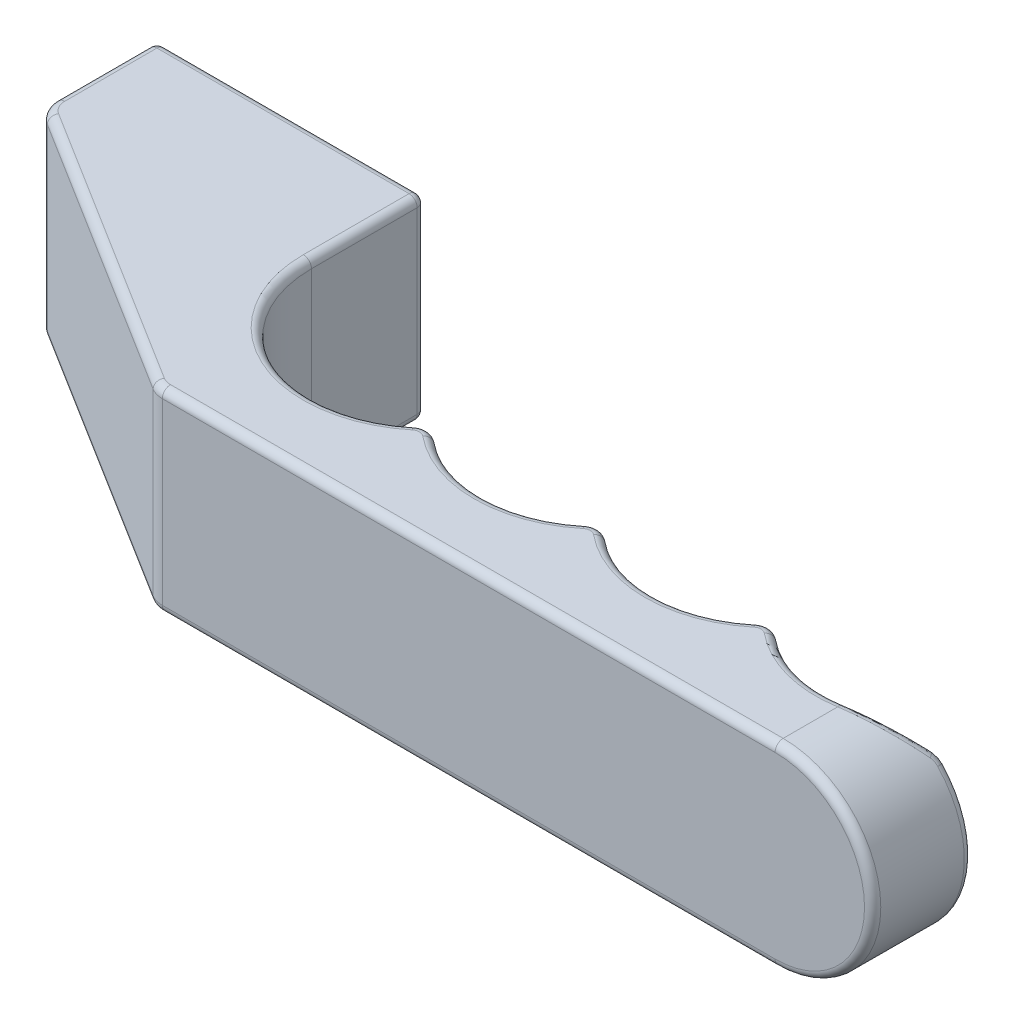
ISO-10303-21;
HEADER;
FILE_DESCRIPTION(('STEP AP214'),'2;1');
FILE_NAME('part.step','',(''),(''),'','','');
FILE_SCHEMA(('AUTOMOTIVE_DESIGN { 1 0 10303 214 1 1 1 1 }'));
ENDSEC;
DATA;
#1=APPLICATION_CONTEXT('core data for automotive mechanical design processes');
#2=APPLICATION_PROTOCOL_DEFINITION('international standard','automotive_design',2000,#1);
#3=PRODUCT_CONTEXT('',#1,'mechanical');
#4=PRODUCT('Part','Part','',(#3));
#5=PRODUCT_RELATED_PRODUCT_CATEGORY('part','',(#4));
#6=PRODUCT_DEFINITION_FORMATION('','',#4);
#7=PRODUCT_DEFINITION_CONTEXT('part definition',#1,'design');
#8=PRODUCT_DEFINITION('design','',#6,#7);
#9=PRODUCT_DEFINITION_SHAPE('','',#8);
#10=(LENGTH_UNIT() NAMED_UNIT(*) SI_UNIT(.MILLI.,.METRE.));
#11=(NAMED_UNIT(*) PLANE_ANGLE_UNIT() SI_UNIT($,.RADIAN.));
#12=(NAMED_UNIT(*) SI_UNIT($,.STERADIAN.) SOLID_ANGLE_UNIT());
#13=UNCERTAINTY_MEASURE_WITH_UNIT(LENGTH_MEASURE(1.E-05),#10,'distance_accuracy_value','');
#14=(GEOMETRIC_REPRESENTATION_CONTEXT(3) GLOBAL_UNCERTAINTY_ASSIGNED_CONTEXT((#13)) GLOBAL_UNIT_ASSIGNED_CONTEXT((#10,
#11,#12)) REPRESENTATION_CONTEXT('',''));
#15=CARTESIAN_POINT('',(0.,0.,0.));
#16=DIRECTION('',(0.,0.,1.));
#17=DIRECTION('',(1.,0.,0.));
#18=AXIS2_PLACEMENT_3D('',#15,#16,#17);
#19=CARTESIAN_POINT('',(-11.,-12.,0.));
#20=DIRECTION('',(0.,0.,1.));
#21=DIRECTION('',(-1.,0.,0.));
#22=AXIS2_PLACEMENT_3D('',#19,#20,#21);
#23=PLANE('',#22);
#24=CARTESIAN_POINT('',(14.,0.,0.));
#25=DIRECTION('',(0.,0.,-1.));
#26=DIRECTION('',(-1.,0.,0.));
#27=AXIS2_PLACEMENT_3D('',#24,#25,#26);
#28=CIRCLE('',#27,2.5);
#29=CARTESIAN_POINT('',(11.5,0.,0.));
#30=VERTEX_POINT('',#29);
#31=EDGE_CURVE('E275',#30,#30,#28,.T.);
#32=ORIENTED_EDGE('',*,*,#31,.F.);
#33=EDGE_LOOP('',(#32));
#34=FACE_BOUND('',#33,.T.);
#35=CARTESIAN_POINT('',(0.,0.,0.));
#36=DIRECTION('',(0.,0.,-1.));
#37=DIRECTION('',(-1.,0.,0.));
#38=AXIS2_PLACEMENT_3D('',#35,#36,#37);
#39=CIRCLE('',#38,2.5);
#40=CARTESIAN_POINT('',(-2.5,0.,0.));
#41=VERTEX_POINT('',#40);
#42=EDGE_CURVE('E267',#41,#41,#39,.T.);
#43=ORIENTED_EDGE('',*,*,#42,.F.);
#44=EDGE_LOOP('',(#43));
#45=FACE_BOUND('',#44,.T.);
#46=DIRECTION('',(0.,1.,0.));
#47=VECTOR('',#46,1.);
#48=CARTESIAN_POINT('',(-10.,11.,0.));
#49=LINE('',#48,#47);
#50=CARTESIAN_POINT('',(-10.,-11.,0.));
#51=VERTEX_POINT('',#50);
#52=CARTESIAN_POINT('',(-10.,11.,0.));
#53=VERTEX_POINT('',#52);
#54=EDGE_CURVE('E729',#51,#53,#49,.T.);
#55=ORIENTED_EDGE('',*,*,#54,.T.);
#56=DIRECTION('',(1.,0.,0.));
#57=VECTOR('',#56,1.);
#58=CARTESIAN_POINT('',(-11.,11.,0.));
#59=LINE('',#58,#57);
#60=CARTESIAN_POINT('',(21.,11.,0.));
#61=VERTEX_POINT('',#60);
#62=EDGE_CURVE('E731',#53,#61,#59,.T.);
#63=ORIENTED_EDGE('',*,*,#62,.T.);
#64=DIRECTION('',(0.,1.,0.));
#65=VECTOR('',#64,1.);
#66=CARTESIAN_POINT('',(21.,-12.,0.));
#67=LINE('',#66,#65);
#68=CARTESIAN_POINT('',(21.,-11.,0.));
#69=VERTEX_POINT('',#68);
#70=EDGE_CURVE('E725',#61,#69,#67,.F.);
#71=ORIENTED_EDGE('',*,*,#70,.T.);
#72=DIRECTION('',(1.,0.,0.));
#73=VECTOR('',#72,1.);
#74=CARTESIAN_POINT('',(-10.,-11.,0.));
#75=LINE('',#74,#73);
#76=EDGE_CURVE('E722',#69,#51,#75,.F.);
#77=ORIENTED_EDGE('',*,*,#76,.T.);
#78=EDGE_LOOP('',(#55,#63,#71,#77));
#79=FACE_BOUND('',#78,.T.);
#80=ADVANCED_FACE('F15',(#34,#45,#79),#23,.F.);
#81=CARTESIAN_POINT('',(99.5,-12.,14.0000000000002));
#82=DIRECTION('',(0.,1.,0.));
#83=DIRECTION('',(-1.,0.,0.));
#84=AXIS2_PLACEMENT_3D('',#81,#82,#83);
#85=CYLINDRICAL_SURFACE('',#84,14.4999999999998);
#86=DIRECTION('',(0.,1.,0.));
#87=VECTOR('',#86,1.);
#88=CARTESIAN_POINT('',(90.2727272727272,-12.,25.1851436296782));
#89=LINE('',#88,#87);
#90=CARTESIAN_POINT('',(90.2727272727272,-11.,25.1851436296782));
#91=VERTEX_POINT('',#90);
#92=CARTESIAN_POINT('',(90.2727272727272,11.,25.1851436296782));
#93=VERTEX_POINT('',#92);
#94=EDGE_CURVE('E302',#91,#93,#89,.T.);
#95=ORIENTED_EDGE('',*,*,#94,.T.);
#96=CARTESIAN_POINT('',(99.5,11.,14.0000000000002));
#97=DIRECTION('',(0.,-1.,0.));
#98=DIRECTION('',(1.,0.,0.));
#99=AXIS2_PLACEMENT_3D('',#96,#97,#98);
#100=CIRCLE('',#99,14.4999999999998);
#101=CARTESIAN_POINT('',(101.838709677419,11.,28.3101515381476));
#102=VERTEX_POINT('',#101);
#103=EDGE_CURVE('E870',#93,#102,#100,.F.);
#104=ORIENTED_EDGE('',*,*,#103,.T.);
#105=CARTESIAN_POINT('',(98.6094230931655,11.5110376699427,29.4880696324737));
#106=CARTESIAN_POINT('',(98.6244927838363,11.5154764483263,29.0709016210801));
#107=CARTESIAN_POINT('',(98.7189561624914,11.2338694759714,28.7775585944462));
#108=CARTESIAN_POINT('',(98.8134195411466,10.9522625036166,28.4842155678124));
#109=CARTESIAN_POINT('',(98.9311988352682,10.5517845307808,28.4888393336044));
#110=CARTESIAN_POINT('',(98.8856268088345,11.5924519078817,29.4980615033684));
#111=CARTESIAN_POINT('',(98.894411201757,11.5946571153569,29.0822737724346));
#112=CARTESIAN_POINT('',(98.977377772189,11.3114158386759,28.7890767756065));
#113=CARTESIAN_POINT('',(99.0600278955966,11.0281119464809,28.4958860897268));
#114=CARTESIAN_POINT('',(99.1680509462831,10.6264142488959,28.498186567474));
#115=CARTESIAN_POINT('',(99.1650580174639,11.6638973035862,29.5018487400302));
#116=CARTESIAN_POINT('',(99.167509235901,11.6643316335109,29.0872656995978));
#117=CARTESIAN_POINT('',(99.2386733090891,11.3795925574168,28.7942672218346));
#118=CARTESIAN_POINT('',(99.3096528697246,11.0948206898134,28.5012750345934));
#119=CARTESIAN_POINT('',(99.4076707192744,10.6919058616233,28.5017294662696));
#120=CARTESIAN_POINT('',(99.7281511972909,11.786490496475,29.4965122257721));
#121=CARTESIAN_POINT('',(99.7173918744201,11.7842468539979,29.0839924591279));
#122=CARTESIAN_POINT('',(99.7649833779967,11.4969143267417,28.7914995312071));
#123=CARTESIAN_POINT('',(99.8124002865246,11.2095345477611,28.4990022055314));
#124=CARTESIAN_POINT('',(99.8905382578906,10.8042829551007,28.4967372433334));
#125=CARTESIAN_POINT('',(100.011812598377,11.837641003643,29.487390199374));
#126=CARTESIAN_POINT('',(99.9943046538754,11.8345320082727,29.0757373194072));
#127=CARTESIAN_POINT('',(100.029997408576,11.5460619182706,28.7835431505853));
#128=CARTESIAN_POINT('',(100.065639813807,11.2575822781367,28.4913505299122));
#129=CARTESIAN_POINT('',(100.13378553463,10.8511709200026,28.4882037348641));
#130=CARTESIAN_POINT('',(100.579858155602,11.9191115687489,29.4558119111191));
#131=CARTESIAN_POINT('',(100.548493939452,11.9152088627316,29.0455480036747));
#132=CARTESIAN_POINT('',(100.560516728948,11.6248654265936,28.7540625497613));
#133=CARTESIAN_POINT('',(100.572485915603,11.3345160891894,28.4625813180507));
#134=CARTESIAN_POINT('',(100.620899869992,10.9258522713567,28.4586627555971));
#135=CARTESIAN_POINT('',(100.864232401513,11.9495298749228,29.4334194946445));
#136=CARTESIAN_POINT('',(100.825897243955,11.9457178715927,29.0236746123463));
#137=CARTESIAN_POINT('',(100.826013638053,11.6546132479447,28.7326032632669));
#138=CARTESIAN_POINT('',(100.826208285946,11.3635149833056,28.4415238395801));
#139=CARTESIAN_POINT('',(100.864758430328,10.9537357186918,28.4377150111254));
#140=CARTESIAN_POINT('',(101.432794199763,11.9899747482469,29.3752429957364));
#141=CARTESIAN_POINT('',(101.380279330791,11.9873243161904,28.9662189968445));
#142=CARTESIAN_POINT('',(101.356701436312,11.6950620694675,28.6760736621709));
#143=CARTESIAN_POINT('',(101.333202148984,11.4028054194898,28.3859196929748));
#144=CARTESIAN_POINT('',(101.352315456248,10.9908101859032,28.383291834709));
#145=CARTESIAN_POINT('',(101.716981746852,12.0000007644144,29.3394585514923));
#146=CARTESIAN_POINT('',(101.657394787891,11.9984257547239,28.9306181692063));
#147=CARTESIAN_POINT('',(101.621892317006,11.7057625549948,28.6410029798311));
#148=CARTESIAN_POINT('',(101.586598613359,11.4131006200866,28.3513549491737));
#149=CARTESIAN_POINT('',(101.596013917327,11.0000007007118,28.3498160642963));
#150=CARTESIAN_POINT('',(102.312594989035,11.9999991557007,29.2502275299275));
#151=CARTESIAN_POINT('',(102.238062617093,12.0017402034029,28.8414538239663));
#152=CARTESIAN_POINT('',(102.177604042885,11.7085914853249,28.5530492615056));
#153=CARTESIAN_POINT('',(102.117398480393,11.4154438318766,28.2646044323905));
#154=CARTESIAN_POINT('',(102.106768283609,10.9999992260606,28.2663418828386));
#155=CARTESIAN_POINT('',(102.62376352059,11.9877663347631,29.1953259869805));
#156=CARTESIAN_POINT('',(102.541496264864,11.9918392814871,28.7863653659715));
#157=CARTESIAN_POINT('',(102.46787577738,11.6986622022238,28.4986877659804));
#158=CARTESIAN_POINT('',(102.394675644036,11.4054541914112,28.2109189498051));
#159=CARTESIAN_POINT('',(102.373603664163,10.9887858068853,28.214982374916));
#160=CARTESIAN_POINT('',(103.240636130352,11.9397077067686,29.0699821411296));
#161=CARTESIAN_POINT('',(103.142988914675,11.9496569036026,28.6603089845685));
#162=CARTESIAN_POINT('',(103.043282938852,11.6567993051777,28.3741685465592));
#163=CARTESIAN_POINT('',(102.943998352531,11.3639113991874,28.0879371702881));
#164=CARTESIAN_POINT('',(102.902588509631,10.9447320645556,28.0977252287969));
#165=CARTESIAN_POINT('',(103.546337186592,11.9038692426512,28.9995315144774));
#166=CARTESIAN_POINT('',(103.441212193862,11.9173183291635,28.5892725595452));
#167=CARTESIAN_POINT('',(103.32841552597,11.6248538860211,28.3040023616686));
#168=CARTESIAN_POINT('',(103.216193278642,11.3323029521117,28.0185738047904));
#169=CARTESIAN_POINT('',(103.164735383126,10.9118801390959,28.0318198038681));
#170=CARTESIAN_POINT('',(104.149940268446,11.8097878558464,28.8440136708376));
#171=CARTESIAN_POINT('',(104.030144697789,11.8314034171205,28.4322650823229));
#172=CARTESIAN_POINT('',(103.89142710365,11.5400648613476,28.1487993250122));
#173=CARTESIAN_POINT('',(103.753283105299,11.248639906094,27.8651754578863));
#174=CARTESIAN_POINT('',(103.682341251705,10.8256388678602,27.8863353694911));
#175=CARTESIAN_POINT('',(104.447837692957,11.7515320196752,28.7589380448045));
#176=CARTESIAN_POINT('',(104.320998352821,11.7777474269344,28.3462110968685));
#177=CARTESIAN_POINT('',(104.16930181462,11.4872092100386,28.0637539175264));
#178=CARTESIAN_POINT('',(104.018308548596,11.196508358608,27.7810592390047));
#179=CARTESIAN_POINT('',(103.93779630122,10.7722376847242,27.8067484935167));
#180=CARTESIAN_POINT('',(105.033781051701,11.6140806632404,28.5753940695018));
#181=CARTESIAN_POINT('',(104.893329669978,11.6505813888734,28.1604054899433));
#182=CARTESIAN_POINT('',(104.715939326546,11.3619498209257,27.880013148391));
#183=CARTESIAN_POINT('',(104.539262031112,11.0731563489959,27.5993822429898));
#184=CARTESIAN_POINT('',(104.440258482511,10.6462406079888,27.6350460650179));
#185=CARTESIAN_POINT('',(105.321822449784,11.5348756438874,28.4769196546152));
#186=CARTESIAN_POINT('',(105.174929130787,11.5769772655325,28.0605631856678));
#187=CARTESIAN_POINT('',(104.984697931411,11.2895372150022,27.7813116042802));
#188=CARTESIAN_POINT('',(104.795299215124,11.0018451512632,27.5017326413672));
#189=CARTESIAN_POINT('',(104.687261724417,10.5736360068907,27.5429248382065));
#190=CARTESIAN_POINT('',(106.164279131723,11.2695674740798,28.1650336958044));
#191=CARTESIAN_POINT('',(106.000338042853,11.3294670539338,27.7436672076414));
#192=CARTESIAN_POINT('',(105.770956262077,11.0463841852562,27.468353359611));
#193=CARTESIAN_POINT('',(105.544788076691,10.7622966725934,27.1917524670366));
#194=CARTESIAN_POINT('',(105.409690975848,10.3304368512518,27.2511605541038));
#195=CARTESIAN_POINT('',(106.70215301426,11.0549274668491,27.933808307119));
#196=CARTESIAN_POINT('',(106.527837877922,11.1282510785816,27.5082997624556));
#197=CARTESIAN_POINT('',(106.27321809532,10.8489671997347,27.2358947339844));
#198=CARTESIAN_POINT('',(106.022423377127,10.5678500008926,26.9614668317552));
#199=CARTESIAN_POINT('',(105.870932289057,10.1336835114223,27.0348529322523));
#200=CARTESIAN_POINT('',(107.724888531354,10.5616588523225,27.4351723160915));
#201=CARTESIAN_POINT('',(107.532958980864,10.6650853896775,27.0005185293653));
#202=CARTESIAN_POINT('',(107.229175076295,10.3939549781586,26.733616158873));
#203=CARTESIAN_POINT('',(106.929266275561,10.1209928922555,26.4646909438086));
#204=CARTESIAN_POINT('',(106.747955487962,9.68152061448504,26.5683870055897));
#205=CARTESIAN_POINT('',(108.209768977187,10.2830530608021,27.1677746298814));
#206=CARTESIAN_POINT('',(108.011033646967,10.4022769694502,26.727392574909));
#207=CARTESIAN_POINT('',(107.682887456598,10.1363811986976,26.4638095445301));
#208=CARTESIAN_POINT('',(107.358856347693,9.86775888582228,26.1975042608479));
#209=CARTESIAN_POINT('',(107.16375350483,9.42613197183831,26.3182407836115));
#210=CARTESIAN_POINT('',(108.910383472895,9.81490094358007,26.7386577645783));
#211=CARTESIAN_POINT('',(108.702759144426,9.96091358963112,26.2896085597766));
#212=CARTESIAN_POINT('',(108.33953271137,9.7024230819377,26.0298751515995));
#213=CARTESIAN_POINT('',(107.97749569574,9.4431502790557,25.7693572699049));
#214=CARTESIAN_POINT('',(107.764549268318,8.9969925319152,25.9168088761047));
#215=CARTESIAN_POINT('',(109.145981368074,9.64459959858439,26.5859662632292));
#216=CARTESIAN_POINT('',(108.936417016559,9.79967153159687,26.13325675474));
#217=CARTESIAN_POINT('',(108.56055420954,9.54436702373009,25.8753012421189));
#218=CARTESIAN_POINT('',(108.185882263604,9.28814493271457,25.6164683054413));
#219=CARTESIAN_POINT('',(107.966580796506,8.84088296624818,25.7739684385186));
#220=CARTESIAN_POINT('',(109.487526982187,9.37857865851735,26.3527540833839));
#221=CARTESIAN_POINT('',(109.275540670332,9.54777853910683,25.8945194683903));
#222=CARTESIAN_POINT('',(108.881335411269,9.29710492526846,25.6388990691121));
#223=CARTESIAN_POINT('',(108.487427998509,9.04620155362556,25.3830590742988));
#224=CARTESIAN_POINT('',(108.259465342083,8.59703043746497,25.5558022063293));
#225=CARTESIAN_POINT('',(109.599359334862,9.28818054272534,26.2743520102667));
#226=CARTESIAN_POINT('',(109.386883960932,9.46197620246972,25.8140870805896));
#227=CARTESIAN_POINT('',(108.98643205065,9.21302238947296,25.5593731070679));
#228=CARTESIAN_POINT('',(108.586277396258,8.96382164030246,25.304428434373));
#229=CARTESIAN_POINT('',(108.355364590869,8.51416549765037,25.4824583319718));
#230=CARTESIAN_POINT('',(109.819129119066,9.10394314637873,26.1163183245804));
#231=CARTESIAN_POINT('',(109.606006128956,9.28694769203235,25.6518467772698));
#232=CARTESIAN_POINT('',(109.193101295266,9.0415214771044,25.3989580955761));
#233=CARTESIAN_POINT('',(108.780495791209,8.79584713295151,25.1458370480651));
#234=CARTESIAN_POINT('',(108.543823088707,8.34528121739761,25.3346203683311));
#235=CARTESIAN_POINT('',(109.927065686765,9.01010311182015,26.0366864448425));
#236=CARTESIAN_POINT('',(109.713783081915,9.19770351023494,25.5700277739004));
#237=CARTESIAN_POINT('',(109.294673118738,8.95410236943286,25.3180687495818));
#238=CARTESIAN_POINT('',(108.875862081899,8.71023547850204,25.0658655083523));
#239=CARTESIAN_POINT('',(108.636381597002,8.25926118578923,25.2601260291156));
#240=CARTESIAN_POINT('',(110.355876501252,8.62370236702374,25.7124103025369));
#241=CARTESIAN_POINT('',(110.143943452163,8.82874667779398,25.2355708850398));
#242=CARTESIAN_POINT('',(109.698499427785,8.59383744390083,24.9884120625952));
#243=CARTESIAN_POINT('',(109.255825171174,8.35645437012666,24.7389927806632));
#244=CARTESIAN_POINT('',(109.004098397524,7.9050605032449,24.9567709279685));
#245=CARTESIAN_POINT('',(110.660658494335,8.31732590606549,25.4634481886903));
#246=CARTESIAN_POINT('',(110.450279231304,8.5359631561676,24.978801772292));
#247=CARTESIAN_POINT('',(109.986227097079,8.3075006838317,24.7347270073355));
#248=CARTESIAN_POINT('',(109.524851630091,8.076072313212,24.488120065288));
#249=CARTESIAN_POINT('',(109.265457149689,7.62421541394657,24.7238708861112));
#250=CARTESIAN_POINT('',(111.234235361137,7.67557171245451,24.9616192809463));
#251=CARTESIAN_POINT('',(111.030438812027,7.92053435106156,24.4596742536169));
#252=CARTESIAN_POINT('',(110.52945720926,7.70557965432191,24.2216522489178));
#253=CARTESIAN_POINT('',(110.031183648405,7.4876243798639,23.9810766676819));
#254=CARTESIAN_POINT('',(109.75731473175,7.03594073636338,24.2544180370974));
#255=CARTESIAN_POINT('',(111.503003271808,7.34017255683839,24.708749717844));
#256=CARTESIAN_POINT('',(111.304089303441,7.59737968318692,24.1970973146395));
#257=CARTESIAN_POINT('',(110.784935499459,7.38997376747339,23.962258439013));
#258=CARTESIAN_POINT('',(110.26830190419,7.17908081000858,23.7246942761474));
#259=CARTESIAN_POINT('',(109.987790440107,6.72849151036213,24.0178626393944));
#260=CARTESIAN_POINT('',(111.879709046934,6.81455368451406,24.3309753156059));
#261=CARTESIAN_POINT('',(111.689976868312,7.08959232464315,23.8039762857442));
#262=CARTESIAN_POINT('',(111.144745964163,6.89278173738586,23.5728174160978));
#263=CARTESIAN_POINT('',(110.600162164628,6.69507929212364,23.3409569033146));
#264=CARTESIAN_POINT('',(110.310825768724,6.24667421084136,23.6644607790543));
#265=CARTESIAN_POINT('',(112.001232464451,6.63495360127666,24.2048853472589));
#266=CARTESIAN_POINT('',(111.815352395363,6.91510140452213,23.6720792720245));
#267=CARTESIAN_POINT('',(111.261132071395,6.72247577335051,23.4425078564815));
#268=CARTESIAN_POINT('',(110.707525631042,6.52889735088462,23.2122270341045));
#269=CARTESIAN_POINT('',(110.415035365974,6.0820408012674,23.5465056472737));
#270=CARTESIAN_POINT('',(112.235000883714,6.26833512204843,23.9545572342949));
#271=CARTESIAN_POINT('',(112.057796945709,6.55767457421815,23.4094045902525));
#272=CARTESIAN_POINT('',(111.485713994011,6.37371092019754,23.183003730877));
#273=CARTESIAN_POINT('',(110.914247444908,6.18878947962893,22.9558906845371));
#274=CARTESIAN_POINT('',(110.615498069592,5.74597386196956,23.3123277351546));
#275=CARTESIAN_POINT('',(112.347246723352,6.08131739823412,23.8303189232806));
#276=CARTESIAN_POINT('',(112.174830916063,6.37467825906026,23.2786222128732));
#277=CARTESIAN_POINT('',(111.593910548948,6.19525276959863,23.0538090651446));
#278=CARTESIAN_POINT('',(111.013570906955,6.0148076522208,22.8282797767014));
#279=CARTESIAN_POINT('',(110.711751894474,5.57454094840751,23.1961047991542));
#280=CARTESIAN_POINT('',(112.562266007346,5.69969602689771,23.5849722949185));
#281=CARTESIAN_POINT('',(112.400411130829,5.99968578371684,23.0193574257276));
#282=CARTESIAN_POINT('',(111.801973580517,5.82965835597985,22.7976978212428));
#283=CARTESIAN_POINT('',(111.204116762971,5.6586097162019,22.5753246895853));
#284=CARTESIAN_POINT('',(110.896136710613,5.22472135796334,22.9665869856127));
#285=CARTESIAN_POINT('',(112.665044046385,5.50509612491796,23.4638624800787));
#286=CARTESIAN_POINT('',(112.508918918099,5.80763522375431,22.8908810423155));
#287=CARTESIAN_POINT('',(111.90184409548,5.64252636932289,22.67078016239));
#288=CARTESIAN_POINT('',(111.29530190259,5.47634354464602,22.4499865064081));
#289=CARTESIAN_POINT('',(110.984271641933,5.04633811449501,22.8532907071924));
#290=CARTESIAN_POINT('',(112.860933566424,5.10773986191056,23.2262671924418));
#291=CARTESIAN_POINT('',(112.717247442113,5.41338660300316,22.6376013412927));
#292=CARTESIAN_POINT('',(112.093099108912,5.25849892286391,22.4206109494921));
#293=CARTESIAN_POINT('',(111.469495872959,5.10252123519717,22.2029036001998));
#294=CARTESIAN_POINT('',(111.152252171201,4.68209487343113,22.6310241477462));
#295=CARTESIAN_POINT('',(112.954041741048,4.90498074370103,23.1097833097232));
#296=CARTESIAN_POINT('',(112.817012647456,5.21113380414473,22.5128241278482));
#297=CARTESIAN_POINT('',(112.184480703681,5.06160015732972,22.2973606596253));
#298=CARTESIAN_POINT('',(111.552452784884,4.91091518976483,22.0811844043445));
#299=CARTESIAN_POINT('',(111.232094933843,4.49623234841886,22.5220553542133));
#300=CARTESIAN_POINT('',(113.042151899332,4.69796566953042,22.9964330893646));
#301=CARTESIAN_POINT('',(112.911970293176,5.00394599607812,22.391042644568));
#302=CARTESIAN_POINT('',(112.271476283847,4.85937894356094,22.1767144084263));
#303=CARTESIAN_POINT('',(111.630982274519,4.71481189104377,21.9623861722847));
#304=CARTESIAN_POINT('',(111.307651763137,4.30646853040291,22.416018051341));
#305=(BOUNDED_SURFACE() B_SPLINE_SURFACE(3,2,((#105,#106,#107,#108,#109),(#110,#111,#112,#113,
#114),(#115,#116,#117,#118,#119),(#120,#121,#122,#123,#124),(#125,#126,#127,#128,#129),(#130,
#131,#132,#133,#134),(#135,#136,#137,#138,#139),(#140,#141,#142,#143,#144),(#145,#146,#147,#148,
#149),(#150,#151,#152,#153,#154),(#155,#156,#157,#158,#159),(#160,#161,#162,#163,#164),(#165,
#166,#167,#168,#169),(#170,#171,#172,#173,#174),(#175,#176,#177,#178,#179),(#180,#181,#182,#183,
#184),(#185,#186,#187,#188,#189),(#190,#191,#192,#193,#194),(#195,#196,#197,#198,#199),(#200,
#201,#202,#203,#204),(#205,#206,#207,#208,#209),(#210,#211,#212,#213,#214),(#215,#216,#217,#218,
#219),(#220,#221,#222,#223,#224),(#225,#226,#227,#228,#229),(#230,#231,#232,#233,#234),(#235,
#236,#237,#238,#239),(#240,#241,#242,#243,#244),(#245,#246,#247,#248,#249),(#250,#251,#252,#253,
#254),(#255,#256,#257,#258,#259),(#260,#261,#262,#263,#264),(#265,#266,#267,#268,#269),(#270,
#271,#272,#273,#274),(#275,#276,#277,#278,#279),(#280,#281,#282,#283,#284),(#285,#286,#287,#288,
#289),(#290,#291,#292,#293,#294),(#295,#296,#297,#298,#299),(#300,#301,#302,#303,#304)),
.UNSPECIFIED.,.F.,.F.,.F.) B_SPLINE_SURFACE_WITH_KNOTS((4,2,2,2,2,2,2,2,2,2,2,2,2,2,2,2,2,2,2,
4),(3,2,3),(0.,0.792222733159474,1.5843396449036,2.372676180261,3.16103401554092,
4.03177894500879,4.90299113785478,5.77470594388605,6.64681669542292,8.37637424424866,
10.1053158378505,11.0260857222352,11.486114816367,11.946245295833,13.3476573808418,
14.7501128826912,15.4560908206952,16.1620049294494,16.8675746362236,17.5733848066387),(0.,0.5,
1.),.UNSPECIFIED.) GEOMETRIC_REPRESENTATION_ITEM() RATIONAL_B_SPLINE_SURFACE(((1.,
0.922815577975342,1.,0.922815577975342,1.),(1.,0.923347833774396,1.,0.923347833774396,1.),(1.,
0.923773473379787,1.,0.923773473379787,1.),(1.,0.924403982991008,1.,0.924403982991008,1.),(1.,
0.924608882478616,1.,0.924608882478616,1.),(1.,0.924790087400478,1.,0.924790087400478,1.),(1.,
0.924767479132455,1.,0.924767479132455,1.),(1.,0.924494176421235,1.,0.924494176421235,1.),(1.,
0.924243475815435,1.,0.924243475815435,1.),(1.,0.923477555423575,1.,0.923477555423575,1.),(1.,
0.922937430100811,1.,0.922937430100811,1.),(1.,0.921588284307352,1.,0.921588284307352,1.),(1.,
0.920779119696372,1.,0.920779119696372,1.),(1.,0.918903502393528,1.,0.918903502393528,1.),(1.,
0.917836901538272,1.,0.917836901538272,1.),(1.,0.91546191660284,1.,0.91546191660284,1.),(1.,
0.914153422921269,1.,0.914153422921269,1.),(1.,0.909912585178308,1.,0.909912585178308,1.),(1.,
0.906648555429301,1.,0.906648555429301,1.),(1.,0.899375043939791,1.,0.899375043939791,1.),(1.,
0.89536582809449,1.,0.89536582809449,1.),(1.,0.888749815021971,1.,0.888749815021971,1.),(1.,
0.88636347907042,1.,0.88636347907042,1.),(1.,0.882666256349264,1.,0.882666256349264,1.),(1.,
0.881414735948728,1.,0.881414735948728,1.),(1.,0.878874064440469,1.,0.878874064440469,1.),(1.,
0.877584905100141,1.,0.877584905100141,1.),(1.,0.872297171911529,1.,0.872297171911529,1.),(1.,
0.868150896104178,1.,0.868150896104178,1.),(1.,0.859588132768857,1.,0.859588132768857,1.),(1.,
0.855171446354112,1.,0.855171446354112,1.),(1.,0.848390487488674,1.,0.848390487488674,1.),(1.,
0.846096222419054,1.,0.846096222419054,1.),(1.,0.841473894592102,1.,0.841473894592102,1.),(1.,
0.83914583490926,1.,0.83914583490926,1.),(1.,0.834474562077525,1.,0.834474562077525,1.),(1.,
0.83213135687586,1.,0.83213135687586,1.),(1.,0.827455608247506,1.,0.827455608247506,1.),(1.,
0.825123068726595,1.,0.825123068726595,1.),(1.,0.822810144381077,1.,0.822810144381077,1.))) REPRESENTATION_ITEM('') SURFACE());
#306=CARTESIAN_POINT('',(98.9311988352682,10.5517845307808,28.4888393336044));
#307=CARTESIAN_POINT('',(99.1680509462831,10.6264142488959,28.498186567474));
#308=CARTESIAN_POINT('',(99.4076707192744,10.6919058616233,28.5017294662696));
#309=CARTESIAN_POINT('',(99.8905382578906,10.8042829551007,28.4967372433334));
#310=CARTESIAN_POINT('',(100.13378553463,10.8511709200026,28.4882037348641));
#311=CARTESIAN_POINT('',(100.620899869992,10.9258522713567,28.4586627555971));
#312=CARTESIAN_POINT('',(100.864758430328,10.9537357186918,28.4377150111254));
#313=CARTESIAN_POINT('',(101.352315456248,10.9908101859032,28.383291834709));
#314=CARTESIAN_POINT('',(101.596013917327,11.0000007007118,28.3498160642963));
#315=CARTESIAN_POINT('',(102.106768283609,10.9999992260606,28.2663418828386));
#316=CARTESIAN_POINT('',(102.373603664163,10.9887858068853,28.214982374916));
#317=CARTESIAN_POINT('',(102.902588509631,10.9447320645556,28.0977252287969));
#318=CARTESIAN_POINT('',(103.164735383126,10.9118801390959,28.0318198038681));
#319=CARTESIAN_POINT('',(103.682341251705,10.8256388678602,27.8863353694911));
#320=CARTESIAN_POINT('',(103.93779630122,10.7722376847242,27.8067484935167));
#321=CARTESIAN_POINT('',(104.440258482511,10.6462406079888,27.6350460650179));
#322=CARTESIAN_POINT('',(104.687261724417,10.5736360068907,27.5429248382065));
#323=CARTESIAN_POINT('',(105.409690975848,10.3304368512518,27.2511605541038));
#324=CARTESIAN_POINT('',(105.870932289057,10.1336835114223,27.0348529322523));
#325=CARTESIAN_POINT('',(106.747955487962,9.68152061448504,26.5683870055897));
#326=CARTESIAN_POINT('',(107.16375350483,9.42613197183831,26.3182407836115));
#327=CARTESIAN_POINT('',(107.764549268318,8.9969925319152,25.9168088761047));
#328=CARTESIAN_POINT('',(107.966580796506,8.84088296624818,25.7739684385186));
#329=CARTESIAN_POINT('',(108.259465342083,8.59703043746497,25.5558022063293));
#330=CARTESIAN_POINT('',(108.355364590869,8.51416549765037,25.4824583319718));
#331=CARTESIAN_POINT('',(108.543823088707,8.34528121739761,25.3346203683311));
#332=CARTESIAN_POINT('',(108.636381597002,8.25926118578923,25.2601260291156));
#333=CARTESIAN_POINT('',(109.004098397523,7.9050605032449,24.9567709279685));
#334=CARTESIAN_POINT('',(109.265457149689,7.62421541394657,24.7238708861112));
#335=CARTESIAN_POINT('',(109.75731473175,7.03594073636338,24.2544180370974));
#336=CARTESIAN_POINT('',(109.987790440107,6.72849151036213,24.0178626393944));
#337=CARTESIAN_POINT('',(110.310825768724,6.24667421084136,23.6644607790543));
#338=CARTESIAN_POINT('',(110.415035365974,6.0820408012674,23.5465056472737));
#339=CARTESIAN_POINT('',(110.615498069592,5.74597386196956,23.3123277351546));
#340=CARTESIAN_POINT('',(110.711751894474,5.57454094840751,23.1961047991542));
#341=CARTESIAN_POINT('',(110.896136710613,5.22472135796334,22.9665869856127));
#342=CARTESIAN_POINT('',(110.984271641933,5.04633811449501,22.8532907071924));
#343=CARTESIAN_POINT('',(111.152252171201,4.68209487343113,22.6310241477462));
#344=CARTESIAN_POINT('',(111.232094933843,4.49623234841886,22.5220553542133));
#345=CARTESIAN_POINT('',(111.307651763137,4.30646853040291,22.416018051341));
#346=B_SPLINE_CURVE_WITH_KNOTS('',3,(#306,#307,#308,#309,#310,#311,#312,#313,#314,#315,#316,
#317,#318,#319,#320,#321,#322,#323,#324,#325,#326,#327,#328,#329,#330,#331,#332,#333,#334,#335,
#336,#337,#338,#339,#340,#341,#342,#343,#344,#345),.UNSPECIFIED.,.F.,.F.,(4,2,2,2,2,2,2,2,2,2,2,
2,2,2,2,2,2,2,2,4),(0.,0.792222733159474,1.5843396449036,2.372676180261,3.16103401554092,
4.03177894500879,4.90299113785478,5.77470594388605,6.64681669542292,8.37637424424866,
10.1053158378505,11.0260857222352,11.486114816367,11.946245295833,13.3476573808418,
14.7501128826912,15.4560908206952,16.1620049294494,16.8675746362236,17.5733848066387),.UNSPECIFIED.);
#347=CARTESIAN_POINT('',(108.727272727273,8.17171092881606,25.1851436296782));
#348=VERTEX_POINT('',#347);
#349=EDGE_CURVE('E454',#102,#348,#346,.T.);
#350=ORIENTED_EDGE('',*,*,#349,.T.);
#351=DIRECTION('',(0.,1.,0.));
#352=VECTOR('',#351,1.);
#353=CARTESIAN_POINT('',(108.727272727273,-12.,25.1851436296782));
#354=LINE('',#353,#352);
#355=CARTESIAN_POINT('',(108.727272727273,-8.17171092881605,25.1851436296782));
#356=VERTEX_POINT('',#355);
#357=EDGE_CURVE('E299',#356,#348,#354,.T.);
#358=ORIENTED_EDGE('',*,*,#357,.F.);
#359=CARTESIAN_POINT('',(113.042151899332,-4.69796566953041,22.9964330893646));
#360=CARTESIAN_POINT('',(112.911970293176,-5.00394599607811,22.391042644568));
#361=CARTESIAN_POINT('',(112.271476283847,-4.85937894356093,22.1767144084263));
#362=CARTESIAN_POINT('',(111.630982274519,-4.71481189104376,21.9623861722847));
#363=CARTESIAN_POINT('',(111.307651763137,-4.3064685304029,22.416018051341));
#364=CARTESIAN_POINT('',(112.954599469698,-4.9036716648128,23.1090651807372));
#365=CARTESIAN_POINT('',(112.817612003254,-5.20982795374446,22.512055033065));
#366=CARTESIAN_POINT('',(112.18503144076,-5.06032190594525,22.2965962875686));
#367=CARTESIAN_POINT('',(111.55294834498,-4.90967921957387,22.0804341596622));
#368=CARTESIAN_POINT('',(111.232573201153,-4.49503235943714,22.5213835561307));
#369=CARTESIAN_POINT('',(112.862111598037,-5.1051747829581,23.2247928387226));
#370=CARTESIAN_POINT('',(112.718506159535,-5.41083554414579,22.6360266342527));
#371=CARTESIAN_POINT('',(112.094255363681,-5.25600829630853,22.419050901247));
#372=CARTESIAN_POINT('',(111.47054243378,-5.10010448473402,22.2013674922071));
#373=CARTESIAN_POINT('',(111.153262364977,-4.67974355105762,22.6296449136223));
#374=CARTESIAN_POINT('',(112.667583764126,-5.50011717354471,23.4608263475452));
#375=CARTESIAN_POINT('',(112.511606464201,-5.80271507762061,22.8876566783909));
#376=CARTESIAN_POINT('',(111.904317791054,-5.63772608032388,22.6675908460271));
#377=CARTESIAN_POINT('',(111.2975548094,-5.47167624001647,22.4468409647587));
#378=CARTESIAN_POINT('',(110.986449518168,-5.04177407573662,22.8504504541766));
#379=CARTESIAN_POINT('',(112.565547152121,-5.69355924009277,23.581130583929));
#380=CARTESIAN_POINT('',(112.403867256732,-5.99364077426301,23.0152893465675));
#381=CARTESIAN_POINT('',(111.80515923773,-5.82376082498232,22.7936748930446));
#382=CARTESIAN_POINT('',(111.207024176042,-5.65287173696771,22.5713559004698));
#383=CARTESIAN_POINT('',(110.898950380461,-5.21909597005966,22.9629931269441));
#384=CARTESIAN_POINT('',(112.352172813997,-6.07287570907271,23.8247923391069));
#385=CARTESIAN_POINT('',(112.179977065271,-6.36640993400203,23.2727995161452));
#386=CARTESIAN_POINT('',(111.598666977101,-6.18718322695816,23.0480522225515));
#387=CARTESIAN_POINT('',(111.017929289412,-6.0069498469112,22.8225985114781));
#388=CARTESIAN_POINT('',(110.715976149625,-5.56680273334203,23.1909347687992));
#389=CARTESIAN_POINT('',(112.240834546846,-6.25874967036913,23.9481500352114));
#390=CARTESIAN_POINT('',(112.063867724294,-6.54831008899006,23.4026696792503));
#391=CARTESIAN_POINT('',(111.491332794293,-6.36457038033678,23.1763456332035));
#392=CARTESIAN_POINT('',(110.91940527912,-6.17988459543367,22.9493189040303));
#393=CARTESIAN_POINT('',(110.620500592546,-5.7371871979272,23.3063339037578));
#394=CARTESIAN_POINT('',(112.00900390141,-6.62317731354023,24.1967146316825));
#395=CARTESIAN_POINT('',(111.823383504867,-6.90365025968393,23.6635258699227));
#396=CARTESIAN_POINT('',(111.268584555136,-6.71129357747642,23.4340527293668));
#397=CARTESIAN_POINT('',(110.714390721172,-6.51799557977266,23.2038794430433));
#398=CARTESIAN_POINT('',(110.421699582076,-6.07124587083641,23.538862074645));
#399=CARTESIAN_POINT('',(111.888510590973,-6.80173024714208,24.3219217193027));
#400=CARTESIAN_POINT('',(111.699042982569,-7.07714935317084,23.7945163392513));
#401=CARTESIAN_POINT('',(111.153169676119,-6.88062879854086,23.5634665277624));
#402=CARTESIAN_POINT('',(110.607934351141,-6.68322648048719,23.3317237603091));
#403=CARTESIAN_POINT('',(110.318373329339,-6.23491939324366,23.6559912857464));
#404=CARTESIAN_POINT('',(111.511786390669,-7.32894886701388,24.7003719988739));
#405=CARTESIAN_POINT('',(111.31306611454,-7.58653467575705,24.1883734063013));
#406=CARTESIAN_POINT('',(110.793292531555,-7.37940131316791,23.9536557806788));
#407=CARTESIAN_POINT('',(110.276068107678,-7.16873004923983,23.7161767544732));
#408=CARTESIAN_POINT('',(109.995322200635,-6.71820312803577,24.010025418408));
#409=CARTESIAN_POINT('',(111.241667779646,-7.66676996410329,24.9548692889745));
#410=CARTESIAN_POINT('',(111.038000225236,-7.91205489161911,24.4526620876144));
#411=CARTESIAN_POINT('',(110.536509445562,-7.69730956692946,24.2147388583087));
#412=CARTESIAN_POINT('',(110.037759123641,-7.47952284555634,23.9742288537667));
#413=CARTESIAN_POINT('',(109.76368823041,-7.02787246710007,24.2481035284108));
#414=CARTESIAN_POINT('',(110.664836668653,-8.31312673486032,25.460035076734));
#415=CARTESIAN_POINT('',(110.454498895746,-8.53193104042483,24.9752648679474));
#416=CARTESIAN_POINT('',(109.990171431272,-8.30357635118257,24.7312492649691));
#417=CARTESIAN_POINT('',(109.528557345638,-8.07221097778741,24.484664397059));
#418=CARTESIAN_POINT('',(109.269040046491,-7.62036617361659,24.7206779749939));
#419=CARTESIAN_POINT('',(110.358133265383,-8.62166965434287,25.710704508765));
#420=CARTESIAN_POINT('',(110.146221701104,-8.82679355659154,25.2338004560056));
#421=CARTESIAN_POINT('',(109.700624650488,-8.591942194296,24.9866779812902));
#422=CARTESIAN_POINT('',(109.257837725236,-8.35458156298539,24.7372624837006));
#423=CARTESIAN_POINT('',(109.006033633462,-7.90319718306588,24.9551751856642));
#424=CARTESIAN_POINT('',(109.792662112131,-9.13121332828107,26.1383247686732));
#425=CARTESIAN_POINT('',(109.580021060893,-9.31243305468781,25.6740292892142));
#426=CARTESIAN_POINT('',(109.168100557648,-9.06702081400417,25.4213934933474));
#427=CARTESIAN_POINT('',(108.757709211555,-8.82024604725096,25.1675086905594));
#428=CARTESIAN_POINT('',(108.521126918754,-8.3702788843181,25.3552070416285));
#429=CARTESIAN_POINT('',(109.542219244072,-9.33929142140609,26.3174692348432));
#430=CARTESIAN_POINT('',(109.330427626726,-9.51012684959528,25.857949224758));
#431=CARTESIAN_POINT('',(108.932639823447,-9.26064600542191,25.6031822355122));
#432=CARTESIAN_POINT('',(108.536389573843,-9.01000423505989,25.3472983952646));
#433=CARTESIAN_POINT('',(108.306365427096,-8.56101713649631,25.5227938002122));
#434=CARTESIAN_POINT('',(109.021219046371,-9.73703592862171,26.6682099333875));
#435=CARTESIAN_POINT('',(108.812756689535,-9.88709203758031,26.2173712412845));
#436=CARTESIAN_POINT('',(108.443466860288,-9.63020194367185,25.958597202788));
#437=CARTESIAN_POINT('',(108.075701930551,-9.3721591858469,25.698714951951));
#438=CARTESIAN_POINT('',(107.85959375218,-8.92561626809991,25.8509060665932));
#439=CARTESIAN_POINT('',(108.750664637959,-9.92670500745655,26.8398072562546));
#440=CARTESIAN_POINT('',(108.544677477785,-10.0665676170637,26.3930097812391));
#441=CARTESIAN_POINT('',(108.189757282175,-9.8061352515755,26.1322246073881));
#442=CARTESIAN_POINT('',(107.836342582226,-9.54474996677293,25.8704747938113));
#443=CARTESIAN_POINT('',(107.627586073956,-9.09947959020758,26.0114325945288));
#444=CARTESIAN_POINT('',(108.190286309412,-10.2854643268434,27.1727820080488));
#445=CARTESIAN_POINT('',(107.990795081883,-10.4052569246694,26.7332598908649));
#446=CARTESIAN_POINT('',(107.664796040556,-10.1384587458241,26.4687368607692));
#447=CARTESIAN_POINT('',(107.340287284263,-9.8707170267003,26.2032581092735));
#448=CARTESIAN_POINT('',(107.147046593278,-9.42834229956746,26.3229251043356));
#449=CARTESIAN_POINT('',(107.900508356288,-10.4546011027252,27.3341821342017));
#450=CARTESIAN_POINT('',(107.704999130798,-10.564713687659,26.8980413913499));
#451=CARTESIAN_POINT('',(107.393586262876,-10.29489314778,26.6316456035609));
#452=CARTESIAN_POINT('',(107.083609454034,-10.0243249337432,26.36444739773));
#453=CARTESIAN_POINT('',(106.898554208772,-9.58338434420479,26.4739123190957));
#454=CARTESIAN_POINT('',(107.301694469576,-10.7706351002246,27.6448324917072));
#455=CARTESIAN_POINT('',(107.115613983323,-10.8619523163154,27.2147002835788));
#456=CARTESIAN_POINT('',(106.833554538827,-10.5867927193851,26.9448627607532));
#457=CARTESIAN_POINT('',(106.552920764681,-10.310889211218,26.6742271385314));
#458=CARTESIAN_POINT('',(106.385055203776,-9.87308217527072,26.7645207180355));
#459=CARTESIAN_POINT('',(106.992662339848,-10.917536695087,27.7940851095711));
#460=CARTESIAN_POINT('',(106.81195116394,-10.9999331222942,27.3667358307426));
#461=CARTESIAN_POINT('',(106.544736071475,-10.7222620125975,27.0951736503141));
#462=CARTESIAN_POINT('',(106.278850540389,-10.4440360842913,26.8229721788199));
#463=CARTESIAN_POINT('',(106.120051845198,-10.007741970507,26.9041441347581));
#464=CARTESIAN_POINT('',(106.416197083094,-11.1613575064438,28.0513607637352));
#465=CARTESIAN_POINT('',(106.246214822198,-11.2284289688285,27.6285043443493));
#466=CARTESIAN_POINT('',(106.00625526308,-10.9467509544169,27.3539989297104));
#467=CARTESIAN_POINT('',(105.767171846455,-10.664708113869,27.0790725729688));
#468=CARTESIAN_POINT('',(105.625717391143,-10.2312443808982,27.1448213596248));
#469=CARTESIAN_POINT('',(106.151853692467,-11.262482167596,28.1618621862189));
#470=CARTESIAN_POINT('',(105.987163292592,-11.3230252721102,27.740825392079));
#471=CARTESIAN_POINT('',(105.759428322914,-11.0397158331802,27.465060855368));
#472=CARTESIAN_POINT('',(105.532496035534,-10.7561369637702,27.1889605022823));
#473=CARTESIAN_POINT('',(105.399035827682,-10.3239419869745,27.2481936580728));
#474=CARTESIAN_POINT('',(105.61208328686,-11.4470154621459,28.3719723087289));
#475=CARTESIAN_POINT('',(105.458788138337,-11.4951989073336,27.9541237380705));
#476=CARTESIAN_POINT('',(105.255573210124,-11.2090703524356,27.6760390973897));
#477=CARTESIAN_POINT('',(105.053156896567,-10.9226730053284,27.3976197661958));
#478=CARTESIAN_POINT('',(104.936168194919,-10.4930975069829,27.4447482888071));
#479=CARTESIAN_POINT('',(105.336658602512,-11.5304277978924,28.4715832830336));
#480=CARTESIAN_POINT('',(105.189380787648,-11.5728722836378,28.0551871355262));
#481=CARTESIAN_POINT('',(104.998547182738,-11.285463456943,27.7759577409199));
#482=CARTESIAN_POINT('',(104.808419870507,-10.997872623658,27.4964753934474));
#483=CARTESIAN_POINT('',(104.699984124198,-10.5695588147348,27.5379327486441));
#484=CARTESIAN_POINT('',(104.776453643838,-11.6779728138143,28.658501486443));
#485=CARTESIAN_POINT('',(104.641914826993,-11.7097689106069,28.2445645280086));
#486=CARTESIAN_POINT('',(104.475859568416,-11.4202459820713,27.9632473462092));
#487=CARTESIAN_POINT('',(104.310506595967,-11.1305418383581,27.6816783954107));
#488=CARTESIAN_POINT('',(104.21959331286,-10.7048084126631,27.7127917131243));
#489=CARTESIAN_POINT('',(104.49169191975,-11.7421414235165,28.7458314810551));
#490=CARTESIAN_POINT('',(104.363767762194,-11.7691081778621,28.3329808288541));
#491=CARTESIAN_POINT('',(104.210215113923,-11.4786689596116,28.0506415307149));
#492=CARTESIAN_POINT('',(104.057252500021,-11.1881231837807,27.7681260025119));
#493=CARTESIAN_POINT('',(103.975402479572,-10.7636296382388,27.7944875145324));
#494=CARTESIAN_POINT('',(103.914042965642,-11.8500076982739,28.9072271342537));
#495=CARTESIAN_POINT('',(103.799945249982,-11.8682442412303,28.4961118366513));
#496=CARTESIAN_POINT('',(103.671387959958,-11.5764156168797,28.2119268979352));
#497=CARTESIAN_POINT('',(103.543418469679,-11.2844798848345,27.9275656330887));
#498=CARTESIAN_POINT('',(103.480052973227,-10.8625070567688,27.9454705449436));
#499=CARTESIAN_POINT('',(103.62115999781,-11.8937158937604,28.9812996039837));
#500=CARTESIAN_POINT('',(103.514146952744,-11.9081188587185,28.5709048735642));
#501=CARTESIAN_POINT('',(103.398209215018,-11.6157491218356,28.2858250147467));
#502=CARTESIAN_POINT('',(103.282727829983,-11.3233303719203,28.000634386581));
#503=CARTESIAN_POINT('',(103.228897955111,-10.9025729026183,28.0147641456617));
#504=CARTESIAN_POINT('',(103.107036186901,-11.9508443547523,29.097641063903));
#505=CARTESIAN_POINT('',(103.012622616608,-11.9594855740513,28.6881504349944));
#506=CARTESIAN_POINT('',(102.918663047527,-11.6665439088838,28.4016564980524));
#507=CARTESIAN_POINT('',(102.824952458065,-11.3735763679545,28.1151028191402));
#508=CARTESIAN_POINT('',(102.788022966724,-10.9549406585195,28.1235997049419));
#509=CARTESIAN_POINT('',(102.887201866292,-11.9692062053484,29.1431517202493));
#510=CARTESIAN_POINT('',(102.798238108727,-11.9756989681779,28.7339459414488));
#511=CARTESIAN_POINT('',(102.713610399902,-11.6826140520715,28.4468859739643));
#512=CARTESIAN_POINT('',(102.629173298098,-11.3895195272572,28.1597879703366));
#513=CARTESIAN_POINT('',(102.599509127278,-10.9717723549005,28.16617418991));
#514=CARTESIAN_POINT('',(102.445161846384,-11.9937820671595,29.2261586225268));
#515=CARTESIAN_POINT('',(102.367263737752,-11.9965684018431,28.8173011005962));
#516=CARTESIAN_POINT('',(102.3012640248,-11.7034233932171,28.5291998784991));
#517=CARTESIAN_POINT('',(102.235454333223,-11.4102687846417,28.2410607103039));
#518=CARTESIAN_POINT('',(102.22044792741,-10.9943002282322,28.243825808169));
#519=CARTESIAN_POINT('',(102.222957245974,-12.0000014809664,29.2636584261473));
#520=CARTESIAN_POINT('',(102.150612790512,-12.0012433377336,28.8548844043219));
#521=CARTESIAN_POINT('',(102.093971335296,-11.7081676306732,28.5662879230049));
#522=CARTESIAN_POINT('',(102.037458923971,-11.4150931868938,28.2776714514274));
#523=CARTESIAN_POINT('',(102.029901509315,-11.0000013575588,28.2789062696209));
#524=CARTESIAN_POINT('',(101.717362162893,-11.9999981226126,29.3393991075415));
#525=CARTESIAN_POINT('',(101.657765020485,-11.9984249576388,28.9305584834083));
#526=CARTESIAN_POINT('',(101.622247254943,-11.7057619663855,28.6409443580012));
#527=CARTESIAN_POINT('',(101.586936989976,-11.4130992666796,28.3512968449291));
#528=CARTESIAN_POINT('',(101.59634013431,-10.9999982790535,28.3497604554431));
#529=CARTESIAN_POINT('',(101.433514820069,-11.9899992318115,29.3751514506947));
#530=CARTESIAN_POINT('',(101.380981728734,-11.9873514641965,28.9661278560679));
#531=CARTESIAN_POINT('',(101.357373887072,-11.6950883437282,28.6759839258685));
#532=CARTESIAN_POINT('',(101.333844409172,-11.4028305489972,28.3858311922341));
#533=CARTESIAN_POINT('',(101.352933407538,-10.9908326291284,28.383206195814));
#534=CARTESIAN_POINT('',(100.865483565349,-11.9496455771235,29.4333092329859));
#535=CARTESIAN_POINT('',(100.827117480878,-11.9458349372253,29.0235664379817));
#536=CARTESIAN_POINT('',(100.827181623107,-11.6547271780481,28.7324969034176));
#537=CARTESIAN_POINT('',(100.827324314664,-11.3636260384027,28.4414194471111));
#538=CARTESIAN_POINT('',(100.865831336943,-10.9538417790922,28.437611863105));
#539=CARTESIAN_POINT('',(100.581299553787,-11.9192791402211,29.4557070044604));
#540=CARTESIAN_POINT('',(100.549899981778,-11.9153762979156,29.0454459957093));
#541=CARTESIAN_POINT('',(100.561862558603,-11.6250287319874,28.7539625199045));
#542=CARTESIAN_POINT('',(100.573771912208,-11.3346754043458,28.4624833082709));
#543=CARTESIAN_POINT('',(100.622135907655,-10.926005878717,28.4585646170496));
#544=CARTESIAN_POINT('',(100.013083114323,-11.8378623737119,29.4873443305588));
#545=CARTESIAN_POINT('',(99.9955446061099,-11.8347497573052,29.0756951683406));
#546=CARTESIAN_POINT('',(100.031184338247,-11.546274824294,28.7835024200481));
#547=CARTESIAN_POINT('',(100.066773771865,-11.2577902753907,28.4913111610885));
#548=CARTESIAN_POINT('',(100.134875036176,-10.8513738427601,28.4881608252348));
#549=CARTESIAN_POINT('',(99.7290644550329,-11.7866748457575,29.4964947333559));
#550=CARTESIAN_POINT('',(99.7182832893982,-11.7844274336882,29.0839780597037));
#551=CARTESIAN_POINT('',(99.7658368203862,-11.4970910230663,28.7914860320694));
#552=CARTESIAN_POINT('',(99.8132153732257,-11.2097072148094,28.4989895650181));
#553=CARTESIAN_POINT('',(99.8913214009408,-10.8044519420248,28.4967208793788));
#554=CARTESIAN_POINT('',(99.1654277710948,-11.663992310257,29.5018541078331));
#555=CARTESIAN_POINT('',(99.1678704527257,-11.6644242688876,29.0872726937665));
#556=CARTESIAN_POINT('',(99.2390190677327,-11.3796832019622,28.7942744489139));
#557=CARTESIAN_POINT('',(99.3099830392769,-11.094909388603,28.5012825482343));
#558=CARTESIAN_POINT('',(99.4079877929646,-10.6919929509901,28.5017344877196));
#559=CARTESIAN_POINT('',(98.8858078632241,-11.5925062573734,29.4980687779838));
#560=CARTESIAN_POINT('',(98.8945880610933,-11.5947099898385,29.0822820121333));
#561=CARTESIAN_POINT('',(98.9775471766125,-11.3114675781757,28.7890850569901));
#562=CARTESIAN_POINT('',(99.0601894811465,-11.0281626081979,28.4958945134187));
#563=CARTESIAN_POINT('',(99.1682062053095,-10.6264640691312,28.4981933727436));
#564=CARTESIAN_POINT('',(98.6094230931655,-11.5110376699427,29.4880696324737));
#565=CARTESIAN_POINT('',(98.6244927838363,-11.5154764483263,29.0709016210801));
#566=CARTESIAN_POINT('',(98.7189561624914,-11.2338694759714,28.7775585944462));
#567=CARTESIAN_POINT('',(98.8134195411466,-10.9522625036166,28.4842155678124));
#568=CARTESIAN_POINT('',(98.9311988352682,-10.5517845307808,28.4888393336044));
#569=(BOUNDED_SURFACE() B_SPLINE_SURFACE(3,2,((#359,#360,#361,#362,#363),(#364,#365,#366,#367,
#368),(#369,#370,#371,#372,#373),(#374,#375,#376,#377,#378),(#379,#380,#381,#382,#383),(#384,
#385,#386,#387,#388),(#389,#390,#391,#392,#393),(#394,#395,#396,#397,#398),(#399,#400,#401,#402,
#403),(#404,#405,#406,#407,#408),(#409,#410,#411,#412,#413),(#414,#415,#416,#417,#418),(#419,
#420,#421,#422,#423),(#424,#425,#426,#427,#428),(#429,#430,#431,#432,#433),(#434,#435,#436,#437,
#438),(#439,#440,#441,#442,#443),(#444,#445,#446,#447,#448),(#449,#450,#451,#452,#453),(#454,
#455,#456,#457,#458),(#459,#460,#461,#462,#463),(#464,#465,#466,#467,#468),(#469,#470,#471,#472,
#473),(#474,#475,#476,#477,#478),(#479,#480,#481,#482,#483),(#484,#485,#486,#487,#488),(#489,
#490,#491,#492,#493),(#494,#495,#496,#497,#498),(#499,#500,#501,#502,#503),(#504,#505,#506,#507,
#508),(#509,#510,#511,#512,#513),(#514,#515,#516,#517,#518),(#519,#520,#521,#522,#523),(#524,
#525,#526,#527,#528),(#529,#530,#531,#532,#533),(#534,#535,#536,#537,#538),(#539,#540,#541,#542,
#543),(#544,#545,#546,#547,#548),(#549,#550,#551,#552,#553),(#554,#555,#556,#557,#558),(#559,
#560,#561,#562,#563),(#564,#565,#566,#567,#568)),.UNSPECIFIED.,.F.,.F.,
.F.) B_SPLINE_SURFACE_WITH_KNOTS((4,2,2,2,2,2,2,2,2,2,2,2,2,2,2,2,2,2,2,2,4),(3,2,3),(0.,
0.701346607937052,1.4024480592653,2.10359031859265,2.80480406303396,4.21613988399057,
5.62712550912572,6.67056010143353,7.71384342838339,8.75471622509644,9.79538403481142,
10.6405749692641,11.4855890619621,12.3290154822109,13.1720073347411,13.7933948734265,
14.4145058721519,15.2018741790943,15.989694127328,16.7827916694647,17.5755398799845),(0.,0.5,
1.),.UNSPECIFIED.) GEOMETRIC_REPRESENTATION_ITEM() RATIONAL_B_SPLINE_SURFACE(((1.,
0.822810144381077,1.,0.822810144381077,1.),(1.,0.825108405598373,1.,0.825108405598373,1.),(1.,
0.827426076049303,1.,0.827426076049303,1.),(1.,0.832072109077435,1.,0.832072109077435,1.),(1.,
0.834400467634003,1.,0.834400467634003,1.),(1.,0.839041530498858,1.,0.839041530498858,1.),(1.,
0.841354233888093,1.,0.841354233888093,1.),(1.,0.845946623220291,1.,0.845946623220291,1.),(1.,
0.848226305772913,1.,0.848226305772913,1.),(1.,0.855024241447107,1.,0.855024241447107,1.),(1.,
0.859471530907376,1.,0.859471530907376,1.),(1.,0.868094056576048,1.,0.868094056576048,1.),(1.,
0.872269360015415,1.,0.872269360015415,1.),(1.,0.879242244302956,1.,0.879242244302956,1.),(1.,
0.882115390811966,1.,0.882115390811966,1.),(1.,0.887655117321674,1.,0.887655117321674,1.),(1.,
0.89032172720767,1.,0.89032172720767,1.),(1.,0.895416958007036,1.,0.895416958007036,1.),(1.,
0.897846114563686,1.,0.897846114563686,1.),(1.,0.902445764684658,1.,0.902445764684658,1.),(1.,
0.904616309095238,1.,0.904616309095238,1.),(1.,0.908288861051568,1.,0.908288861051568,1.),(1.,
0.909839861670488,1.,0.909839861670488,1.),(1.,0.912736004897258,1.,0.912736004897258,1.),(1.,
0.914081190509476,1.,0.914081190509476,1.),(1.,0.916547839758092,1.,0.916547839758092,1.),(1.,
0.9176697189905,1.,0.9176697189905,1.),(1.,0.919677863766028,1.,0.919677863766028,1.),(1.,
0.920564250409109,1.,0.920564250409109,1.),(1.,0.921889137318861,1.,0.921889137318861,1.),(1.,
0.922384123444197,1.,0.922384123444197,1.),(1.,0.923235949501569,1.,0.923235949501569,1.),(1.,
0.923592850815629,1.,0.923592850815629,1.),(1.,0.924242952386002,1.,0.924242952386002,1.),(1.,
0.924493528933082,1.,0.924493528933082,1.),(1.,0.924767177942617,1.,0.924767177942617,1.),(1.,
0.924790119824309,1.,0.924790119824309,1.),(1.,0.924609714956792,1.,0.924609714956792,1.),(1.,
0.924404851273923,1.,0.924404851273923,1.),(1.,0.923774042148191,1.,0.923774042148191,1.),(1.,
0.923348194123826,1.,0.923348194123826,1.),(1.,0.922815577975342,1.,0.922815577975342,1.))) REPRESENTATION_ITEM('') SURFACE());
#570=CARTESIAN_POINT('',(111.307651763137,-4.3064685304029,22.416018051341));
#571=CARTESIAN_POINT('',(111.232573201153,-4.49503235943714,22.5213835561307));
#572=CARTESIAN_POINT('',(111.153262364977,-4.67974355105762,22.6296449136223));
#573=CARTESIAN_POINT('',(110.986449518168,-5.04177407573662,22.8504504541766));
#574=CARTESIAN_POINT('',(110.898950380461,-5.21909597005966,22.9629931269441));
#575=CARTESIAN_POINT('',(110.715976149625,-5.56680273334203,23.1909347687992));
#576=CARTESIAN_POINT('',(110.620500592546,-5.7371871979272,23.3063339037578));
#577=CARTESIAN_POINT('',(110.421699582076,-6.07124587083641,23.538862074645));
#578=CARTESIAN_POINT('',(110.318373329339,-6.23491939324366,23.6559912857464));
#579=CARTESIAN_POINT('',(109.995322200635,-6.71820312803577,24.010025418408));
#580=CARTESIAN_POINT('',(109.76368823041,-7.02787246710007,24.2481035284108));
#581=CARTESIAN_POINT('',(109.269040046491,-7.62036617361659,24.7206779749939));
#582=CARTESIAN_POINT('',(109.006033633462,-7.90319718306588,24.9551751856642));
#583=CARTESIAN_POINT('',(108.521126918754,-8.37027888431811,25.3552070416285));
#584=CARTESIAN_POINT('',(108.306365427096,-8.56101713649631,25.5227938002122));
#585=CARTESIAN_POINT('',(107.85959375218,-8.92561626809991,25.8509060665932));
#586=CARTESIAN_POINT('',(107.627586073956,-9.09947959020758,26.0114325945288));
#587=CARTESIAN_POINT('',(107.147046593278,-9.42834229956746,26.3229251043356));
#588=CARTESIAN_POINT('',(106.898554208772,-9.58338434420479,26.4739123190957));
#589=CARTESIAN_POINT('',(106.385055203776,-9.87308217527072,26.7645207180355));
#590=CARTESIAN_POINT('',(106.120051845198,-10.007741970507,26.9041441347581));
#591=CARTESIAN_POINT('',(105.625717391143,-10.2312443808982,27.1448213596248));
#592=CARTESIAN_POINT('',(105.399035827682,-10.3239419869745,27.2481936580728));
#593=CARTESIAN_POINT('',(104.936168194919,-10.4930975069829,27.4447482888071));
#594=CARTESIAN_POINT('',(104.699984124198,-10.5695588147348,27.5379327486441));
#595=CARTESIAN_POINT('',(104.21959331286,-10.7048084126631,27.7127917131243));
#596=CARTESIAN_POINT('',(103.975402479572,-10.7636296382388,27.7944875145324));
#597=CARTESIAN_POINT('',(103.480052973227,-10.8625070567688,27.9454705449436));
#598=CARTESIAN_POINT('',(103.228897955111,-10.9025729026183,28.0147641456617));
#599=CARTESIAN_POINT('',(102.788022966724,-10.9549406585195,28.1235997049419));
#600=CARTESIAN_POINT('',(102.599509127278,-10.9717723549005,28.16617418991));
#601=CARTESIAN_POINT('',(102.22044792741,-10.9943002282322,28.243825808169));
#602=CARTESIAN_POINT('',(102.029901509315,-11.0000013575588,28.2789062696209));
#603=CARTESIAN_POINT('',(101.59634013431,-10.9999982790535,28.3497604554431));
#604=CARTESIAN_POINT('',(101.352933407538,-10.9908326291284,28.383206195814));
#605=CARTESIAN_POINT('',(100.865831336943,-10.9538417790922,28.437611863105));
#606=CARTESIAN_POINT('',(100.622135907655,-10.926005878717,28.4585646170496));
#607=CARTESIAN_POINT('',(100.134875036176,-10.8513738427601,28.4881608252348));
#608=CARTESIAN_POINT('',(99.8913214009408,-10.8044519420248,28.4967208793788));
#609=CARTESIAN_POINT('',(99.4079877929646,-10.6919929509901,28.5017344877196));
#610=CARTESIAN_POINT('',(99.1682062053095,-10.6264640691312,28.4981933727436));
#611=CARTESIAN_POINT('',(98.9311988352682,-10.5517845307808,28.4888393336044));
#612=B_SPLINE_CURVE_WITH_KNOTS('',3,(#570,#571,#572,#573,#574,#575,#576,#577,#578,#579,#580,
#581,#582,#583,#584,#585,#586,#587,#588,#589,#590,#591,#592,#593,#594,#595,#596,#597,#598,#599,
#600,#601,#602,#603,#604,#605,#606,#607,#608,#609,#610,#611),.UNSPECIFIED.,.F.,.F.,(4,2,2,2,2,2,
2,2,2,2,2,2,2,2,2,2,2,2,2,2,4),(0.,0.701346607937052,1.4024480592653,2.10359031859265,
2.80480406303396,4.21613988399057,5.62712550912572,6.67056010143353,7.71384342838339,
8.75471622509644,9.79538403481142,10.6405749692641,11.4855890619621,12.3290154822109,
13.1720073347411,13.7933948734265,14.4145058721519,15.2018741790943,15.989694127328,
16.7827916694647,17.5755398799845),.UNSPECIFIED.);
#613=CARTESIAN_POINT('',(101.838709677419,-11.,28.3101515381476));
#614=VERTEX_POINT('',#613);
#615=EDGE_CURVE('E446',#356,#614,#612,.T.);
#616=ORIENTED_EDGE('',*,*,#615,.T.);
#617=CARTESIAN_POINT('',(99.5,-11.,14.0000000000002));
#618=DIRECTION('',(0.,-1.,0.));
#619=DIRECTION('',(1.,0.,0.));
#620=AXIS2_PLACEMENT_3D('',#617,#618,#619);
#621=CIRCLE('',#620,14.4999999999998);
#622=EDGE_CURVE('E444',#614,#91,#621,.T.);
#623=ORIENTED_EDGE('',*,*,#622,.T.);
#624=EDGE_LOOP('',(#95,#104,#350,#358,#616,#623));
#625=FACE_BOUND('',#624,.T.);
#626=ADVANCED_FACE('F461',(#625),#85,.F.);
#627=CARTESIAN_POINT('',(110.,-12.,26.7279220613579));
#628=DIRECTION('',(0.,1.,0.));
#629=DIRECTION('',(-1.,0.,0.));
#630=AXIS2_PLACEMENT_3D('',#627,#628,#629);
#631=CYLINDRICAL_SURFACE('',#630,2.);
#632=ORIENTED_EDGE('',*,*,#357,.T.);
#633=CARTESIAN_POINT('',(109.810125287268,9.11054021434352,26.1864496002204));
#634=CARTESIAN_POINT('',(109.465091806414,9.40632450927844,25.8009168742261));
#635=CARTESIAN_POINT('',(108.959760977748,9.14910891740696,25.6174698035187));
#636=CARTESIAN_POINT('',(108.454430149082,8.89189332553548,25.4340227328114));
#637=CARTESIAN_POINT('',(108.318563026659,8.35132852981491,25.644977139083));
#638=CARTESIAN_POINT('',(109.82617526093,9.09678181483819,26.1636064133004));
#639=CARTESIAN_POINT('',(109.492446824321,9.38392956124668,25.7666161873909));
#640=CARTESIAN_POINT('',(108.993212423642,9.12784117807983,25.5759274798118));
#641=CARTESIAN_POINT('',(108.493871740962,8.87181988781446,25.3853684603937));
#642=CARTESIAN_POINT('',(108.347987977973,8.338716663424,25.5992907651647));
#643=CARTESIAN_POINT('',(109.843032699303,9.08225633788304,26.141658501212));
#644=CARTESIAN_POINT('',(109.520725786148,9.36062188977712,25.7344630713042));
#645=CARTESIAN_POINT('',(109.027784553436,9.10573651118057,25.5369849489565));
#646=CARTESIAN_POINT('',(108.534728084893,8.85092518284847,25.3396253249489));
#647=CARTESIAN_POINT('',(108.37889328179,8.32540164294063,25.5553949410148));
#648=CARTESIAN_POINT('',(109.878109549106,9.05184651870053,26.0995957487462));
#649=CARTESIAN_POINT('',(109.578537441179,9.31260812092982,25.6743765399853));
#650=CARTESIAN_POINT('',(109.098529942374,9.06020292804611,25.4640911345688));
#651=CARTESIAN_POINT('',(108.618410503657,8.80786990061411,25.2539213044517));
#652=CARTESIAN_POINT('',(108.443200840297,8.29752597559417,25.4712694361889));
#653=CARTESIAN_POINT('',(109.896327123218,9.03596400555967,26.079478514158));
#654=CARTESIAN_POINT('',(109.608058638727,9.28791318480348,25.6464301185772));
#655=CARTESIAN_POINT('',(109.134701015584,9.03677580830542,25.4301332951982));
#656=CARTESIAN_POINT('',(108.661219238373,8.78571938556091,25.2139429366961));
#657=CARTESIAN_POINT('',(108.476599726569,8.28296700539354,25.4310349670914));
#658=CARTESIAN_POINT('',(109.952428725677,8.98673113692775,26.0221357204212));
#659=CARTESIAN_POINT('',(109.697241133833,9.21269502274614,25.5689995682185));
#660=CARTESIAN_POINT('',(109.244246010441,8.9653024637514,25.3357425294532));
#661=CARTESIAN_POINT('',(108.790768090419,8.71822501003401,25.102902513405));
#662=CARTESIAN_POINT('',(108.57945266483,8.23783687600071,25.316349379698));
#663=CARTESIAN_POINT('',(109.992007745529,8.95158569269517,25.9875785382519));
#664=CARTESIAN_POINT('',(109.758198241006,9.16048772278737,25.5251069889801));
#665=CARTESIAN_POINT('',(109.319167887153,8.91573774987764,25.2821816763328));
#666=CARTESIAN_POINT('',(108.879606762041,8.67134500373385,25.03957304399));
#667=CARTESIAN_POINT('',(108.652014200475,8.2056202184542,25.2472350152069));
#668=CARTESIAN_POINT('',(110.091722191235,8.8617288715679,25.9121657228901));
#669=CARTESIAN_POINT('',(109.906669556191,9.03101416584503,25.4347741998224));
#670=CARTESIAN_POINT('',(109.502131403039,8.79262029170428,25.1714236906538));
#671=CARTESIAN_POINT('',(109.096526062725,8.55494444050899,24.9087257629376));
#672=CARTESIAN_POINT('',(108.834824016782,8.12325146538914,25.0964093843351));
#673=CARTESIAN_POINT('',(110.153390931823,8.80509287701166,25.8749701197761));
#674=CARTESIAN_POINT('',(109.994629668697,8.95240162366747,25.3949211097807));
#675=CARTESIAN_POINT('',(109.610589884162,8.71790031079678,25.1225278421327));
#676=CARTESIAN_POINT('',(109.225480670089,8.48415719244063,24.8504984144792));
#677=CARTESIAN_POINT('',(108.947883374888,8.07133513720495,25.0220181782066));
#678=CARTESIAN_POINT('',(110.279602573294,8.68652582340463,25.8136409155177));
#679=CARTESIAN_POINT('',(110.167910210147,8.79328385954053,25.3361865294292));
#680=CARTESIAN_POINT('',(109.824437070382,8.5665358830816,25.0500376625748));
#681=CARTESIAN_POINT('',(109.479880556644,8.34055350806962,24.7642547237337));
#682=CARTESIAN_POINT('',(109.179271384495,7.96264867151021,24.899359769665));
#683=CARTESIAN_POINT('',(110.344155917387,8.62457462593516,25.7895597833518));
#684=CARTESIAN_POINT('',(110.25325815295,8.71277955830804,25.3171739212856));
#685=CARTESIAN_POINT('',(109.929811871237,8.48988497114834,25.0265446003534));
#686=CARTESIAN_POINT('',(109.605364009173,8.2677398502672,24.7360493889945));
#687=CARTESIAN_POINT('',(109.297619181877,7.9058600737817,24.8511975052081));
#688=CARTESIAN_POINT('',(110.462226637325,8.50860248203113,25.7565437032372));
#689=CARTESIAN_POINT('',(110.404791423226,8.56589750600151,25.2976725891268));
#690=CARTESIAN_POINT('',(110.116780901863,8.34997500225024,25.0021425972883));
#691=CARTESIAN_POINT('',(109.828096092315,8.13455708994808,24.7066978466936));
#692=CARTESIAN_POINT('',(109.514082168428,7.79955227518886,24.7851653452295));
#693=CARTESIAN_POINT('',(110.515666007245,8.45512938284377,25.7456773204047));
#694=CARTESIAN_POINT('',(110.471622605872,8.49964059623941,25.2944043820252));
#695=CARTESIAN_POINT('',(110.199272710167,8.28675742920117,24.99796149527));
#696=CARTESIAN_POINT('',(109.926305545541,8.07435875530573,24.701506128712));
#697=CARTESIAN_POINT('',(109.612054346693,7.75053526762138,24.7634325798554));
#698=CARTESIAN_POINT('',(110.622007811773,8.34666028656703,25.7313717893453));
#699=CARTESIAN_POINT('',(110.601863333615,8.36761699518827,25.2973335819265));
#700=CARTESIAN_POINT('',(110.35998508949,8.16064820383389,25.001134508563));
#701=CARTESIAN_POINT('',(110.117496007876,7.95415860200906,24.7049236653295));
#702=CARTESIAN_POINT('',(109.807014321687,7.65110526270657,24.734821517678));
#703=CARTESIAN_POINT('',(110.67491090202,8.29166656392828,25.7279220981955));
#704=CARTESIAN_POINT('',(110.665321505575,8.30182776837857,25.3034463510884));
#705=CARTESIAN_POINT('',(110.438211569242,8.09775621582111,25.0084722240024));
#706=CARTESIAN_POINT('',(110.210550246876,7.89413851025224,24.7134093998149));
#707=CARTESIAN_POINT('',(109.904003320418,7.60069435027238,24.7279221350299));
#708=CARTESIAN_POINT('',(110.772934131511,8.18779936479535,25.7279220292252));
#709=CARTESIAN_POINT('',(110.780931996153,8.17932459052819,25.3225970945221));
#710=CARTESIAN_POINT('',(110.580576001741,7.98056667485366,25.0315788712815));
#711=CARTESIAN_POINT('',(110.379802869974,7.78215216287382,24.7404922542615));
#712=CARTESIAN_POINT('',(110.083712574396,7.50548275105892,24.7279219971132));
#713=CARTESIAN_POINT('',(110.818183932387,8.13904322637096,25.7305452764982));
#714=CARTESIAN_POINT('',(110.833478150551,8.12255610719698,25.3346014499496));
#715=CARTESIAN_POINT('',(110.645235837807,7.92619918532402,25.0461487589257));
#716=CARTESIAN_POINT('',(110.456615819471,7.73016632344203,24.7575879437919));
#717=CARTESIAN_POINT('',(110.166670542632,7.46078962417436,24.7331684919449));
#718=CARTESIAN_POINT('',(110.907580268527,8.04110768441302,25.7408116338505));
#719=CARTESIAN_POINT('',(110.935956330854,8.0097545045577,25.3643481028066));
#720=CARTESIAN_POINT('',(110.771246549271,7.81806318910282,25.0822590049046));
#721=CARTESIAN_POINT('',(110.606161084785,7.62669433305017,24.8000621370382));
#722=CARTESIAN_POINT('',(110.330563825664,7.37101537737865,24.7537012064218));
#723=CARTESIAN_POINT('',(110.951726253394,7.99192808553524,25.7484571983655));
#724=CARTESIAN_POINT('',(110.985917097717,7.95370144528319,25.382063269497));
#725=CARTESIAN_POINT('',(110.832595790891,7.76429498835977,25.1038027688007));
#726=CARTESIAN_POINT('',(110.678936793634,7.5751908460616,24.8254014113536));
#727=CARTESIAN_POINT('',(110.411498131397,7.32593407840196,24.7689923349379));
#728=CARTESIAN_POINT('',(111.038712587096,7.89341453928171,25.7686534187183));
#729=CARTESIAN_POINT('',(111.083279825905,7.84244901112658,25.4229529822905));
#730=CARTESIAN_POINT('',(110.952051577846,7.65747675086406,25.1534948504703));
#731=CARTESIAN_POINT('',(110.820485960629,7.4728058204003,24.8838967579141));
#732=CARTESIAN_POINT('',(110.570973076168,7.23562999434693,24.8093847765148));
#733=CARTESIAN_POINT('',(111.08154986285,7.84408048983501,25.7812147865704));
#734=CARTESIAN_POINT('',(111.130705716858,7.78722943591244,25.4461150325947));
#735=CARTESIAN_POINT('',(111.01015072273,7.60442854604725,25.1816575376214));
#736=CARTESIAN_POINT('',(110.889295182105,7.42190625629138,24.9170349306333));
#737=CARTESIAN_POINT('',(110.649508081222,7.19040711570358,24.8345075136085));
#738=CARTESIAN_POINT('',(111.165521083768,7.74580090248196,25.8112387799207));
#739=CARTESIAN_POINT('',(111.222788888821,7.67809271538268,25.4977890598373));
#740=CARTESIAN_POINT('',(111.122856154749,7.49948655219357,25.2444306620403));
#741=CARTESIAN_POINT('',(111.02262525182,7.32115925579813,24.9909039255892));
#742=CARTESIAN_POINT('',(110.803455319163,7.10031749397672,24.8945555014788));
#743=CARTESIAN_POINT('',(111.206656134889,7.69685512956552,25.828698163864));
#744=CARTESIAN_POINT('',(111.267476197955,7.62415173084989,25.5262768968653));
#745=CARTESIAN_POINT('',(111.177464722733,7.44759202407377,25.279036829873));
#746=CARTESIAN_POINT('',(111.087191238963,7.27129070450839,25.0316005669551));
#747=CARTESIAN_POINT('',(110.878869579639,7.05545053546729,24.9294742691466));
#748=CARTESIAN_POINT('',(111.24682045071,7.64828814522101,25.8486132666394));
#749=CARTESIAN_POINT('',(111.310872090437,7.57084937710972,25.5574954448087));
#750=CARTESIAN_POINT('',(111.230314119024,7.39639687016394,25.3168178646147));
#751=CARTESIAN_POINT('',(111.149756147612,7.22194436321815,25.0761402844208));
#752=CARTESIAN_POINT('',(110.952504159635,7.01093079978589,24.9693044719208));
#753=(BOUNDED_SURFACE() B_SPLINE_SURFACE(3,2,((#633,#634,#635,#636,#637),(#638,#639,#640,#641,
#642),(#643,#644,#645,#646,#647),(#648,#649,#650,#651,#652),(#653,#654,#655,#656,#657),(#658,
#659,#660,#661,#662),(#663,#664,#665,#666,#667),(#668,#669,#670,#671,#672),(#673,#674,#675,#676,
#677),(#678,#679,#680,#681,#682),(#683,#684,#685,#686,#687),(#688,#689,#690,#691,#692),(#693,
#694,#695,#696,#697),(#698,#699,#700,#701,#702),(#703,#704,#705,#706,#707),(#708,#709,#710,#711,
#712),(#713,#714,#715,#716,#717),(#718,#719,#720,#721,#722),(#723,#724,#725,#726,#727),(#728,
#729,#730,#731,#732),(#733,#734,#735,#736,#737),(#738,#739,#740,#741,#742),(#743,#744,#745,#746,
#747),(#748,#749,#750,#751,#752)),.UNSPECIFIED.,.F.,.F.,.F.) B_SPLINE_SURFACE_WITH_KNOTS((4,2,2,
2,2,2,2,2,2,2,2,4),(3,2,3),(0.,0.089798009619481,0.179476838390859,0.357496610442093,
0.611903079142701,0.867320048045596,1.07733488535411,1.2870509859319,1.46993100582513,
1.65290046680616,1.83627087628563,2.01952021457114),(0.,0.5,1.),
.UNSPECIFIED.) GEOMETRIC_REPRESENTATION_ITEM() RATIONAL_B_SPLINE_SURFACE(((1.,0.859019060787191,
1.,0.859019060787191,1.),(1.,0.860311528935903,1.,0.860311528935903,1.),(1.,0.86165653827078,1.,
0.86165653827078,1.),(1.,0.864427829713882,1.,0.864427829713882,1.),(1.,0.865854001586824,1.,
0.865854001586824,1.),(1.,0.87020230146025,1.,0.87020230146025,1.),(1.,0.873214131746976,1.,
0.873214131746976,1.),(1.,0.880656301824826,1.,0.880656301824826,1.),(1.,0.885140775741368,1.,
0.885140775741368,1.),(1.,0.894096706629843,1.,0.894096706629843,1.),(1.,0.898568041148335,1.,
0.898568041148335,1.),(1.,0.90657668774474,1.,0.90657668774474,1.),(1.,0.910138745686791,1.,
0.910138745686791,1.),(1.,0.917120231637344,1.,0.917120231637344,1.),(1.,0.920539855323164,1.,
0.920539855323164,1.),(1.,0.926791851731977,1.,0.926791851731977,1.),(1.,0.929643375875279,1.,
0.929643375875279,1.),(1.,0.935218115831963,1.,0.935218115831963,1.),(1.,0.937941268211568,1.,
0.937941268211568,1.),(1.,0.943256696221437,1.,0.943256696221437,1.),(1.,0.945848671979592,1.,
0.945848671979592,1.),(1.,0.950886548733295,1.,0.950886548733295,1.),(1.,0.953332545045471,1.,
0.953332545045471,1.),(1.,0.955702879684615,1.,0.955702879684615,1.))) REPRESENTATION_ITEM('') SURFACE());
#754=CARTESIAN_POINT('',(108.318563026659,8.35132852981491,25.644977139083));
#755=CARTESIAN_POINT('',(108.347987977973,8.338716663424,25.5992907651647));
#756=CARTESIAN_POINT('',(108.37889328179,8.32540164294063,25.5553949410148));
#757=CARTESIAN_POINT('',(108.443200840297,8.29752597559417,25.4712694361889));
#758=CARTESIAN_POINT('',(108.476599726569,8.28296700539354,25.4310349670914));
#759=CARTESIAN_POINT('',(108.57945266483,8.23783687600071,25.316349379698));
#760=CARTESIAN_POINT('',(108.652014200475,8.2056202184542,25.2472350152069));
#761=CARTESIAN_POINT('',(108.834824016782,8.12325146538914,25.0964093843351));
#762=CARTESIAN_POINT('',(108.947883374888,8.07133513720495,25.0220181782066));
#763=CARTESIAN_POINT('',(109.179271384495,7.96264867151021,24.899359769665));
#764=CARTESIAN_POINT('',(109.297619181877,7.9058600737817,24.8511975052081));
#765=CARTESIAN_POINT('',(109.514082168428,7.79955227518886,24.7851653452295));
#766=CARTESIAN_POINT('',(109.612054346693,7.75053526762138,24.7634325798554));
#767=CARTESIAN_POINT('',(109.807014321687,7.65110526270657,24.734821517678));
#768=CARTESIAN_POINT('',(109.904003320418,7.60069435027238,24.7279221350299));
#769=CARTESIAN_POINT('',(110.083712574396,7.50548275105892,24.7279219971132));
#770=CARTESIAN_POINT('',(110.166670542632,7.46078962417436,24.7331684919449));
#771=CARTESIAN_POINT('',(110.330563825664,7.37101537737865,24.7537012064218));
#772=CARTESIAN_POINT('',(110.411498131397,7.32593407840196,24.7689923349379));
#773=CARTESIAN_POINT('',(110.570973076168,7.23562999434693,24.8093847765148));
#774=CARTESIAN_POINT('',(110.649508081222,7.19040711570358,24.8345075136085));
#775=CARTESIAN_POINT('',(110.803455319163,7.10031749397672,24.8945555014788));
#776=CARTESIAN_POINT('',(110.878869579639,7.05545053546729,24.9294742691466));
#777=CARTESIAN_POINT('',(110.952504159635,7.01093079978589,24.9693044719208));
#778=B_SPLINE_CURVE_WITH_KNOTS('',3,(#754,#755,#756,#757,#758,#759,#760,#761,#762,#763,#764,
#765,#766,#767,#768,#769,#770,#771,#772,#773,#774,#775,#776,#777),.UNSPECIFIED.,.F.,.F.,(4,2,2,
2,2,2,2,2,2,2,2,4),(0.,0.089798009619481,0.179476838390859,0.357496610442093,0.611903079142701,
0.867320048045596,1.07733488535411,1.2870509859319,1.46993100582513,1.65290046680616,
1.83627087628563,2.01952021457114),.UNSPECIFIED.);
#779=CARTESIAN_POINT('',(110.,7.54983443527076,24.7279220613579));
#780=VERTEX_POINT('',#779);
#781=EDGE_CURVE('E531',#348,#780,#778,.T.);
#782=ORIENTED_EDGE('',*,*,#781,.T.);
#783=DIRECTION('',(0.,1.,0.));
#784=VECTOR('',#783,1.);
#785=CARTESIAN_POINT('',(110.,-12.,24.7279220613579));
#786=LINE('',#785,#784);
#787=CARTESIAN_POINT('',(110.,-7.54983443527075,24.7279220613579));
#788=VERTEX_POINT('',#787);
#789=EDGE_CURVE('E296',#788,#780,#786,.T.);
#790=ORIENTED_EDGE('',*,*,#789,.F.);
#791=CARTESIAN_POINT('',(111.246820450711,-7.64828814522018,25.8486132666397));
#792=CARTESIAN_POINT('',(111.310872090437,-7.57084937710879,25.5574954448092));
#793=CARTESIAN_POINT('',(111.230314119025,-7.39639687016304,25.3168178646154));
#794=CARTESIAN_POINT('',(111.149756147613,-7.22194436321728,25.0761402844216));
#795=CARTESIAN_POINT('',(110.952504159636,-7.0109307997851,24.9693044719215));
#796=CARTESIAN_POINT('',(111.206909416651,-7.69654825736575,25.828824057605));
#797=CARTESIAN_POINT('',(111.26775071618,-7.62381395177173,25.5264742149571));
#798=CARTESIAN_POINT('',(111.177797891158,-7.44726862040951,25.2792747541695));
#799=CARTESIAN_POINT('',(111.087586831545,-7.27097793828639,25.0318821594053));
#800=CARTESIAN_POINT('',(110.879333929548,-7.0551692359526,24.9297260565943));
#801=CARTESIAN_POINT('',(111.166042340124,-7.74518032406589,25.8114601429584));
#802=CARTESIAN_POINT('',(111.223356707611,-7.6774069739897,25.4981508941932));
#803=CARTESIAN_POINT('',(111.12354810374,-7.4988286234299,25.2448689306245));
#804=CARTESIAN_POINT('',(111.023445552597,-7.32052525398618,24.9914208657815));
#805=CARTESIAN_POINT('',(110.80441095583,-7.09974863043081,24.8949982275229));
#806=CARTESIAN_POINT('',(111.082636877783,-7.84281848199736,25.781568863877));
#807=CARTESIAN_POINT('',(111.131904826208,-7.78582078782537,25.4467449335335));
#808=CARTESIAN_POINT('',(111.011617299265,-7.60307633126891,25.1824219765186));
#809=CARTESIAN_POINT('',(110.891033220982,-7.42060685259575,24.9179356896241));
#810=CARTESIAN_POINT('',(110.65150094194,-7.18925027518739,24.8352156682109));
#811=CARTESIAN_POINT('',(111.040097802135,-7.89182472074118,25.7690435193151));
#812=CARTESIAN_POINT('',(111.084818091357,-7.84066474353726,25.4236846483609));
#813=CARTESIAN_POINT('',(110.95393486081,-7.65576449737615,25.1543835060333));
#814=CARTESIAN_POINT('',(110.822718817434,-7.4711616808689,24.8849434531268));
#815=CARTESIAN_POINT('',(110.573512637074,-7.23417266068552,24.8101649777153));
#816=CARTESIAN_POINT('',(110.953156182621,-7.99032915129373,25.7487227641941));
#817=CARTESIAN_POINT('',(110.98752980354,-7.95188466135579,25.3826570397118));
#818=CARTESIAN_POINT('',(110.834577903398,-7.76255001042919,25.1045252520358));
#819=CARTESIAN_POINT('',(110.681284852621,-7.57352091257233,24.8262508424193));
#820=CARTESIAN_POINT('',(110.414119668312,-7.32446838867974,24.7695234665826));
#821=CARTESIAN_POINT('',(110.908738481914,-8.03982694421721,25.7409798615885));
#822=CARTESIAN_POINT('',(110.937273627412,-8.00828928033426,25.3647733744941));
#823=CARTESIAN_POINT('',(110.772867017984,-7.81665642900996,25.0827758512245));
#824=CARTESIAN_POINT('',(110.608081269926,-7.62534901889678,24.8006702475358));
#825=CARTESIAN_POINT('',(110.332687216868,-7.36984136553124,24.7540376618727));
#826=CARTESIAN_POINT('',(110.818788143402,-8.13839297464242,25.7305801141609));
#827=CARTESIAN_POINT('',(110.834177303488,-8.12180155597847,25.3347620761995));
#828=CARTESIAN_POINT('',(110.646099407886,-7.92547397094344,25.0463447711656));
#829=CARTESIAN_POINT('',(110.457638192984,-7.72947544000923,24.7578164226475));
#830=CARTESIAN_POINT('',(110.167778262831,-7.46019356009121,24.7332381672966));
#831=CARTESIAN_POINT('',(110.773255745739,-8.18746130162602,25.72792218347));
#832=CARTESIAN_POINT('',(110.78130745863,-8.17892941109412,25.3226637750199));
#833=CARTESIAN_POINT('',(110.581043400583,-7.98018496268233,25.0316615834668));
#834=CARTESIAN_POINT('',(110.380353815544,-7.78179126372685,24.7405855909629));
#835=CARTESIAN_POINT('',(110.084302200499,-7.50517285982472,24.7279223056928));
#836=CARTESIAN_POINT('',(110.647425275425,-8.3207861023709,25.7279218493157));
#837=CARTESIAN_POINT('',(110.632624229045,-8.33646978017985,25.2980222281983));
#838=CARTESIAN_POINT('',(110.398292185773,-8.13061122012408,25.0019811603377));
#839=CARTESIAN_POINT('',(110.16267952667,-7.92580590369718,24.7057403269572));
#840=CARTESIAN_POINT('',(109.853613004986,-7.62738726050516,24.7279216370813));
#841=CARTESIAN_POINT('',(110.566219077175,-8.40434406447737,25.7359356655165));
#842=CARTESIAN_POINT('',(110.534329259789,-8.43721851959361,25.2919690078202));
#843=CARTESIAN_POINT('',(110.27711474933,-8.22685090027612,24.994716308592));
#844=CARTESIAN_POINT('',(110.018412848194,-8.01762027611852,24.6975573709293));
#845=CARTESIAN_POINT('',(109.704734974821,-7.703982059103,24.7439492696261));
#846=CARTESIAN_POINT('',(110.444573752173,-8.52598878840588,25.7613354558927));
#847=CARTESIAN_POINT('',(110.38232498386,-8.58773789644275,25.3003872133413));
#848=CARTESIAN_POINT('',(110.088890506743,-8.37090828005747,25.0055803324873));
#849=CARTESIAN_POINT('',(109.79508099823,-8.1543663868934,24.7107911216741));
#850=CARTESIAN_POINT('',(109.481718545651,-7.81548972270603,24.7947488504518));
#851=CARTESIAN_POINT('',(110.404129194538,-8.56584953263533,25.771999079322));
#852=CARTESIAN_POINT('',(110.330744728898,-8.63795205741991,25.3061473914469));
#853=CARTESIAN_POINT('',(110.025199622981,-8.41878652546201,25.012794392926));
#854=CARTESIAN_POINT('',(109.719258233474,-8.19991381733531,24.7195097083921));
#855=CARTESIAN_POINT('',(109.407570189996,-7.85202873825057,24.8160760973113));
#856=CARTESIAN_POINT('',(110.323635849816,-8.64408587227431,25.7980674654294));
#857=CARTESIAN_POINT('',(110.226014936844,-8.73819290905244,25.3243947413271));
#858=CARTESIAN_POINT('',(109.895863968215,-8.51430170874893,25.035520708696));
#859=CARTESIAN_POINT('',(109.565316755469,-8.29070297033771,24.7467176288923));
#860=CARTESIAN_POINT('',(109.259999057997,-7.92374538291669,24.8682128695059));
#861=CARTESIAN_POINT('',(110.283586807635,-8.68246247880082,25.8134689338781));
#862=CARTESIAN_POINT('',(110.172850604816,-8.78822452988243,25.3369197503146));
#863=CARTESIAN_POINT('',(109.830220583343,-8.56193879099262,25.0510272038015));
#864=CARTESIAN_POINT('',(109.487176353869,-8.33594841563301,24.7652619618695));
#865=CARTESIAN_POINT('',(109.186575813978,-7.95892393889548,24.8990158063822));
#866=CARTESIAN_POINT('',(110.207678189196,-8.75422867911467,25.8478530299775));
#867=CARTESIAN_POINT('',(110.069788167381,-8.88360633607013,25.368432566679));
#868=CARTESIAN_POINT('',(109.702972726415,-8.65272115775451,25.0899793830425));
#869=CARTESIAN_POINT('',(109.33580692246,-8.42208607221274,24.8116329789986));
#870=CARTESIAN_POINT('',(109.047410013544,-8.02470962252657,24.9677839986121));
#871=CARTESIAN_POINT('',(110.17174574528,-8.7877684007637,25.8664349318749));
#872=CARTESIAN_POINT('',(110.01995062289,-8.92902335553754,25.3868490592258));
#873=CARTESIAN_POINT('',(109.641482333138,-8.69591253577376,25.1126637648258));
#874=CARTESIAN_POINT('',(109.262658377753,-8.46304793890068,24.8386358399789));
#875=CARTESIAN_POINT('',(108.981533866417,-8.05545436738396,25.0049478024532));
#876=CARTESIAN_POINT('',(110.101239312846,-8.85280861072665,25.9080701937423));
#877=CARTESIAN_POINT('',(109.91985568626,-9.01889548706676,25.431284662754));
#878=CARTESIAN_POINT('',(109.518074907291,-8.78133057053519,25.1673123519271));
#879=CARTESIAN_POINT('',(109.115936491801,-8.54401315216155,24.9034985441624));
#880=CARTESIAN_POINT('',(108.852272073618,-8.11507455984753,25.0882183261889));
#881=CARTESIAN_POINT('',(110.066663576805,-8.88431175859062,25.9311175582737));
#882=CARTESIAN_POINT('',(109.869598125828,-9.06334477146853,25.4573369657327));
#883=CARTESIAN_POINT('',(109.45615855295,-8.8235584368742,25.1992641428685));
#884=CARTESIAN_POINT('',(109.042363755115,-8.58401083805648,24.9414057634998));
#885=CARTESIAN_POINT('',(108.788883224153,-8.14395244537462,25.1343130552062));
#886=CARTESIAN_POINT('',(109.99201440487,-8.95157782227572,25.9875731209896));
#887=CARTESIAN_POINT('',(109.758204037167,-9.16047937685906,25.5250938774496));
#888=CARTESIAN_POINT('',(109.319172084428,-8.91573164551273,25.2821662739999));
#889=CARTESIAN_POINT('',(108.879615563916,-8.67133722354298,25.039556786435));
#890=CARTESIAN_POINT('',(108.652026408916,-8.20561300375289,25.247224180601));
#891=CARTESIAN_POINT('',(109.952417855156,-8.98674037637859,26.0221454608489));
#892=CARTESIAN_POINT('',(109.697223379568,-9.21270950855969,25.5690107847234));
#893=CARTESIAN_POINT('',(109.244223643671,-8.96531655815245,25.3357563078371));
#894=CARTESIAN_POINT('',(108.790742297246,-8.71823795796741,25.1029192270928));
#895=CARTESIAN_POINT('',(108.579432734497,-8.23784534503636,25.3163688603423));
#896=CARTESIAN_POINT('',(109.896307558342,-9.0359813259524,26.0794992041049));
#897=CARTESIAN_POINT('',(109.608027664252,-9.28793955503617,25.6464591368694));
#898=CARTESIAN_POINT('',(109.134663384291,-9.03680061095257,25.430168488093));
#899=CARTESIAN_POINT('',(108.661174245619,-8.78574307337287,25.2139842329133));
#900=CARTESIAN_POINT('',(108.476563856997,-8.28298288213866,25.4310763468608));
#901=CARTESIAN_POINT('',(109.878091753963,-9.05186211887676,26.0996157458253));
#902=CARTESIAN_POINT('',(109.578508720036,-9.3126322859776,25.674404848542));
#903=CARTESIAN_POINT('',(109.098494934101,-9.0602257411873,25.4641254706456));
#904=CARTESIAN_POINT('',(108.618368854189,-8.80789158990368,25.2539616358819));
#905=CARTESIAN_POINT('',(108.443168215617,-8.29754027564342,25.4713094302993));
#906=CARTESIAN_POINT('',(109.84302312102,-9.08226446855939,26.141671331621));
#907=CARTESIAN_POINT('',(109.520709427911,-9.36063516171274,25.734481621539));
#908=CARTESIAN_POINT('',(109.027764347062,-9.10574923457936,25.5370075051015));
#909=CARTESIAN_POINT('',(108.534704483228,-8.85093706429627,25.3396518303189));
#910=CARTESIAN_POINT('',(108.378875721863,-8.32540909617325,25.5554206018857));
#911=CARTESIAN_POINT('',(109.826171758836,-9.09678456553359,26.1636122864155));
#912=CARTESIAN_POINT('',(109.492440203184,-9.38393455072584,25.7666245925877));
#913=CARTESIAN_POINT('',(108.993203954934,-9.12784616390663,25.5759377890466));
#914=CARTESIAN_POINT('',(108.493862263,-8.87182432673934,25.385380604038));
#915=CARTESIAN_POINT('',(108.347981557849,-8.33871918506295,25.5993025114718));
#916=CARTESIAN_POINT('',(109.810125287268,-9.11054021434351,26.1864496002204));
#917=CARTESIAN_POINT('',(109.465091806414,-9.40632450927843,25.8009168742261));
#918=CARTESIAN_POINT('',(108.959760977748,-9.14910891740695,25.6174698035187));
#919=CARTESIAN_POINT('',(108.454430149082,-8.89189332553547,25.4340227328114));
#920=CARTESIAN_POINT('',(108.318563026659,-8.3513285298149,25.644977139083));
#921=(BOUNDED_SURFACE() B_SPLINE_SURFACE(3,2,((#791,#792,#793,#794,#795),(#796,#797,#798,#799,
#800),(#801,#802,#803,#804,#805),(#806,#807,#808,#809,#810),(#811,#812,#813,#814,#815),(#816,
#817,#818,#819,#820),(#821,#822,#823,#824,#825),(#826,#827,#828,#829,#830),(#831,#832,#833,#834,
#835),(#836,#837,#838,#839,#840),(#841,#842,#843,#844,#845),(#846,#847,#848,#849,#850),(#851,
#852,#853,#854,#855),(#856,#857,#858,#859,#860),(#861,#862,#863,#864,#865),(#866,#867,#868,#869,
#870),(#871,#872,#873,#874,#875),(#876,#877,#878,#879,#880),(#881,#882,#883,#884,#885),(#886,
#887,#888,#889,#890),(#891,#892,#893,#894,#895),(#896,#897,#898,#899,#900),(#901,#902,#903,#904,
#905),(#906,#907,#908,#909,#910),(#911,#912,#913,#914,#915),(#916,#917,#918,#919,#920)),
.UNSPECIFIED.,.F.,.F.,.F.) B_SPLINE_SURFACE_WITH_KNOTS((4,2,2,2,2,2,2,2,2,2,2,2,4),(3,2,3),(0.,
0.182087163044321,0.364250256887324,0.548379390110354,0.732469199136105,1.05213290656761,
1.2113618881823,1.37048040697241,1.51645985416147,1.66224464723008,1.84029497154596,
1.92997051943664,2.01974119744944),(0.,0.5,1.),
.UNSPECIFIED.) GEOMETRIC_REPRESENTATION_ITEM() RATIONAL_B_SPLINE_SURFACE(((1.,0.955702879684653,
1.,0.955702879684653,1.),(1.,0.953347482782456,1.,0.953347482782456,1.),(1.,0.950917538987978,
1.,0.950917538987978,1.),(1.,0.945914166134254,1.,0.945914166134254,1.),(1.,0.943340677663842,
1.,0.943340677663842,1.),(1.,0.938029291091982,1.,0.938029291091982,1.),(1.,0.935289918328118,
1.,0.935289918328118,1.),(1.,0.929681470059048,1.,0.929681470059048,1.),(1.,0.926812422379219,
1.,0.926812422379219,1.),(1.,0.918786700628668,1.,0.918786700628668,1.),(1.,0.913501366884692,
1.,0.913501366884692,1.),(1.,0.905381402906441,1.,0.905381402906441,1.),(1.,0.902648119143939,
1.,0.902648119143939,1.),(1.,0.89713387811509,1.,0.89713387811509,1.),(1.,0.894352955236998,1.,
0.894352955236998,1.),(1.,0.889003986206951,1.,0.889003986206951,1.),(1.,0.886437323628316,1.,
0.886437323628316,1.),(1.,0.881328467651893,1.,0.881328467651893,1.),(1.,0.878786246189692,1.,
0.878786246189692,1.),(1.,0.873214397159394,1.,0.873214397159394,1.),(1.,0.870201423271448,1.,
0.870201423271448,1.),(1.,0.865852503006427,1.,0.865852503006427,1.),(1.,0.864426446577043,1.,
0.864426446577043,1.),(1.,0.861655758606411,1.,0.861655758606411,1.),(1.,0.86031121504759,1.,
0.86031121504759,1.),(1.,0.859019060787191,1.,0.859019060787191,1.))) REPRESENTATION_ITEM('') SURFACE());
#922=CARTESIAN_POINT('',(110.952504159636,-7.0109307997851,24.9693044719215));
#923=CARTESIAN_POINT('',(110.879333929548,-7.0551692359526,24.9297260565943));
#924=CARTESIAN_POINT('',(110.80441095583,-7.09974863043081,24.8949982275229));
#925=CARTESIAN_POINT('',(110.65150094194,-7.18925027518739,24.8352156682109));
#926=CARTESIAN_POINT('',(110.573512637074,-7.23417266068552,24.8101649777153));
#927=CARTESIAN_POINT('',(110.414119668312,-7.32446838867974,24.7695234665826));
#928=CARTESIAN_POINT('',(110.332687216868,-7.36984136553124,24.7540376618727));
#929=CARTESIAN_POINT('',(110.167778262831,-7.46019356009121,24.7332381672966));
#930=CARTESIAN_POINT('',(110.084302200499,-7.50517285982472,24.7279223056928));
#931=CARTESIAN_POINT('',(109.853613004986,-7.62738726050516,24.7279216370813));
#932=CARTESIAN_POINT('',(109.704734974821,-7.703982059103,24.7439492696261));
#933=CARTESIAN_POINT('',(109.481718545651,-7.81548972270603,24.7947488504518));
#934=CARTESIAN_POINT('',(109.407570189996,-7.85202873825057,24.8160760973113));
#935=CARTESIAN_POINT('',(109.259999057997,-7.92374538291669,24.8682128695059));
#936=CARTESIAN_POINT('',(109.186575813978,-7.95892393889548,24.8990158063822));
#937=CARTESIAN_POINT('',(109.047410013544,-8.02470962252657,24.9677839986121));
#938=CARTESIAN_POINT('',(108.981533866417,-8.05545436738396,25.0049478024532));
#939=CARTESIAN_POINT('',(108.852272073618,-8.11507455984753,25.0882183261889));
#940=CARTESIAN_POINT('',(108.788883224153,-8.14395244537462,25.1343130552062));
#941=CARTESIAN_POINT('',(108.652026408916,-8.20561300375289,25.247224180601));
#942=CARTESIAN_POINT('',(108.579432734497,-8.23784534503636,25.3163688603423));
#943=CARTESIAN_POINT('',(108.476563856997,-8.28298288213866,25.4310763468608));
#944=CARTESIAN_POINT('',(108.443168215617,-8.29754027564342,25.4713094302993));
#945=CARTESIAN_POINT('',(108.378875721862,-8.32540909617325,25.5554206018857));
#946=CARTESIAN_POINT('',(108.347981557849,-8.33871918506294,25.5993025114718));
#947=CARTESIAN_POINT('',(108.318563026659,-8.3513285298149,25.644977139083));
#948=B_SPLINE_CURVE_WITH_KNOTS('',3,(#922,#923,#924,#925,#926,#927,#928,#929,#930,#931,#932,
#933,#934,#935,#936,#937,#938,#939,#940,#941,#942,#943,#944,#945,#946,#947),.UNSPECIFIED.,.F.,
.F.,(4,2,2,2,2,2,2,2,2,2,2,2,4),(0.,0.182087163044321,0.364250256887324,0.548379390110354,
0.732469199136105,1.05213290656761,1.2113618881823,1.37048040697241,1.51645985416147,
1.66224464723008,1.84029497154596,1.92997051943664,2.01974119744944),.UNSPECIFIED.);
#949=EDGE_CURVE('E706',#788,#356,#948,.T.);
#950=ORIENTED_EDGE('',*,*,#949,.T.);
#951=EDGE_LOOP('',(#632,#782,#790,#950));
#952=FACE_BOUND('',#951,.T.);
#953=ADVANCED_FACE('F521',(#952),#631,.T.);
#954=CARTESIAN_POINT('',(110.,-12.,24.7279220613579));
#955=DIRECTION('',(0.,0.,1.));
#956=DIRECTION('',(0.,-1.,0.));
#957=AXIS2_PLACEMENT_3D('',#954,#955,#956);
#958=PLANE('',#957);
#959=ORIENTED_EDGE('',*,*,#789,.T.);
#960=CARTESIAN_POINT('',(102.,0.,24.7279220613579));
#961=DIRECTION('',(0.,0.,1.));
#962=DIRECTION('',(0.,-1.,0.));
#963=AXIS2_PLACEMENT_3D('',#960,#961,#962);
#964=CIRCLE('',#963,11.);
#965=EDGE_CURVE('E720',#780,#788,#964,.F.);
#966=ORIENTED_EDGE('',*,*,#965,.T.);
#967=EDGE_LOOP('',(#959,#966));
#968=FACE_BOUND('',#967,.T.);
#969=ADVANCED_FACE('F525',(#968),#958,.F.);
#970=CARTESIAN_POINT('',(26.6679303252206,-12.,37.));
#971=DIRECTION('',(0.,0.,1.));
#972=DIRECTION('',(0.,-1.,0.));
#973=AXIS2_PLACEMENT_3D('',#970,#971,#972);
#974=PLANE('',#973);
#975=CARTESIAN_POINT('',(102.,0.,37.));
#976=DIRECTION('',(0.,0.,1.));
#977=DIRECTION('',(0.,-1.,0.));
#978=AXIS2_PLACEMENT_3D('',#975,#976,#977);
#979=CIRCLE('',#978,11.);
#980=CARTESIAN_POINT('',(102.,-11.,37.));
#981=VERTEX_POINT('',#980);
#982=CARTESIAN_POINT('',(102.,11.,37.));
#983=VERTEX_POINT('',#982);
#984=EDGE_CURVE('E363',#981,#983,#979,.T.);
#985=ORIENTED_EDGE('',*,*,#984,.T.);
#986=DIRECTION('',(1.,0.,0.));
#987=VECTOR('',#986,1.);
#988=CARTESIAN_POINT('',(26.6679303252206,11.,37.));
#989=LINE('',#988,#987);
#990=CARTESIAN_POINT('',(26.6679303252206,11.,37.));
#991=VERTEX_POINT('',#990);
#992=EDGE_CURVE('E365',#983,#991,#989,.F.);
#993=ORIENTED_EDGE('',*,*,#992,.T.);
#994=DIRECTION('',(0.,1.,0.));
#995=VECTOR('',#994,1.);
#996=CARTESIAN_POINT('',(26.6679303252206,-12.,37.));
#997=LINE('',#996,#995);
#998=CARTESIAN_POINT('',(26.6679303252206,-11.,37.));
#999=VERTEX_POINT('',#998);
#1000=EDGE_CURVE('E293',#999,#991,#997,.T.);
#1001=ORIENTED_EDGE('',*,*,#1000,.F.);
#1002=DIRECTION('',(1.,0.,0.));
#1003=VECTOR('',#1002,1.);
#1004=CARTESIAN_POINT('',(26.6679303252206,-11.,37.));
#1005=LINE('',#1004,#1003);
#1006=EDGE_CURVE('E361',#999,#981,#1005,.T.);
#1007=ORIENTED_EDGE('',*,*,#1006,.T.);
#1008=EDGE_LOOP('',(#985,#993,#1001,#1007));
#1009=FACE_BOUND('',#1008,.T.);
#1010=ADVANCED_FACE('F1209',(#1009),#974,.T.);
#1011=CARTESIAN_POINT('',(-8.,-12.,12.3370728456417));
#1012=DIRECTION('',(0.,-1.,0.));
#1013=DIRECTION('',(1.,0.,0.));
#1014=AXIS2_PLACEMENT_3D('',#1011,#1012,#1013);
#1015=PLANE('',#1014);
#1016=CARTESIAN_POINT('',(89.,-12.,26.7279220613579));
#1017=DIRECTION('',(0.,-1.,0.));
#1018=DIRECTION('',(1.,0.,0.));
#1019=AXIS2_PLACEMENT_3D('',#1016,#1017,#1018);
#1020=CIRCLE('',#1019,1.);
#1021=CARTESIAN_POINT('',(88.3636363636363,-12.,25.956532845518));
#1022=VERTEX_POINT('',#1021);
#1023=CARTESIAN_POINT('',(89.6363636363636,-12.,25.956532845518));
#1024=VERTEX_POINT('',#1023);
#1025=EDGE_CURVE('E25',#1022,#1024,#1020,.T.);
#1026=ORIENTED_EDGE('',*,*,#1025,.T.);
#1027=CARTESIAN_POINT('',(99.5,-12.,14.0000000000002));
#1028=DIRECTION('',(0.,-1.,0.));
#1029=DIRECTION('',(1.,0.,0.));
#1030=AXIS2_PLACEMENT_3D('',#1027,#1028,#1029);
#1031=CIRCLE('',#1030,15.5);
#1032=CARTESIAN_POINT('',(102.,-12.,29.2970585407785));
#1033=VERTEX_POINT('',#1032);
#1034=EDGE_CURVE('E9',#1024,#1033,#1031,.F.);
#1035=ORIENTED_EDGE('',*,*,#1034,.T.);
#1036=DIRECTION('',(0.,0.,1.));
#1037=VECTOR('',#1036,1.);
#1038=CARTESIAN_POINT('',(102.,-12.,-1.));
#1039=LINE('',#1038,#1037);
#1040=CARTESIAN_POINT('',(102.,-12.,36.));
#1041=VERTEX_POINT('',#1040);
#1042=EDGE_CURVE('E281',#1033,#1041,#1039,.T.);
#1043=ORIENTED_EDGE('',*,*,#1042,.T.);
#1044=DIRECTION('',(1.,0.,0.));
#1045=VECTOR('',#1044,1.);
#1046=CARTESIAN_POINT('',(-8.,-12.,36.));
#1047=LINE('',#1046,#1045);
#1048=CARTESIAN_POINT('',(26.6679303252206,-12.,36.));
#1049=VERTEX_POINT('',#1048);
#1050=EDGE_CURVE('E328',#1041,#1049,#1047,.F.);
#1051=ORIENTED_EDGE('',*,*,#1050,.T.);
#1052=CARTESIAN_POINT('',(26.6679303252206,-12.,34.));
#1053=DIRECTION('',(0.,-1.,0.));
#1054=DIRECTION('',(1.,0.,0.));
#1055=AXIS2_PLACEMENT_3D('',#1052,#1053,#1054);
#1056=CIRCLE('',#1055,2.);
#1057=CARTESIAN_POINT('',(25.6080917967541,-12.,35.6960961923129));
#1058=VERTEX_POINT('',#1057);
#1059=EDGE_CURVE('E330',#1049,#1058,#1056,.T.);
#1060=ORIENTED_EDGE('',*,*,#1059,.T.);
#1061=DIRECTION('',(0.848048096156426,0.,0.529919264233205));
#1062=VECTOR('',#1061,1.);
#1063=CARTESIAN_POINT('',(-9.05983852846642,-12.,14.0331690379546));
#1064=LINE('',#1063,#1062);
#1065=CARTESIAN_POINT('',(-9.05983852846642,-12.,14.0331690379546));
#1066=VERTEX_POINT('',#1065);
#1067=EDGE_CURVE('E332',#1058,#1066,#1064,.F.);
#1068=ORIENTED_EDGE('',*,*,#1067,.T.);
#1069=CARTESIAN_POINT('',(-8.,-12.,12.3370728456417));
#1070=DIRECTION('',(0.,-1.,0.));
#1071=DIRECTION('',(1.,0.,0.));
#1072=AXIS2_PLACEMENT_3D('',#1069,#1070,#1071);
#1073=CIRCLE('',#1072,2.);
#1074=CARTESIAN_POINT('',(-10.,-12.,12.3370728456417));
#1075=VERTEX_POINT('',#1074);
#1076=EDGE_CURVE('E334',#1066,#1075,#1073,.T.);
#1077=ORIENTED_EDGE('',*,*,#1076,.T.);
#1078=DIRECTION('',(0.,0.,1.));
#1079=VECTOR('',#1078,1.);
#1080=CARTESIAN_POINT('',(-10.,-12.,12.3370728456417));
#1081=LINE('',#1080,#1079);
#1082=CARTESIAN_POINT('',(-10.,-12.,1.));
#1083=VERTEX_POINT('',#1082);
#1084=EDGE_CURVE('E336',#1075,#1083,#1081,.F.);
#1085=ORIENTED_EDGE('',*,*,#1084,.T.);
#1086=DIRECTION('',(1.,0.,0.));
#1087=VECTOR('',#1086,1.);
#1088=CARTESIAN_POINT('',(22.,-12.,1.00000000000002));
#1089=LINE('',#1088,#1087);
#1090=CARTESIAN_POINT('',(21.,-12.,1.00000000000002));
#1091=VERTEX_POINT('',#1090);
#1092=EDGE_CURVE('E746',#1083,#1091,#1089,.T.);
#1093=ORIENTED_EDGE('',*,*,#1092,.T.);
#1094=DIRECTION('',(0.,0.,1.));
#1095=VECTOR('',#1094,1.);
#1096=CARTESIAN_POINT('',(21.,-12.,14.));
#1097=LINE('',#1096,#1095);
#1098=CARTESIAN_POINT('',(21.,-12.,14.));
#1099=VERTEX_POINT('',#1098);
#1100=EDGE_CURVE('E748',#1091,#1099,#1097,.T.);
#1101=ORIENTED_EDGE('',*,*,#1100,.T.);
#1102=CARTESIAN_POINT('',(36.5,-12.,14.));
#1103=DIRECTION('',(0.,-1.,0.));
#1104=DIRECTION('',(1.,0.,0.));
#1105=AXIS2_PLACEMENT_3D('',#1102,#1103,#1104);
#1106=CIRCLE('',#1105,15.5);
#1107=CARTESIAN_POINT('',(46.3636363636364,-12.,25.956532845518));
#1108=VERTEX_POINT('',#1107);
#1109=EDGE_CURVE('E750',#1099,#1108,#1106,.F.);
#1110=ORIENTED_EDGE('',*,*,#1109,.T.);
#1111=CARTESIAN_POINT('',(47.,-12.,26.7279220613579));
#1112=DIRECTION('',(0.,-1.,0.));
#1113=DIRECTION('',(1.,0.,0.));
#1114=AXIS2_PLACEMENT_3D('',#1111,#1112,#1113);
#1115=CIRCLE('',#1114,1.);
#1116=CARTESIAN_POINT('',(47.6363636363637,-12.,25.9565328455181));
#1117=VERTEX_POINT('',#1116);
#1118=EDGE_CURVE('E752',#1108,#1117,#1115,.T.);
#1119=ORIENTED_EDGE('',*,*,#1118,.T.);
#1120=CARTESIAN_POINT('',(57.5,-12.,14.));
#1121=DIRECTION('',(0.,-1.,0.));
#1122=DIRECTION('',(1.,0.,0.));
#1123=AXIS2_PLACEMENT_3D('',#1120,#1121,#1122);
#1124=CIRCLE('',#1123,15.5);
#1125=CARTESIAN_POINT('',(67.3636363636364,-12.,25.956532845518));
#1126=VERTEX_POINT('',#1125);
#1127=EDGE_CURVE('E754',#1117,#1126,#1124,.F.);
#1128=ORIENTED_EDGE('',*,*,#1127,.T.);
#1129=CARTESIAN_POINT('',(68.,-12.,26.7279220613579));
#1130=DIRECTION('',(0.,-1.,0.));
#1131=DIRECTION('',(1.,0.,0.));
#1132=AXIS2_PLACEMENT_3D('',#1129,#1130,#1131);
#1133=CIRCLE('',#1132,1.);
#1134=CARTESIAN_POINT('',(68.6363636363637,-12.,25.9565328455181));
#1135=VERTEX_POINT('',#1134);
#1136=EDGE_CURVE('E756',#1126,#1135,#1133,.T.);
#1137=ORIENTED_EDGE('',*,*,#1136,.T.);
#1138=CARTESIAN_POINT('',(78.5,-12.,14.));
#1139=DIRECTION('',(0.,-1.,0.));
#1140=DIRECTION('',(1.,0.,0.));
#1141=AXIS2_PLACEMENT_3D('',#1138,#1139,#1140);
#1142=CIRCLE('',#1141,15.5);
#1143=EDGE_CURVE('E36',#1135,#1022,#1142,.F.);
#1144=ORIENTED_EDGE('',*,*,#1143,.T.);
#1145=EDGE_LOOP('',(#1026,#1035,#1043,#1051,#1060,#1068,#1077,#1085,#1093,#1101,#1110,#1119,
#1128,#1137,#1144));
#1146=FACE_BOUND('',#1145,.T.);
#1147=ADVANCED_FACE('F592',(#1146),#1015,.T.);
#1148=CARTESIAN_POINT('',(-8.,12.,12.3370728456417));
#1149=DIRECTION('',(0.,-1.,0.));
#1150=DIRECTION('',(1.,0.,0.));
#1151=AXIS2_PLACEMENT_3D('',#1148,#1149,#1150);
#1152=PLANE('',#1151);
#1153=DIRECTION('',(0.,0.,1.));
#1154=VECTOR('',#1153,1.);
#1155=CARTESIAN_POINT('',(102.,12.,-1.));
#1156=LINE('',#1155,#1154);
#1157=CARTESIAN_POINT('',(102.,12.,36.));
#1158=VERTEX_POINT('',#1157);
#1159=CARTESIAN_POINT('',(102.,12.,29.2970585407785));
#1160=VERTEX_POINT('',#1159);
#1161=EDGE_CURVE('E278',#1158,#1160,#1156,.F.);
#1162=ORIENTED_EDGE('',*,*,#1161,.T.);
#1163=CARTESIAN_POINT('',(99.5,12.,14.0000000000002));
#1164=DIRECTION('',(0.,-1.,0.));
#1165=DIRECTION('',(1.,0.,0.));
#1166=AXIS2_PLACEMENT_3D('',#1163,#1164,#1165);
#1167=CIRCLE('',#1166,15.5);
#1168=CARTESIAN_POINT('',(89.6363636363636,12.,25.956532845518));
#1169=VERTEX_POINT('',#1168);
#1170=EDGE_CURVE('E417',#1160,#1169,#1167,.T.);
#1171=ORIENTED_EDGE('',*,*,#1170,.T.);
#1172=CARTESIAN_POINT('',(89.,12.,26.7279220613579));
#1173=DIRECTION('',(0.,-1.,0.));
#1174=DIRECTION('',(1.,0.,0.));
#1175=AXIS2_PLACEMENT_3D('',#1172,#1173,#1174);
#1176=CIRCLE('',#1175,1.);
#1177=CARTESIAN_POINT('',(88.3636363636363,12.,25.9565328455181));
#1178=VERTEX_POINT('',#1177);
#1179=EDGE_CURVE('E415',#1169,#1178,#1176,.F.);
#1180=ORIENTED_EDGE('',*,*,#1179,.T.);
#1181=CARTESIAN_POINT('',(78.5,12.,14.));
#1182=DIRECTION('',(0.,-1.,0.));
#1183=DIRECTION('',(1.,0.,0.));
#1184=AXIS2_PLACEMENT_3D('',#1181,#1182,#1183);
#1185=CIRCLE('',#1184,15.5);
#1186=CARTESIAN_POINT('',(68.6363636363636,12.,25.9565328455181));
#1187=VERTEX_POINT('',#1186);
#1188=EDGE_CURVE('E413',#1178,#1187,#1185,.T.);
#1189=ORIENTED_EDGE('',*,*,#1188,.T.);
#1190=CARTESIAN_POINT('',(68.,12.,26.7279220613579));
#1191=DIRECTION('',(0.,-1.,0.));
#1192=DIRECTION('',(1.,0.,0.));
#1193=AXIS2_PLACEMENT_3D('',#1190,#1191,#1192);
#1194=CIRCLE('',#1193,1.);
#1195=CARTESIAN_POINT('',(67.3636363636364,12.,25.956532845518));
#1196=VERTEX_POINT('',#1195);
#1197=EDGE_CURVE('E411',#1187,#1196,#1194,.F.);
#1198=ORIENTED_EDGE('',*,*,#1197,.T.);
#1199=CARTESIAN_POINT('',(57.5,12.,14.));
#1200=DIRECTION('',(0.,-1.,0.));
#1201=DIRECTION('',(1.,0.,0.));
#1202=AXIS2_PLACEMENT_3D('',#1199,#1200,#1201);
#1203=CIRCLE('',#1202,15.5);
#1204=CARTESIAN_POINT('',(47.6363636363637,12.,25.9565328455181));
#1205=VERTEX_POINT('',#1204);
#1206=EDGE_CURVE('E409',#1196,#1205,#1203,.T.);
#1207=ORIENTED_EDGE('',*,*,#1206,.T.);
#1208=CARTESIAN_POINT('',(47.,12.,26.7279220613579));
#1209=DIRECTION('',(0.,-1.,0.));
#1210=DIRECTION('',(1.,0.,0.));
#1211=AXIS2_PLACEMENT_3D('',#1208,#1209,#1210);
#1212=CIRCLE('',#1211,1.);
#1213=CARTESIAN_POINT('',(46.3636363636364,12.,25.956532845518));
#1214=VERTEX_POINT('',#1213);
#1215=EDGE_CURVE('E407',#1205,#1214,#1212,.F.);
#1216=ORIENTED_EDGE('',*,*,#1215,.T.);
#1217=CARTESIAN_POINT('',(36.5,12.,14.));
#1218=DIRECTION('',(0.,-1.,0.));
#1219=DIRECTION('',(1.,0.,0.));
#1220=AXIS2_PLACEMENT_3D('',#1217,#1218,#1219);
#1221=CIRCLE('',#1220,15.5);
#1222=CARTESIAN_POINT('',(21.,12.,14.));
#1223=VERTEX_POINT('',#1222);
#1224=EDGE_CURVE('E404',#1214,#1223,#1221,.T.);
#1225=ORIENTED_EDGE('',*,*,#1224,.T.);
#1226=DIRECTION('',(0.,0.,1.));
#1227=VECTOR('',#1226,1.);
#1228=CARTESIAN_POINT('',(21.,12.,12.3370728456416));
#1229=LINE('',#1228,#1227);
#1230=CARTESIAN_POINT('',(21.,12.,1.00000000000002));
#1231=VERTEX_POINT('',#1230);
#1232=EDGE_CURVE('E370',#1223,#1231,#1229,.F.);
#1233=ORIENTED_EDGE('',*,*,#1232,.T.);
#1234=DIRECTION('',(1.,0.,0.));
#1235=VECTOR('',#1234,1.);
#1236=CARTESIAN_POINT('',(-8.,12.,1.));
#1237=LINE('',#1236,#1235);
#1238=CARTESIAN_POINT('',(-10.,12.,1.));
#1239=VERTEX_POINT('',#1238);
#1240=EDGE_CURVE('E402',#1231,#1239,#1237,.F.);
#1241=ORIENTED_EDGE('',*,*,#1240,.T.);
#1242=DIRECTION('',(0.,0.,1.));
#1243=VECTOR('',#1242,1.);
#1244=CARTESIAN_POINT('',(-10.,12.,12.3370728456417));
#1245=LINE('',#1244,#1243);
#1246=CARTESIAN_POINT('',(-10.,12.,12.3370728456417));
#1247=VERTEX_POINT('',#1246);
#1248=EDGE_CURVE('E359',#1239,#1247,#1245,.T.);
#1249=ORIENTED_EDGE('',*,*,#1248,.T.);
#1250=CARTESIAN_POINT('',(-8.,12.,12.3370728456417));
#1251=DIRECTION('',(0.,-1.,0.));
#1252=DIRECTION('',(1.,0.,0.));
#1253=AXIS2_PLACEMENT_3D('',#1250,#1251,#1252);
#1254=CIRCLE('',#1253,2.);
#1255=CARTESIAN_POINT('',(-9.05983852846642,12.,14.0331690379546));
#1256=VERTEX_POINT('',#1255);
#1257=EDGE_CURVE('E357',#1247,#1256,#1254,.F.);
#1258=ORIENTED_EDGE('',*,*,#1257,.T.);
#1259=DIRECTION('',(0.848048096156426,0.,0.529919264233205));
#1260=VECTOR('',#1259,1.);
#1261=CARTESIAN_POINT('',(25.6080917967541,12.,35.6960961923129));
#1262=LINE('',#1261,#1260);
#1263=CARTESIAN_POINT('',(25.6080917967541,12.,35.6960961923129));
#1264=VERTEX_POINT('',#1263);
#1265=EDGE_CURVE('E355',#1256,#1264,#1262,.T.);
#1266=ORIENTED_EDGE('',*,*,#1265,.T.);
#1267=CARTESIAN_POINT('',(26.6679303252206,12.,34.));
#1268=DIRECTION('',(0.,-1.,0.));
#1269=DIRECTION('',(1.,0.,0.));
#1270=AXIS2_PLACEMENT_3D('',#1267,#1268,#1269);
#1271=CIRCLE('',#1270,2.);
#1272=CARTESIAN_POINT('',(26.6679303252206,12.,36.));
#1273=VERTEX_POINT('',#1272);
#1274=EDGE_CURVE('E353',#1264,#1273,#1271,.F.);
#1275=ORIENTED_EDGE('',*,*,#1274,.T.);
#1276=DIRECTION('',(1.,0.,0.));
#1277=VECTOR('',#1276,1.);
#1278=CARTESIAN_POINT('',(102.,12.,36.));
#1279=LINE('',#1278,#1277);
#1280=EDGE_CURVE('E351',#1273,#1158,#1279,.T.);
#1281=ORIENTED_EDGE('',*,*,#1280,.T.);
#1282=EDGE_LOOP('',(#1162,#1171,#1180,#1189,#1198,#1207,#1216,#1225,#1233,#1241,#1249,#1258,
#1266,#1275,#1281));
#1283=FACE_BOUND('',#1282,.T.);
#1284=ADVANCED_FACE('F862',(#1283),#1152,.F.);
#1285=CARTESIAN_POINT('',(-11.,-12.,0.));
#1286=DIRECTION('',(-1.,0.,0.));
#1287=DIRECTION('',(0.,-1.,0.));
#1288=AXIS2_PLACEMENT_3D('',#1285,#1286,#1287);
#1289=PLANE('',#1288);
#1290=DIRECTION('',(0.,0.,1.));
#1291=VECTOR('',#1290,1.);
#1292=CARTESIAN_POINT('',(-11.,11.,0.));
#1293=LINE('',#1292,#1291);
#1294=CARTESIAN_POINT('',(-11.,11.,12.3370728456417));
#1295=VERTEX_POINT('',#1294);
#1296=CARTESIAN_POINT('',(-11.,11.,1.));
#1297=VERTEX_POINT('',#1296);
#1298=EDGE_CURVE('E323',#1295,#1297,#1293,.F.);
#1299=ORIENTED_EDGE('',*,*,#1298,.T.);
#1300=DIRECTION('',(0.,1.,0.));
#1301=VECTOR('',#1300,1.);
#1302=CARTESIAN_POINT('',(-11.,-11.,1.));
#1303=LINE('',#1302,#1301);
#1304=CARTESIAN_POINT('',(-11.,-11.,1.));
#1305=VERTEX_POINT('',#1304);
#1306=EDGE_CURVE('E736',#1297,#1305,#1303,.F.);
#1307=ORIENTED_EDGE('',*,*,#1306,.T.);
#1308=DIRECTION('',(0.,0.,1.));
#1309=VECTOR('',#1308,1.);
#1310=CARTESIAN_POINT('',(-11.,-11.,0.));
#1311=LINE('',#1310,#1309);
#1312=CARTESIAN_POINT('',(-11.,-11.,12.3370728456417));
#1313=VERTEX_POINT('',#1312);
#1314=EDGE_CURVE('E326',#1305,#1313,#1311,.T.);
#1315=ORIENTED_EDGE('',*,*,#1314,.T.);
#1316=DIRECTION('',(0.,1.,0.));
#1317=VECTOR('',#1316,1.);
#1318=CARTESIAN_POINT('',(-11.,-12.,12.3370728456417));
#1319=LINE('',#1318,#1317);
#1320=EDGE_CURVE('E284',#1313,#1295,#1319,.T.);
#1321=ORIENTED_EDGE('',*,*,#1320,.T.);
#1322=EDGE_LOOP('',(#1299,#1307,#1315,#1321));
#1323=FACE_BOUND('',#1322,.T.);
#1324=ADVANCED_FACE('F597',(#1323),#1289,.T.);
#1325=CARTESIAN_POINT('',(22.,-12.,0.));
#1326=DIRECTION('',(-1.,0.,0.));
#1327=DIRECTION('',(0.,0.,-1.));
#1328=AXIS2_PLACEMENT_3D('',#1325,#1326,#1327);
#1329=PLANE('',#1328);
#1330=DIRECTION('',(0.,1.,0.));
#1331=VECTOR('',#1330,1.);
#1332=CARTESIAN_POINT('',(22.,-12.,1.00000000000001));
#1333=LINE('',#1332,#1331);
#1334=CARTESIAN_POINT('',(22.,-11.,1.00000000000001));
#1335=VERTEX_POINT('',#1334);
#1336=CARTESIAN_POINT('',(22.,11.,1.00000000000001));
#1337=VERTEX_POINT('',#1336);
#1338=EDGE_CURVE('E742',#1335,#1337,#1333,.T.);
#1339=ORIENTED_EDGE('',*,*,#1338,.T.);
#1340=DIRECTION('',(0.,0.,1.));
#1341=VECTOR('',#1340,1.);
#1342=CARTESIAN_POINT('',(22.,11.,0.));
#1343=LINE('',#1342,#1341);
#1344=CARTESIAN_POINT('',(22.,11.,14.));
#1345=VERTEX_POINT('',#1344);
#1346=EDGE_CURVE('E744',#1337,#1345,#1343,.T.);
#1347=ORIENTED_EDGE('',*,*,#1346,.T.);
#1348=DIRECTION('',(0.,1.,0.));
#1349=VECTOR('',#1348,1.);
#1350=CARTESIAN_POINT('',(22.,-12.,14.));
#1351=LINE('',#1350,#1349);
#1352=CARTESIAN_POINT('',(22.,-11.,14.));
#1353=VERTEX_POINT('',#1352);
#1354=EDGE_CURVE('E320',#1353,#1345,#1351,.T.);
#1355=ORIENTED_EDGE('',*,*,#1354,.F.);
#1356=DIRECTION('',(0.,0.,1.));
#1357=VECTOR('',#1356,1.);
#1358=CARTESIAN_POINT('',(22.,-11.,0.));
#1359=LINE('',#1358,#1357);
#1360=EDGE_CURVE('E740',#1353,#1335,#1359,.F.);
#1361=ORIENTED_EDGE('',*,*,#1360,.T.);
#1362=EDGE_LOOP('',(#1339,#1347,#1355,#1361));
#1363=FACE_BOUND('',#1362,.T.);
#1364=ADVANCED_FACE('F593',(#1363),#1329,.F.);
#1365=CARTESIAN_POINT('',(36.5,-12.,14.));
#1366=DIRECTION('',(0.,1.,0.));
#1367=DIRECTION('',(-1.,0.,0.));
#1368=AXIS2_PLACEMENT_3D('',#1365,#1366,#1367);
#1369=CYLINDRICAL_SURFACE('',#1368,14.5);
#1370=ORIENTED_EDGE('',*,*,#1354,.T.);
#1371=CARTESIAN_POINT('',(36.5,11.,14.));
#1372=DIRECTION('',(0.,-1.,0.));
#1373=DIRECTION('',(1.,0.,0.));
#1374=AXIS2_PLACEMENT_3D('',#1371,#1372,#1373);
#1375=CIRCLE('',#1374,14.5);
#1376=CARTESIAN_POINT('',(45.7272727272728,11.,25.1851436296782));
#1377=VERTEX_POINT('',#1376);
#1378=EDGE_CURVE('E421',#1345,#1377,#1375,.F.);
#1379=ORIENTED_EDGE('',*,*,#1378,.T.);
#1380=DIRECTION('',(0.,1.,0.));
#1381=VECTOR('',#1380,1.);
#1382=CARTESIAN_POINT('',(45.7272727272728,-12.,25.1851436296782));
#1383=LINE('',#1382,#1381);
#1384=CARTESIAN_POINT('',(45.7272727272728,-11.,25.1851436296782));
#1385=VERTEX_POINT('',#1384);
#1386=EDGE_CURVE('E317',#1385,#1377,#1383,.T.);
#1387=ORIENTED_EDGE('',*,*,#1386,.F.);
#1388=CARTESIAN_POINT('',(36.5,-11.,14.));
#1389=DIRECTION('',(0.,-1.,0.));
#1390=DIRECTION('',(1.,0.,0.));
#1391=AXIS2_PLACEMENT_3D('',#1388,#1389,#1390);
#1392=CIRCLE('',#1391,14.5);
#1393=EDGE_CURVE('E419',#1385,#1353,#1392,.T.);
#1394=ORIENTED_EDGE('',*,*,#1393,.T.);
#1395=EDGE_LOOP('',(#1370,#1379,#1387,#1394));
#1396=FACE_BOUND('',#1395,.T.);
#1397=ADVANCED_FACE('F596',(#1396),#1369,.F.);
#1398=CARTESIAN_POINT('',(47.,-12.,26.7279220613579));
#1399=DIRECTION('',(0.,1.,0.));
#1400=DIRECTION('',(-1.,0.,0.));
#1401=AXIS2_PLACEMENT_3D('',#1398,#1399,#1400);
#1402=CYLINDRICAL_SURFACE('',#1401,2.);
#1403=ORIENTED_EDGE('',*,*,#1386,.T.);
#1404=CARTESIAN_POINT('',(47.,11.,26.7279220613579));
#1405=DIRECTION('',(0.,-1.,0.));
#1406=DIRECTION('',(1.,0.,0.));
#1407=AXIS2_PLACEMENT_3D('',#1404,#1405,#1406);
#1408=CIRCLE('',#1407,2.);
#1409=CARTESIAN_POINT('',(48.2727272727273,11.,25.1851436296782));
#1410=VERTEX_POINT('',#1409);
#1411=EDGE_CURVE('E426',#1377,#1410,#1408,.T.);
#1412=ORIENTED_EDGE('',*,*,#1411,.T.);
#1413=DIRECTION('',(0.,1.,0.));
#1414=VECTOR('',#1413,1.);
#1415=CARTESIAN_POINT('',(48.2727272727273,-12.,25.1851436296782));
#1416=LINE('',#1415,#1414);
#1417=CARTESIAN_POINT('',(48.2727272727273,-11.,25.1851436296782));
#1418=VERTEX_POINT('',#1417);
#1419=EDGE_CURVE('E314',#1418,#1410,#1416,.T.);
#1420=ORIENTED_EDGE('',*,*,#1419,.F.);
#1421=CARTESIAN_POINT('',(47.,-11.,26.7279220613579));
#1422=DIRECTION('',(0.,-1.,0.));
#1423=DIRECTION('',(1.,0.,0.));
#1424=AXIS2_PLACEMENT_3D('',#1421,#1422,#1423);
#1425=CIRCLE('',#1424,2.);
#1426=EDGE_CURVE('E424',#1418,#1385,#1425,.F.);
#1427=ORIENTED_EDGE('',*,*,#1426,.T.);
#1428=EDGE_LOOP('',(#1403,#1412,#1420,#1427));
#1429=FACE_BOUND('',#1428,.T.);
#1430=ADVANCED_FACE('F601',(#1429),#1402,.T.);
#1431=CARTESIAN_POINT('',(57.5,-12.,14.));
#1432=DIRECTION('',(0.,1.,0.));
#1433=DIRECTION('',(-1.,0.,0.));
#1434=AXIS2_PLACEMENT_3D('',#1431,#1432,#1433);
#1435=CYLINDRICAL_SURFACE('',#1434,14.5);
#1436=ORIENTED_EDGE('',*,*,#1419,.T.);
#1437=CARTESIAN_POINT('',(57.5,11.,14.));
#1438=DIRECTION('',(0.,-1.,0.));
#1439=DIRECTION('',(1.,0.,0.));
#1440=AXIS2_PLACEMENT_3D('',#1437,#1438,#1439);
#1441=CIRCLE('',#1440,14.5);
#1442=CARTESIAN_POINT('',(66.7272727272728,11.,25.1851436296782));
#1443=VERTEX_POINT('',#1442);
#1444=EDGE_CURVE('E430',#1410,#1443,#1441,.F.);
#1445=ORIENTED_EDGE('',*,*,#1444,.T.);
#1446=DIRECTION('',(0.,1.,0.));
#1447=VECTOR('',#1446,1.);
#1448=CARTESIAN_POINT('',(66.7272727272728,-12.,25.1851436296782));
#1449=LINE('',#1448,#1447);
#1450=CARTESIAN_POINT('',(66.7272727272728,-11.,25.1851436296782));
#1451=VERTEX_POINT('',#1450);
#1452=EDGE_CURVE('E311',#1451,#1443,#1449,.T.);
#1453=ORIENTED_EDGE('',*,*,#1452,.F.);
#1454=CARTESIAN_POINT('',(57.5,-11.,14.));
#1455=DIRECTION('',(0.,-1.,0.));
#1456=DIRECTION('',(1.,0.,0.));
#1457=AXIS2_PLACEMENT_3D('',#1454,#1455,#1456);
#1458=CIRCLE('',#1457,14.5);
#1459=EDGE_CURVE('E428',#1451,#1418,#1458,.T.);
#1460=ORIENTED_EDGE('',*,*,#1459,.T.);
#1461=EDGE_LOOP('',(#1436,#1445,#1453,#1460));
#1462=FACE_BOUND('',#1461,.T.);
#1463=ADVANCED_FACE('F605',(#1462),#1435,.F.);
#1464=CARTESIAN_POINT('',(68.,-12.,26.7279220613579));
#1465=DIRECTION('',(0.,1.,0.));
#1466=DIRECTION('',(-1.,0.,0.));
#1467=AXIS2_PLACEMENT_3D('',#1464,#1465,#1466);
#1468=CYLINDRICAL_SURFACE('',#1467,2.);
#1469=ORIENTED_EDGE('',*,*,#1452,.T.);
#1470=CARTESIAN_POINT('',(68.,11.,26.7279220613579));
#1471=DIRECTION('',(0.,-1.,0.));
#1472=DIRECTION('',(1.,0.,0.));
#1473=AXIS2_PLACEMENT_3D('',#1470,#1471,#1472);
#1474=CIRCLE('',#1473,2.);
#1475=CARTESIAN_POINT('',(69.2727272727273,11.,25.1851436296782));
#1476=VERTEX_POINT('',#1475);
#1477=EDGE_CURVE('E434',#1443,#1476,#1474,.T.);
#1478=ORIENTED_EDGE('',*,*,#1477,.T.);
#1479=DIRECTION('',(0.,1.,0.));
#1480=VECTOR('',#1479,1.);
#1481=CARTESIAN_POINT('',(69.2727272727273,-12.,25.1851436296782));
#1482=LINE('',#1481,#1480);
#1483=CARTESIAN_POINT('',(69.2727272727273,-11.,25.1851436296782));
#1484=VERTEX_POINT('',#1483);
#1485=EDGE_CURVE('E308',#1484,#1476,#1482,.T.);
#1486=ORIENTED_EDGE('',*,*,#1485,.F.);
#1487=CARTESIAN_POINT('',(68.,-11.,26.7279220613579));
#1488=DIRECTION('',(0.,-1.,0.));
#1489=DIRECTION('',(1.,0.,0.));
#1490=AXIS2_PLACEMENT_3D('',#1487,#1488,#1489);
#1491=CIRCLE('',#1490,2.);
#1492=EDGE_CURVE('E432',#1484,#1451,#1491,.F.);
#1493=ORIENTED_EDGE('',*,*,#1492,.T.);
#1494=EDGE_LOOP('',(#1469,#1478,#1486,#1493));
#1495=FACE_BOUND('',#1494,.T.);
#1496=ADVANCED_FACE('F609',(#1495),#1468,.T.);
#1497=CARTESIAN_POINT('',(78.5,-12.,14.));
#1498=DIRECTION('',(0.,1.,0.));
#1499=DIRECTION('',(-1.,0.,0.));
#1500=AXIS2_PLACEMENT_3D('',#1497,#1498,#1499);
#1501=CYLINDRICAL_SURFACE('',#1500,14.5);
#1502=ORIENTED_EDGE('',*,*,#1485,.T.);
#1503=CARTESIAN_POINT('',(78.5,11.,14.));
#1504=DIRECTION('',(0.,-1.,0.));
#1505=DIRECTION('',(1.,0.,0.));
#1506=AXIS2_PLACEMENT_3D('',#1503,#1504,#1505);
#1507=CIRCLE('',#1506,14.5);
#1508=CARTESIAN_POINT('',(87.7272727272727,11.,25.1851436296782));
#1509=VERTEX_POINT('',#1508);
#1510=EDGE_CURVE('E438',#1476,#1509,#1507,.F.);
#1511=ORIENTED_EDGE('',*,*,#1510,.T.);
#1512=DIRECTION('',(0.,1.,0.));
#1513=VECTOR('',#1512,1.);
#1514=CARTESIAN_POINT('',(87.7272727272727,-12.,25.1851436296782));
#1515=LINE('',#1514,#1513);
#1516=CARTESIAN_POINT('',(87.7272727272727,-11.,25.1851436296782));
#1517=VERTEX_POINT('',#1516);
#1518=EDGE_CURVE('E305',#1517,#1509,#1515,.T.);
#1519=ORIENTED_EDGE('',*,*,#1518,.F.);
#1520=CARTESIAN_POINT('',(78.5,-11.,14.));
#1521=DIRECTION('',(0.,-1.,0.));
#1522=DIRECTION('',(1.,0.,0.));
#1523=AXIS2_PLACEMENT_3D('',#1520,#1521,#1522);
#1524=CIRCLE('',#1523,14.5);
#1525=EDGE_CURVE('E436',#1517,#1484,#1524,.T.);
#1526=ORIENTED_EDGE('',*,*,#1525,.T.);
#1527=EDGE_LOOP('',(#1502,#1511,#1519,#1526));
#1528=FACE_BOUND('',#1527,.T.);
#1529=ADVANCED_FACE('F613',(#1528),#1501,.F.);
#1530=CARTESIAN_POINT('',(89.,-12.,26.7279220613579));
#1531=DIRECTION('',(0.,1.,0.));
#1532=DIRECTION('',(-1.,0.,0.));
#1533=AXIS2_PLACEMENT_3D('',#1530,#1531,#1532);
#1534=CYLINDRICAL_SURFACE('',#1533,2.);
#1535=ORIENTED_EDGE('',*,*,#1518,.T.);
#1536=CARTESIAN_POINT('',(89.,11.,26.7279220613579));
#1537=DIRECTION('',(0.,-1.,0.));
#1538=DIRECTION('',(1.,0.,0.));
#1539=AXIS2_PLACEMENT_3D('',#1536,#1537,#1538);
#1540=CIRCLE('',#1539,2.);
#1541=EDGE_CURVE('E442',#1509,#93,#1540,.T.);
#1542=ORIENTED_EDGE('',*,*,#1541,.T.);
#1543=ORIENTED_EDGE('',*,*,#94,.F.);
#1544=CARTESIAN_POINT('',(89.,-11.,26.7279220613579));
#1545=DIRECTION('',(0.,-1.,0.));
#1546=DIRECTION('',(1.,0.,0.));
#1547=AXIS2_PLACEMENT_3D('',#1544,#1545,#1546);
#1548=CIRCLE('',#1547,2.);
#1549=EDGE_CURVE('E440',#91,#1517,#1548,.F.);
#1550=ORIENTED_EDGE('',*,*,#1549,.T.);
#1551=EDGE_LOOP('',(#1535,#1542,#1543,#1550));
#1552=FACE_BOUND('',#1551,.T.);
#1553=ADVANCED_FACE('F616',(#1552),#1534,.T.);
#1554=CARTESIAN_POINT('',(26.6679303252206,-12.,34.));
#1555=DIRECTION('',(0.,1.,0.));
#1556=DIRECTION('',(-1.,0.,0.));
#1557=AXIS2_PLACEMENT_3D('',#1554,#1555,#1556);
#1558=CYLINDRICAL_SURFACE('',#1557,3.);
#1559=DIRECTION('',(0.,1.,0.));
#1560=VECTOR('',#1559,1.);
#1561=CARTESIAN_POINT('',(25.0781725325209,-12.,36.5441442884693));
#1562=LINE('',#1561,#1560);
#1563=CARTESIAN_POINT('',(25.0781725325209,-11.,36.5441442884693));
#1564=VERTEX_POINT('',#1563);
#1565=CARTESIAN_POINT('',(25.0781725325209,11.,36.5441442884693));
#1566=VERTEX_POINT('',#1565);
#1567=EDGE_CURVE('E290',#1564,#1566,#1562,.T.);
#1568=ORIENTED_EDGE('',*,*,#1567,.F.);
#1569=CARTESIAN_POINT('',(26.6679303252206,-11.,34.));
#1570=DIRECTION('',(0.,-1.,0.));
#1571=DIRECTION('',(1.,0.,0.));
#1572=AXIS2_PLACEMENT_3D('',#1569,#1570,#1571);
#1573=CIRCLE('',#1572,3.);
#1574=EDGE_CURVE('E349',#1564,#999,#1573,.F.);
#1575=ORIENTED_EDGE('',*,*,#1574,.T.);
#1576=ORIENTED_EDGE('',*,*,#1000,.T.);
#1577=CARTESIAN_POINT('',(26.6679303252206,11.,34.));
#1578=DIRECTION('',(0.,-1.,0.));
#1579=DIRECTION('',(1.,0.,0.));
#1580=AXIS2_PLACEMENT_3D('',#1577,#1578,#1579);
#1581=CIRCLE('',#1580,3.);
#1582=EDGE_CURVE('E347',#991,#1566,#1581,.T.);
#1583=ORIENTED_EDGE('',*,*,#1582,.T.);
#1584=EDGE_LOOP('',(#1568,#1575,#1576,#1583));
#1585=FACE_BOUND('',#1584,.T.);
#1586=ADVANCED_FACE('F619',(#1585),#1558,.T.);
#1587=CARTESIAN_POINT('',(-9.58975779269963,-12.,14.881217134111));
#1588=DIRECTION('',(-0.529919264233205,0.,0.848048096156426));
#1589=DIRECTION('',(-0.848048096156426,0.,-0.529919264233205));
#1590=AXIS2_PLACEMENT_3D('',#1587,#1588,#1589);
#1591=PLANE('',#1590);
#1592=DIRECTION('',(0.,1.,0.));
#1593=VECTOR('',#1592,1.);
#1594=CARTESIAN_POINT('',(-9.58975779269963,-12.,14.881217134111));
#1595=LINE('',#1594,#1593);
#1596=CARTESIAN_POINT('',(-9.58975779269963,-11.,14.881217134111));
#1597=VERTEX_POINT('',#1596);
#1598=CARTESIAN_POINT('',(-9.58975779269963,11.,14.881217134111));
#1599=VERTEX_POINT('',#1598);
#1600=EDGE_CURVE('E287',#1597,#1599,#1595,.T.);
#1601=ORIENTED_EDGE('',*,*,#1600,.F.);
#1602=DIRECTION('',(0.848048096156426,0.,0.529919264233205));
#1603=VECTOR('',#1602,1.);
#1604=CARTESIAN_POINT('',(-9.58975779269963,-11.,14.881217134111));
#1605=LINE('',#1604,#1603);
#1606=EDGE_CURVE('E345',#1597,#1564,#1605,.T.);
#1607=ORIENTED_EDGE('',*,*,#1606,.T.);
#1608=ORIENTED_EDGE('',*,*,#1567,.T.);
#1609=DIRECTION('',(0.848048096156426,0.,0.529919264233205));
#1610=VECTOR('',#1609,1.);
#1611=CARTESIAN_POINT('',(-9.58975779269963,11.,14.881217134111));
#1612=LINE('',#1611,#1610);
#1613=EDGE_CURVE('E343',#1566,#1599,#1612,.F.);
#1614=ORIENTED_EDGE('',*,*,#1613,.T.);
#1615=EDGE_LOOP('',(#1601,#1607,#1608,#1614));
#1616=FACE_BOUND('',#1615,.T.);
#1617=ADVANCED_FACE('F625',(#1616),#1591,.T.);
#1618=CARTESIAN_POINT('',(-8.,-12.,12.3370728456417));
#1619=DIRECTION('',(0.,1.,0.));
#1620=DIRECTION('',(-1.,0.,0.));
#1621=AXIS2_PLACEMENT_3D('',#1618,#1619,#1620);
#1622=CYLINDRICAL_SURFACE('',#1621,3.);
#1623=ORIENTED_EDGE('',*,*,#1320,.F.);
#1624=CARTESIAN_POINT('',(-8.,-11.,12.3370728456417));
#1625=DIRECTION('',(0.,-1.,0.));
#1626=DIRECTION('',(1.,0.,0.));
#1627=AXIS2_PLACEMENT_3D('',#1624,#1625,#1626);
#1628=CIRCLE('',#1627,3.);
#1629=EDGE_CURVE('E341',#1313,#1597,#1628,.F.);
#1630=ORIENTED_EDGE('',*,*,#1629,.T.);
#1631=ORIENTED_EDGE('',*,*,#1600,.T.);
#1632=CARTESIAN_POINT('',(-8.,11.,12.3370728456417));
#1633=DIRECTION('',(0.,-1.,0.));
#1634=DIRECTION('',(1.,0.,0.));
#1635=AXIS2_PLACEMENT_3D('',#1632,#1633,#1634);
#1636=CIRCLE('',#1635,3.);
#1637=EDGE_CURVE('E339',#1599,#1295,#1636,.T.);
#1638=ORIENTED_EDGE('',*,*,#1637,.T.);
#1639=EDGE_LOOP('',(#1623,#1630,#1631,#1638));
#1640=FACE_BOUND('',#1639,.T.);
#1641=ADVANCED_FACE('F1076',(#1640),#1622,.T.);
#1642=CARTESIAN_POINT('',(102.,0.,-1.));
#1643=DIRECTION('',(0.,0.,1.));
#1644=DIRECTION('',(1.,0.,0.));
#1645=AXIS2_PLACEMENT_3D('',#1642,#1643,#1644);
#1646=CYLINDRICAL_SURFACE('',#1645,12.);
#1647=CARTESIAN_POINT('',(111.24682045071,7.64828814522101,25.8486132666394));
#1648=CARTESIAN_POINT('',(111.206656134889,7.69685512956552,25.828698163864));
#1649=CARTESIAN_POINT('',(111.165521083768,7.74580090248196,25.8112387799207));
#1650=CARTESIAN_POINT('',(111.08154986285,7.84408048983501,25.7812147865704));
#1651=CARTESIAN_POINT('',(111.038712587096,7.89341453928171,25.7686534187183));
#1652=CARTESIAN_POINT('',(110.951726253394,7.99192808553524,25.7484571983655));
#1653=CARTESIAN_POINT('',(110.907580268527,8.04110768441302,25.7408116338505));
#1654=CARTESIAN_POINT('',(110.818183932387,8.13904322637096,25.7305452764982));
#1655=CARTESIAN_POINT('',(110.772934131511,8.18779936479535,25.7279220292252));
#1656=CARTESIAN_POINT('',(110.67491090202,8.29166656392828,25.7279220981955));
#1657=CARTESIAN_POINT('',(110.622007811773,8.34666028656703,25.7313717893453));
#1658=CARTESIAN_POINT('',(110.515666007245,8.45512938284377,25.7456773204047));
#1659=CARTESIAN_POINT('',(110.462226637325,8.50860248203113,25.7565437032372));
#1660=CARTESIAN_POINT('',(110.344155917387,8.62457462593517,25.7895597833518));
#1661=CARTESIAN_POINT('',(110.279602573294,8.68652582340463,25.8136409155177));
#1662=CARTESIAN_POINT('',(110.153390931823,8.80509287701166,25.8749701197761));
#1663=CARTESIAN_POINT('',(110.091722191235,8.86172887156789,25.9121657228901));
#1664=CARTESIAN_POINT('',(109.992007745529,8.95158569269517,25.9875785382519));
#1665=CARTESIAN_POINT('',(109.952428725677,8.98673113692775,26.0221357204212));
#1666=CARTESIAN_POINT('',(109.896327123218,9.03596400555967,26.079478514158));
#1667=CARTESIAN_POINT('',(109.878109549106,9.05184651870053,26.0995957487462));
#1668=CARTESIAN_POINT('',(109.843032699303,9.08225633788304,26.141658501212));
#1669=CARTESIAN_POINT('',(109.82617526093,9.09678181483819,26.1636064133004));
#1670=CARTESIAN_POINT('',(109.810125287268,9.11054021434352,26.1864496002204));
#1671=B_SPLINE_CURVE_WITH_KNOTS('',3,(#1647,#1648,#1649,#1650,#1651,#1652,#1653,#1654,#1655,
#1656,#1657,#1658,#1659,#1660,#1661,#1662,#1663,#1664,#1665,#1666,#1667,#1668,#1669,#1670),
.UNSPECIFIED.,.F.,.F.,(4,2,2,2,2,2,2,2,2,2,2,4),(0.,0.183249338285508,0.366619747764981,
0.549589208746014,0.732469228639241,0.942185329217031,1.15220016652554,1.40761713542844,
1.66202360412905,1.84004337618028,1.92972220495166,2.01952021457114),.UNSPECIFIED.);
#1672=CARTESIAN_POINT('',(110.727272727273,8.23618302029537,25.7279220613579));
#1673=VERTEX_POINT('',#1672);
#1674=CARTESIAN_POINT('',(110.03305785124,8.91459374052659,25.956532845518));
#1675=VERTEX_POINT('',#1674);
#1676=EDGE_CURVE('E707',#1673,#1675,#1671,.T.);
#1677=ORIENTED_EDGE('',*,*,#1676,.T.);
#1678=CARTESIAN_POINT('',(113.042151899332,4.69796566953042,22.9964330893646));
#1679=CARTESIAN_POINT('',(112.954041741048,4.90498074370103,23.1097833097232));
#1680=CARTESIAN_POINT('',(112.860933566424,5.10773986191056,23.2262671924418));
#1681=CARTESIAN_POINT('',(112.665044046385,5.50509612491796,23.4638624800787));
#1682=CARTESIAN_POINT('',(112.562266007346,5.69969602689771,23.5849722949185));
#1683=CARTESIAN_POINT('',(112.347246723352,6.08131739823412,23.8303189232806));
#1684=CARTESIAN_POINT('',(112.235000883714,6.26833512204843,23.9545572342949));
#1685=CARTESIAN_POINT('',(112.001232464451,6.63495360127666,24.2048853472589));
#1686=CARTESIAN_POINT('',(111.879709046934,6.81455368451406,24.3309753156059));
#1687=CARTESIAN_POINT('',(111.503003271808,7.34017255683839,24.708749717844));
#1688=CARTESIAN_POINT('',(111.234235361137,7.67557171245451,24.9616192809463));
#1689=CARTESIAN_POINT('',(110.660658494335,8.31732590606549,25.4634481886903));
#1690=CARTESIAN_POINT('',(110.355876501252,8.62370236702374,25.7124103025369));
#1691=CARTESIAN_POINT('',(109.927065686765,9.01010311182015,26.0366864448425));
#1692=CARTESIAN_POINT('',(109.819129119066,9.10394314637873,26.1163183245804));
#1693=CARTESIAN_POINT('',(109.599359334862,9.28818054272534,26.2743520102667));
#1694=CARTESIAN_POINT('',(109.487526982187,9.37857865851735,26.3527540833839));
#1695=CARTESIAN_POINT('',(109.145981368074,9.64459959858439,26.5859662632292));
#1696=CARTESIAN_POINT('',(108.910383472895,9.81490094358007,26.7386577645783));
#1697=CARTESIAN_POINT('',(108.209768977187,10.2830530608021,27.1677746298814));
#1698=CARTESIAN_POINT('',(107.724888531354,10.5616588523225,27.4351723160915));
#1699=CARTESIAN_POINT('',(106.70215301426,11.0549274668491,27.933808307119));
#1700=CARTESIAN_POINT('',(106.164279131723,11.2695674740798,28.1650336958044));
#1701=CARTESIAN_POINT('',(105.321822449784,11.5348756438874,28.4769196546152));
#1702=CARTESIAN_POINT('',(105.033781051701,11.6140806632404,28.5753940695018));
#1703=CARTESIAN_POINT('',(104.447837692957,11.7515320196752,28.7589380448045));
#1704=CARTESIAN_POINT('',(104.149940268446,11.8097878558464,28.8440136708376));
#1705=CARTESIAN_POINT('',(103.546337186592,11.9038692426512,28.9995315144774));
#1706=CARTESIAN_POINT('',(103.240636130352,11.9397077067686,29.0699821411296));
#1707=CARTESIAN_POINT('',(102.62376352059,11.9877663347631,29.1953259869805));
#1708=CARTESIAN_POINT('',(102.312594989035,11.9999991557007,29.2502275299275));
#1709=CARTESIAN_POINT('',(101.716981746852,12.0000007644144,29.3394585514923));
#1710=CARTESIAN_POINT('',(101.432794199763,11.989974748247,29.3752429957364));
#1711=CARTESIAN_POINT('',(100.864232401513,11.9495298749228,29.4334194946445));
#1712=CARTESIAN_POINT('',(100.579858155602,11.9191115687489,29.4558119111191));
#1713=CARTESIAN_POINT('',(100.011812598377,11.837641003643,29.487390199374));
#1714=CARTESIAN_POINT('',(99.7281511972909,11.786490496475,29.4965122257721));
#1715=CARTESIAN_POINT('',(99.1650580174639,11.6638973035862,29.5018487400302));
#1716=CARTESIAN_POINT('',(98.8856268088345,11.5924519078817,29.4980615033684));
#1717=CARTESIAN_POINT('',(98.6094230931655,11.5110376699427,29.4880696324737));
#1718=B_SPLINE_CURVE_WITH_KNOTS('',3,(#1678,#1679,#1680,#1681,#1682,#1683,#1684,#1685,#1686,
#1687,#1688,#1689,#1690,#1691,#1692,#1693,#1694,#1695,#1696,#1697,#1698,#1699,#1700,#1701,#1702,
#1703,#1704,#1705,#1706,#1707,#1708,#1709,#1710,#1711,#1712,#1713,#1714,#1715,#1716,#1717),
.UNSPECIFIED.,.F.,.F.,(4,2,2,2,2,2,2,2,2,2,2,2,2,2,2,2,2,2,2,4),(0.,0.705810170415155,
1.41137987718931,2.11729398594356,2.82327192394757,4.22572742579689,5.6271395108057,
6.08726999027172,6.54729908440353,7.46806896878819,9.19701056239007,10.9265681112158,
11.7986788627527,12.670393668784,13.5416058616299,14.4123507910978,15.2007086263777,
15.9890451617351,16.7811620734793,17.5733848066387),.UNSPECIFIED.);
#1719=EDGE_CURVE('E700',#1675,#1160,#1718,.T.);
#1720=ORIENTED_EDGE('',*,*,#1719,.T.);
#1721=ORIENTED_EDGE('',*,*,#1161,.F.);
#1722=CARTESIAN_POINT('',(102.,0.,36.));
#1723=DIRECTION('',(0.,0.,1.));
#1724=DIRECTION('',(0.,-1.,0.));
#1725=AXIS2_PLACEMENT_3D('',#1722,#1723,#1724);
#1726=CIRCLE('',#1725,12.);
#1727=EDGE_CURVE('E367',#1158,#1041,#1726,.F.);
#1728=ORIENTED_EDGE('',*,*,#1727,.T.);
#1729=ORIENTED_EDGE('',*,*,#1042,.F.);
#1730=CARTESIAN_POINT('',(98.6094230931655,-11.5110376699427,29.4880696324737));
#1731=CARTESIAN_POINT('',(98.8858078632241,-11.5925062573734,29.4980687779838));
#1732=CARTESIAN_POINT('',(99.1654277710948,-11.663992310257,29.5018541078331));
#1733=CARTESIAN_POINT('',(99.7290644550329,-11.7866748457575,29.4964947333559));
#1734=CARTESIAN_POINT('',(100.013083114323,-11.8378623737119,29.4873443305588));
#1735=CARTESIAN_POINT('',(100.581299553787,-11.9192791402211,29.4557070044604));
#1736=CARTESIAN_POINT('',(100.865483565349,-11.9496455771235,29.4333092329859));
#1737=CARTESIAN_POINT('',(101.433514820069,-11.9899992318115,29.3751514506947));
#1738=CARTESIAN_POINT('',(101.717362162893,-11.9999981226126,29.3393991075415));
#1739=CARTESIAN_POINT('',(102.222957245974,-12.0000014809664,29.2636584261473));
#1740=CARTESIAN_POINT('',(102.445161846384,-11.9937820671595,29.2261586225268));
#1741=CARTESIAN_POINT('',(102.887201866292,-11.9692062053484,29.1431517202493));
#1742=CARTESIAN_POINT('',(103.107036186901,-11.9508443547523,29.097641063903));
#1743=CARTESIAN_POINT('',(103.62115999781,-11.8937158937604,28.9812996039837));
#1744=CARTESIAN_POINT('',(103.914042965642,-11.8500076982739,28.9072271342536));
#1745=CARTESIAN_POINT('',(104.49169191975,-11.7421414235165,28.7458314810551));
#1746=CARTESIAN_POINT('',(104.776453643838,-11.6779728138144,28.658501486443));
#1747=CARTESIAN_POINT('',(105.336658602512,-11.5304277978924,28.4715832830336));
#1748=CARTESIAN_POINT('',(105.61208328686,-11.4470154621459,28.3719723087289));
#1749=CARTESIAN_POINT('',(106.151853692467,-11.262482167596,28.1618621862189));
#1750=CARTESIAN_POINT('',(106.416197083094,-11.1613575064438,28.0513607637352));
#1751=CARTESIAN_POINT('',(106.992662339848,-10.917536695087,27.7940851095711));
#1752=CARTESIAN_POINT('',(107.301694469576,-10.7706351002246,27.6448324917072));
#1753=CARTESIAN_POINT('',(107.900508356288,-10.4546011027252,27.3341821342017));
#1754=CARTESIAN_POINT('',(108.190286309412,-10.2854643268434,27.1727820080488));
#1755=CARTESIAN_POINT('',(108.750664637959,-9.92670500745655,26.8398072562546));
#1756=CARTESIAN_POINT('',(109.021219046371,-9.73703592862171,26.6682099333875));
#1757=CARTESIAN_POINT('',(109.542219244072,-9.33929142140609,26.3174692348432));
#1758=CARTESIAN_POINT('',(109.792662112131,-9.13121332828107,26.1383247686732));
#1759=CARTESIAN_POINT('',(110.358133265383,-8.62166965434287,25.710704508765));
#1760=CARTESIAN_POINT('',(110.664836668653,-8.31312673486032,25.460035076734));
#1761=CARTESIAN_POINT('',(111.241667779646,-7.66676996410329,24.9548692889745));
#1762=CARTESIAN_POINT('',(111.511786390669,-7.32894886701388,24.7003719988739));
#1763=CARTESIAN_POINT('',(111.888510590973,-6.80173024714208,24.3219217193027));
#1764=CARTESIAN_POINT('',(112.00900390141,-6.62317731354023,24.1967146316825));
#1765=CARTESIAN_POINT('',(112.240834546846,-6.25874967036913,23.9481500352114));
#1766=CARTESIAN_POINT('',(112.352172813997,-6.07287570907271,23.8247923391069));
#1767=CARTESIAN_POINT('',(112.565547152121,-5.69355924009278,23.581130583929));
#1768=CARTESIAN_POINT('',(112.667583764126,-5.50011717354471,23.4608263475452));
#1769=CARTESIAN_POINT('',(112.862111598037,-5.1051747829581,23.2247928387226));
#1770=CARTESIAN_POINT('',(112.954599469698,-4.9036716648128,23.1090651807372));
#1771=CARTESIAN_POINT('',(113.042151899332,-4.69796566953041,22.9964330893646));
#1772=B_SPLINE_CURVE_WITH_KNOTS('',3,(#1730,#1731,#1732,#1733,#1734,#1735,#1736,#1737,#1738,
#1739,#1740,#1741,#1742,#1743,#1744,#1745,#1746,#1747,#1748,#1749,#1750,#1751,#1752,#1753,#1754,
#1755,#1756,#1757,#1758,#1759,#1760,#1761,#1762,#1763,#1764,#1765,#1766,#1767,#1768,#1769,#1770,
#1771),.UNSPECIFIED.,.F.,.F.,(4,2,2,2,2,2,2,2,2,2,2,2,2,2,2,2,2,2,2,2,4),(0.,0.792748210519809,
1.58584575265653,2.37366570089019,3.16103400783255,3.78214500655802,4.40353254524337,
5.24652439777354,6.08995081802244,6.93496491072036,7.78015584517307,8.82082365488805,
9.8616964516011,10.904979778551,11.9484143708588,13.3593999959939,14.7707358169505,
15.4719495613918,16.1730918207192,16.8741932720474,17.5755398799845),.UNSPECIFIED.);
#1773=CARTESIAN_POINT('',(110.03305785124,-8.9145937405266,25.956532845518));
#1774=VERTEX_POINT('',#1773);
#1775=EDGE_CURVE('E842',#1033,#1774,#1772,.T.);
#1776=ORIENTED_EDGE('',*,*,#1775,.T.);
#1777=CARTESIAN_POINT('',(109.810125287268,-9.11054021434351,26.1864496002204));
#1778=CARTESIAN_POINT('',(109.826171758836,-9.0967845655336,26.1636122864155));
#1779=CARTESIAN_POINT('',(109.84302312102,-9.08226446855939,26.141671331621));
#1780=CARTESIAN_POINT('',(109.878091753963,-9.05186211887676,26.0996157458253));
#1781=CARTESIAN_POINT('',(109.896307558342,-9.0359813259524,26.0794992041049));
#1782=CARTESIAN_POINT('',(109.952417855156,-8.98674037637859,26.022145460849));
#1783=CARTESIAN_POINT('',(109.99201440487,-8.95157782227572,25.9875731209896));
#1784=CARTESIAN_POINT('',(110.066663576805,-8.88431175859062,25.9311175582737));
#1785=CARTESIAN_POINT('',(110.101239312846,-8.85280861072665,25.9080701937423));
#1786=CARTESIAN_POINT('',(110.17174574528,-8.7877684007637,25.8664349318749));
#1787=CARTESIAN_POINT('',(110.207678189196,-8.75422867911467,25.8478530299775));
#1788=CARTESIAN_POINT('',(110.283586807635,-8.68246247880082,25.8134689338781));
#1789=CARTESIAN_POINT('',(110.323635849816,-8.64408587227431,25.7980674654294));
#1790=CARTESIAN_POINT('',(110.404129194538,-8.56584953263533,25.771999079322));
#1791=CARTESIAN_POINT('',(110.444573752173,-8.52598878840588,25.7613354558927));
#1792=CARTESIAN_POINT('',(110.566219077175,-8.40434406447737,25.7359356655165));
#1793=CARTESIAN_POINT('',(110.647425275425,-8.3207861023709,25.7279218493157));
#1794=CARTESIAN_POINT('',(110.773255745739,-8.18746130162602,25.72792218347));
#1795=CARTESIAN_POINT('',(110.818788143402,-8.13839297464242,25.7305801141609));
#1796=CARTESIAN_POINT('',(110.908738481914,-8.03982694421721,25.7409798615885));
#1797=CARTESIAN_POINT('',(110.953156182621,-7.99032915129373,25.7487227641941));
#1798=CARTESIAN_POINT('',(111.040097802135,-7.89182472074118,25.7690435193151));
#1799=CARTESIAN_POINT('',(111.082636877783,-7.84281848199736,25.781568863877));
#1800=CARTESIAN_POINT('',(111.166042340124,-7.74518032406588,25.8114601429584));
#1801=CARTESIAN_POINT('',(111.206909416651,-7.69654825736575,25.828824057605));
#1802=CARTESIAN_POINT('',(111.246820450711,-7.64828814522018,25.8486132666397));
#1803=B_SPLINE_CURVE_WITH_KNOTS('',3,(#1777,#1778,#1779,#1780,#1781,#1782,#1783,#1784,#1785,
#1786,#1787,#1788,#1789,#1790,#1791,#1792,#1793,#1794,#1795,#1796,#1797,#1798,#1799,#1800,#1801,
#1802),.UNSPECIFIED.,.F.,.F.,(4,2,2,2,2,2,2,2,2,2,2,2,4),(0.,0.0897706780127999,
0.179446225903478,0.357496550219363,0.503281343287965,0.649260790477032,0.808379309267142,
0.967608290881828,1.28727199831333,1.47136180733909,1.65549094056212,1.83765403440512,
2.01974119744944),.UNSPECIFIED.);
#1804=CARTESIAN_POINT('',(110.727272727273,-8.23618302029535,25.7279220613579));
#1805=VERTEX_POINT('',#1804);
#1806=EDGE_CURVE('E839',#1774,#1805,#1803,.T.);
#1807=ORIENTED_EDGE('',*,*,#1806,.T.);
#1808=CARTESIAN_POINT('',(102.,0.,25.7279220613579));
#1809=DIRECTION('',(0.,0.,1.));
#1810=DIRECTION('',(0.,-1.,0.));
#1811=AXIS2_PLACEMENT_3D('',#1808,#1809,#1810);
#1812=CIRCLE('',#1811,12.);
#1813=EDGE_CURVE('E884',#1805,#1673,#1812,.T.);
#1814=ORIENTED_EDGE('',*,*,#1813,.T.);
#1815=EDGE_LOOP('',(#1677,#1720,#1721,#1728,#1729,#1776,#1807,#1814));
#1816=FACE_BOUND('',#1815,.T.);
#1817=ADVANCED_FACE('F484',(#1816),#1646,.T.);
#1818=CARTESIAN_POINT('',(-10.,11.,12.3370728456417));
#1819=DIRECTION('',(0.,0.,-1.));
#1820=DIRECTION('',(0.,1.,0.));
#1821=AXIS2_PLACEMENT_3D('',#1818,#1819,#1820);
#1822=CYLINDRICAL_SURFACE('',#1821,1.);
#1823=ORIENTED_EDGE('',*,*,#1248,.F.);
#1824=CARTESIAN_POINT('',(-10.,11.,1.));
#1825=DIRECTION('',(0.,0.,-1.));
#1826=DIRECTION('',(0.,1.,0.));
#1827=AXIS2_PLACEMENT_3D('',#1824,#1825,#1826);
#1828=CIRCLE('',#1827,1.);
#1829=EDGE_CURVE('E734',#1239,#1297,#1828,.F.);
#1830=ORIENTED_EDGE('',*,*,#1829,.T.);
#1831=ORIENTED_EDGE('',*,*,#1298,.F.);
#1832=CARTESIAN_POINT('',(-10.,11.,12.3370728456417));
#1833=DIRECTION('',(0.,0.,1.));
#1834=DIRECTION('',(0.,-1.,0.));
#1835=AXIS2_PLACEMENT_3D('',#1832,#1833,#1834);
#1836=CIRCLE('',#1835,1.);
#1837=EDGE_CURVE('E282',#1247,#1295,#1836,.T.);
#1838=ORIENTED_EDGE('',*,*,#1837,.F.);
#1839=EDGE_LOOP('',(#1823,#1830,#1831,#1838));
#1840=FACE_BOUND('',#1839,.T.);
#1841=ADVANCED_FACE('F468',(#1840),#1822,.T.);
#1842=CARTESIAN_POINT('',(-8.,11.,12.3370728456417));
#1843=DIRECTION('',(0.,-1.,0.));
#1844=DIRECTION('',(1.,0.,0.));
#1845=AXIS2_PLACEMENT_3D('',#1842,#1843,#1844);
#1846=TOROIDAL_SURFACE('',#1845,2.,1.);
#1847=ORIENTED_EDGE('',*,*,#1837,.T.);
#1848=ORIENTED_EDGE('',*,*,#1637,.F.);
#1849=CARTESIAN_POINT('',(-9.05983852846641,11.,14.0331690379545));
#1850=DIRECTION('',(0.848048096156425,0.,0.529919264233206));
#1851=DIRECTION('',(-0.529919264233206,0.,0.848048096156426));
#1852=AXIS2_PLACEMENT_3D('',#1849,#1850,#1851);
#1853=CIRCLE('',#1852,1.);
#1854=EDGE_CURVE('E396',#1256,#1599,#1853,.T.);
#1855=ORIENTED_EDGE('',*,*,#1854,.F.);
#1856=ORIENTED_EDGE('',*,*,#1257,.F.);
#1857=EDGE_LOOP('',(#1847,#1848,#1855,#1856));
#1858=FACE_BOUND('',#1857,.T.);
#1859=ADVANCED_FACE('F1099',(#1858),#1846,.T.);
#1860=CARTESIAN_POINT('',(-9.05983852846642,11.,14.0331690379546));
#1861=DIRECTION('',(-0.848048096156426,0.,-0.529919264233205));
#1862=DIRECTION('',(0.529919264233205,0.,-0.848048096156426));
#1863=AXIS2_PLACEMENT_3D('',#1860,#1861,#1862);
#1864=CYLINDRICAL_SURFACE('',#1863,1.);
#1865=ORIENTED_EDGE('',*,*,#1854,.T.);
#1866=ORIENTED_EDGE('',*,*,#1613,.F.);
#1867=CARTESIAN_POINT('',(25.6080917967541,11.,35.6960961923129));
#1868=DIRECTION('',(0.848048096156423,0.,0.52991926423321));
#1869=DIRECTION('',(-0.52991926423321,0.,0.848048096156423));
#1870=AXIS2_PLACEMENT_3D('',#1867,#1868,#1869);
#1871=CIRCLE('',#1870,1.);
#1872=EDGE_CURVE('E393',#1264,#1566,#1871,.T.);
#1873=ORIENTED_EDGE('',*,*,#1872,.F.);
#1874=ORIENTED_EDGE('',*,*,#1265,.F.);
#1875=EDGE_LOOP('',(#1865,#1866,#1873,#1874));
#1876=FACE_BOUND('',#1875,.T.);
#1877=ADVANCED_FACE('F1107',(#1876),#1864,.T.);
#1878=CARTESIAN_POINT('',(26.6679303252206,11.,34.));
#1879=DIRECTION('',(0.,-1.,0.));
#1880=DIRECTION('',(1.,0.,0.));
#1881=AXIS2_PLACEMENT_3D('',#1878,#1879,#1880);
#1882=TOROIDAL_SURFACE('',#1881,2.,1.);
#1883=ORIENTED_EDGE('',*,*,#1872,.T.);
#1884=ORIENTED_EDGE('',*,*,#1582,.F.);
#1885=CARTESIAN_POINT('',(26.6679303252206,11.,36.));
#1886=DIRECTION('',(1.,0.,0.));
#1887=DIRECTION('',(0.,1.,0.));
#1888=AXIS2_PLACEMENT_3D('',#1885,#1886,#1887);
#1889=CIRCLE('',#1888,1.);
#1890=EDGE_CURVE('E390',#1273,#991,#1889,.T.);
#1891=ORIENTED_EDGE('',*,*,#1890,.F.);
#1892=ORIENTED_EDGE('',*,*,#1274,.F.);
#1893=EDGE_LOOP('',(#1883,#1884,#1891,#1892));
#1894=FACE_BOUND('',#1893,.T.);
#1895=ADVANCED_FACE('F1115',(#1894),#1882,.T.);
#1896=CARTESIAN_POINT('',(-8.,11.,36.));
#1897=DIRECTION('',(-1.,0.,0.));
#1898=DIRECTION('',(0.,-1.,0.));
#1899=AXIS2_PLACEMENT_3D('',#1896,#1897,#1898);
#1900=CYLINDRICAL_SURFACE('',#1899,1.);
#1901=ORIENTED_EDGE('',*,*,#1890,.T.);
#1902=ORIENTED_EDGE('',*,*,#992,.F.);
#1903=CARTESIAN_POINT('',(102.,11.,36.));
#1904=DIRECTION('',(1.,0.,0.));
#1905=DIRECTION('',(0.,1.,0.));
#1906=AXIS2_PLACEMENT_3D('',#1903,#1904,#1905);
#1907=CIRCLE('',#1906,1.);
#1908=EDGE_CURVE('E387',#1158,#983,#1907,.T.);
#1909=ORIENTED_EDGE('',*,*,#1908,.F.);
#1910=ORIENTED_EDGE('',*,*,#1280,.F.);
#1911=EDGE_LOOP('',(#1901,#1902,#1909,#1910));
#1912=FACE_BOUND('',#1911,.T.);
#1913=ADVANCED_FACE('F895',(#1912),#1900,.T.);
#1914=CARTESIAN_POINT('',(102.,0.,36.));
#1915=DIRECTION('',(0.,0.,1.));
#1916=DIRECTION('',(0.,-1.,0.));
#1917=AXIS2_PLACEMENT_3D('',#1914,#1915,#1916);
#1918=TOROIDAL_SURFACE('',#1917,11.,1.);
#1919=ORIENTED_EDGE('',*,*,#1908,.T.);
#1920=ORIENTED_EDGE('',*,*,#984,.F.);
#1921=CARTESIAN_POINT('',(102.,-11.,36.));
#1922=DIRECTION('',(-1.,0.,0.));
#1923=DIRECTION('',(0.,-1.,0.));
#1924=AXIS2_PLACEMENT_3D('',#1921,#1922,#1923);
#1925=CIRCLE('',#1924,1.);
#1926=EDGE_CURVE('E384',#1041,#981,#1925,.T.);
#1927=ORIENTED_EDGE('',*,*,#1926,.F.);
#1928=ORIENTED_EDGE('',*,*,#1727,.F.);
#1929=EDGE_LOOP('',(#1919,#1920,#1927,#1928));
#1930=FACE_BOUND('',#1929,.T.);
#1931=ADVANCED_FACE('F898',(#1930),#1918,.T.);
#1932=CARTESIAN_POINT('',(26.6679303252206,-11.,36.));
#1933=DIRECTION('',(1.,0.,0.));
#1934=DIRECTION('',(0.,1.,0.));
#1935=AXIS2_PLACEMENT_3D('',#1932,#1933,#1934);
#1936=CYLINDRICAL_SURFACE('',#1935,1.);
#1937=ORIENTED_EDGE('',*,*,#1926,.T.);
#1938=ORIENTED_EDGE('',*,*,#1006,.F.);
#1939=CARTESIAN_POINT('',(26.6679303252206,-11.,36.));
#1940=DIRECTION('',(-1.,0.,0.));
#1941=DIRECTION('',(0.,-1.,0.));
#1942=AXIS2_PLACEMENT_3D('',#1939,#1940,#1941);
#1943=CIRCLE('',#1942,1.);
#1944=EDGE_CURVE('E381',#1049,#999,#1943,.T.);
#1945=ORIENTED_EDGE('',*,*,#1944,.F.);
#1946=ORIENTED_EDGE('',*,*,#1050,.F.);
#1947=EDGE_LOOP('',(#1937,#1938,#1945,#1946));
#1948=FACE_BOUND('',#1947,.T.);
#1949=ADVANCED_FACE('F903',(#1948),#1936,.T.);
#1950=CARTESIAN_POINT('',(26.6679303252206,-11.,34.));
#1951=DIRECTION('',(0.,-1.,0.));
#1952=DIRECTION('',(1.,0.,0.));
#1953=AXIS2_PLACEMENT_3D('',#1950,#1951,#1952);
#1954=TOROIDAL_SURFACE('',#1953,2.,1.);
#1955=ORIENTED_EDGE('',*,*,#1944,.T.);
#1956=ORIENTED_EDGE('',*,*,#1574,.F.);
#1957=CARTESIAN_POINT('',(25.6080917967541,-11.,35.6960961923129));
#1958=DIRECTION('',(-0.848048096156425,0.,-0.529919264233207));
#1959=DIRECTION('',(0.529919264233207,0.,-0.848048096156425));
#1960=AXIS2_PLACEMENT_3D('',#1957,#1958,#1959);
#1961=CIRCLE('',#1960,1.);
#1962=EDGE_CURVE('E378',#1058,#1564,#1961,.T.);
#1963=ORIENTED_EDGE('',*,*,#1962,.F.);
#1964=ORIENTED_EDGE('',*,*,#1059,.F.);
#1965=EDGE_LOOP('',(#1955,#1956,#1963,#1964));
#1966=FACE_BOUND('',#1965,.T.);
#1967=ADVANCED_FACE('F910',(#1966),#1954,.T.);
#1968=CARTESIAN_POINT('',(-9.05983852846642,-11.,14.0331690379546));
#1969=DIRECTION('',(0.848048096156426,0.,0.529919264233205));
#1970=DIRECTION('',(-0.529919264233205,0.,0.848048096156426));
#1971=AXIS2_PLACEMENT_3D('',#1968,#1969,#1970);
#1972=CYLINDRICAL_SURFACE('',#1971,1.);
#1973=ORIENTED_EDGE('',*,*,#1962,.T.);
#1974=ORIENTED_EDGE('',*,*,#1606,.F.);
#1975=CARTESIAN_POINT('',(-9.05983852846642,-11.,14.0331690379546));
#1976=DIRECTION('',(-0.848048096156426,0.,-0.529919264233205));
#1977=DIRECTION('',(0.529919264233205,0.,-0.848048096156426));
#1978=AXIS2_PLACEMENT_3D('',#1975,#1976,#1977);
#1979=CIRCLE('',#1978,1.);
#1980=EDGE_CURVE('E374',#1066,#1597,#1979,.T.);
#1981=ORIENTED_EDGE('',*,*,#1980,.F.);
#1982=ORIENTED_EDGE('',*,*,#1067,.F.);
#1983=EDGE_LOOP('',(#1973,#1974,#1981,#1982));
#1984=FACE_BOUND('',#1983,.T.);
#1985=ADVANCED_FACE('F913',(#1984),#1972,.T.);
#1986=CARTESIAN_POINT('',(-8.,-11.,12.3370728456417));
#1987=DIRECTION('',(0.,-1.,0.));
#1988=DIRECTION('',(1.,0.,0.));
#1989=AXIS2_PLACEMENT_3D('',#1986,#1987,#1988);
#1990=TOROIDAL_SURFACE('',#1989,2.,1.);
#1991=ORIENTED_EDGE('',*,*,#1980,.T.);
#1992=ORIENTED_EDGE('',*,*,#1629,.F.);
#1993=CARTESIAN_POINT('',(-10.,-11.,12.3370728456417));
#1994=DIRECTION('',(0.,0.,-1.));
#1995=DIRECTION('',(0.,1.,0.));
#1996=AXIS2_PLACEMENT_3D('',#1993,#1994,#1995);
#1997=CIRCLE('',#1996,1.);
#1998=EDGE_CURVE('E371',#1075,#1313,#1997,.T.);
#1999=ORIENTED_EDGE('',*,*,#1998,.F.);
#2000=ORIENTED_EDGE('',*,*,#1076,.F.);
#2001=EDGE_LOOP('',(#1991,#1992,#1999,#2000));
#2002=FACE_BOUND('',#2001,.T.);
#2003=ADVANCED_FACE('F918',(#2002),#1990,.T.);
#2004=CARTESIAN_POINT('',(-10.,-11.,0.));
#2005=DIRECTION('',(0.,0.,1.));
#2006=DIRECTION('',(0.,-1.,0.));
#2007=AXIS2_PLACEMENT_3D('',#2004,#2005,#2006);
#2008=CYLINDRICAL_SURFACE('',#2007,1.);
#2009=ORIENTED_EDGE('',*,*,#1314,.F.);
#2010=CARTESIAN_POINT('',(-10.,-11.,1.));
#2011=DIRECTION('',(0.,0.,1.));
#2012=DIRECTION('',(0.,-1.,0.));
#2013=AXIS2_PLACEMENT_3D('',#2010,#2011,#2012);
#2014=CIRCLE('',#2013,1.);
#2015=EDGE_CURVE('E738',#1305,#1083,#2014,.T.);
#2016=ORIENTED_EDGE('',*,*,#2015,.T.);
#2017=ORIENTED_EDGE('',*,*,#1084,.F.);
#2018=ORIENTED_EDGE('',*,*,#1998,.T.);
#2019=EDGE_LOOP('',(#2009,#2016,#2017,#2018));
#2020=FACE_BOUND('',#2019,.T.);
#2021=ADVANCED_FACE('F923',(#2020),#2008,.T.);
#2022=CARTESIAN_POINT('',(99.5,-11.,14.0000000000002));
#2023=DIRECTION('',(0.,-1.,0.));
#2024=DIRECTION('',(1.,0.,0.));
#2025=AXIS2_PLACEMENT_3D('',#2022,#2023,#2024);
#2026=TOROIDAL_SURFACE('',#2025,15.5,1.);
#2027=CARTESIAN_POINT('',(89.6363636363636,-11.,25.956532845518));
#2028=DIRECTION('',(-0.771389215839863,0.,-0.636363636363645));
#2029=DIRECTION('',(0.636363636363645,0.,-0.771389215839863));
#2030=AXIS2_PLACEMENT_3D('',#2027,#2028,#2029);
#2031=CIRCLE('',#2030,1.);
#2032=EDGE_CURVE('E497',#91,#1024,#2031,.T.);
#2033=ORIENTED_EDGE('',*,*,#2032,.F.);
#2034=ORIENTED_EDGE('',*,*,#622,.F.);
#2035=CARTESIAN_POINT('',(102.,-11.,29.2970585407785));
#2036=DIRECTION('',(0.986907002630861,0.,-0.161290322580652));
#2037=DIRECTION('',(0.161290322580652,0.,0.986907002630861));
#2038=AXIS2_PLACEMENT_3D('',#2035,#2036,#2037);
#2039=CIRCLE('',#2038,1.);
#2040=EDGE_CURVE('E375',#1033,#614,#2039,.T.);
#2041=ORIENTED_EDGE('',*,*,#2040,.F.);
#2042=ORIENTED_EDGE('',*,*,#1034,.F.);
#2043=EDGE_LOOP('',(#2033,#2034,#2041,#2042));
#2044=FACE_BOUND('',#2043,.T.);
#2045=ADVANCED_FACE('F17',(#2044),#2026,.T.);
#2046=ORIENTED_EDGE('',*,*,#2040,.T.);
#2047=ORIENTED_EDGE('',*,*,#615,.F.);
#2048=CARTESIAN_POINT('',(109.363636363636,-8.17171092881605,25.956532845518));
#2049=DIRECTION('',(0.633398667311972,0.570763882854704,-0.522527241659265));
#2050=DIRECTION('',(-0.669421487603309,0.74288281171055,0.));
#2051=AXIS2_PLACEMENT_3D('',#2048,#2049,#2050);
#2052=CIRCLE('',#2051,1.);
#2053=EDGE_CURVE('E500',#1774,#356,#2052,.T.);
#2054=ORIENTED_EDGE('',*,*,#2053,.F.);
#2055=ORIENTED_EDGE('',*,*,#1775,.F.);
#2056=EDGE_LOOP('',(#2046,#2047,#2054,#2055));
#2057=FACE_BOUND('',#2056,.T.);
#2058=ADVANCED_FACE('F473',(#2057),#569,.T.);
#2059=CARTESIAN_POINT('',(89.,-11.,26.7279220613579));
#2060=DIRECTION('',(0.,-1.,0.));
#2061=DIRECTION('',(1.,0.,0.));
#2062=AXIS2_PLACEMENT_3D('',#2059,#2060,#2061);
#2063=DEGENERATE_TOROIDAL_SURFACE('',#2062,1.,1.,.T.);
#2064=ORIENTED_EDGE('',*,*,#2032,.T.);
#2065=ORIENTED_EDGE('',*,*,#1025,.F.);
#2066=CARTESIAN_POINT('',(88.3636363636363,-11.,25.9565328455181));
#2067=DIRECTION('',(-0.771389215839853,0.,0.636363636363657));
#2068=DIRECTION('',(-0.636363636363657,0.,-0.771389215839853));
#2069=AXIS2_PLACEMENT_3D('',#2066,#2067,#2068);
#2070=CIRCLE('',#2069,1.);
#2071=EDGE_CURVE('E831',#1517,#1022,#2070,.T.);
#2072=ORIENTED_EDGE('',*,*,#2071,.F.);
#2073=ORIENTED_EDGE('',*,*,#1549,.F.);
#2074=EDGE_LOOP('',(#2064,#2065,#2072,#2073));
#2075=FACE_BOUND('',#2074,.T.);
#2076=ADVANCED_FACE('F479',(#2075),#2063,.T.);
#2077=ORIENTED_EDGE('',*,*,#2053,.T.);
#2078=ORIENTED_EDGE('',*,*,#949,.F.);
#2079=CARTESIAN_POINT('',(110.,-7.54983443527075,25.7279220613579));
#2080=DIRECTION('',(0.686348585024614,0.727272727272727,0.));
#2081=DIRECTION('',(-0.727272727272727,0.686348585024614,0.));
#2082=AXIS2_PLACEMENT_3D('',#2079,#2080,#2081);
#2083=CIRCLE('',#2082,1.);
#2084=EDGE_CURVE('E829',#1805,#788,#2083,.T.);
#2085=ORIENTED_EDGE('',*,*,#2084,.F.);
#2086=ORIENTED_EDGE('',*,*,#1806,.F.);
#2087=EDGE_LOOP('',(#2077,#2078,#2085,#2086));
#2088=FACE_BOUND('',#2087,.T.);
#2089=ADVANCED_FACE('F512',(#2088),#921,.T.);
#2090=CARTESIAN_POINT('',(78.5,-11.,14.));
#2091=DIRECTION('',(0.,-1.,0.));
#2092=DIRECTION('',(1.,0.,0.));
#2093=AXIS2_PLACEMENT_3D('',#2090,#2091,#2092);
#2094=TOROIDAL_SURFACE('',#2093,15.5,1.);
#2095=ORIENTED_EDGE('',*,*,#2071,.T.);
#2096=ORIENTED_EDGE('',*,*,#1143,.F.);
#2097=CARTESIAN_POINT('',(68.6363636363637,-11.,25.956532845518));
#2098=DIRECTION('',(-0.771389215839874,0.,-0.636363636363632));
#2099=DIRECTION('',(0.636363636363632,0.,-0.771389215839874));
#2100=AXIS2_PLACEMENT_3D('',#2097,#2098,#2099);
#2101=CIRCLE('',#2100,1.);
#2102=EDGE_CURVE('E564',#1484,#1135,#2101,.T.);
#2103=ORIENTED_EDGE('',*,*,#2102,.F.);
#2104=ORIENTED_EDGE('',*,*,#1525,.F.);
#2105=EDGE_LOOP('',(#2095,#2096,#2103,#2104));
#2106=FACE_BOUND('',#2105,.T.);
#2107=ADVANCED_FACE('F516',(#2106),#2094,.T.);
#2108=CARTESIAN_POINT('',(102.,0.,25.7279220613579));
#2109=DIRECTION('',(0.,0.,1.));
#2110=DIRECTION('',(0.,-1.,0.));
#2111=AXIS2_PLACEMENT_3D('',#2108,#2109,#2110);
#2112=TOROIDAL_SURFACE('',#2111,11.,1.);
#2113=ORIENTED_EDGE('',*,*,#2084,.T.);
#2114=ORIENTED_EDGE('',*,*,#965,.F.);
#2115=CARTESIAN_POINT('',(110.,7.54983443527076,25.7279220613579));
#2116=DIRECTION('',(-0.686348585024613,0.727272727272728,0.));
#2117=DIRECTION('',(-0.727272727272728,-0.686348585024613,0.));
#2118=AXIS2_PLACEMENT_3D('',#2115,#2116,#2117);
#2119=CIRCLE('',#2118,1.);
#2120=EDGE_CURVE('E562',#1673,#780,#2119,.T.);
#2121=ORIENTED_EDGE('',*,*,#2120,.F.);
#2122=ORIENTED_EDGE('',*,*,#1813,.F.);
#2123=EDGE_LOOP('',(#2113,#2114,#2121,#2122));
#2124=FACE_BOUND('',#2123,.T.);
#2125=ADVANCED_FACE('F569',(#2124),#2112,.T.);
#2126=CARTESIAN_POINT('',(68.,-11.,26.7279220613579));
#2127=DIRECTION('',(0.,-1.,0.));
#2128=DIRECTION('',(1.,0.,0.));
#2129=AXIS2_PLACEMENT_3D('',#2126,#2127,#2128);
#2130=DEGENERATE_TOROIDAL_SURFACE('',#2129,1.,1.,.T.);
#2131=ORIENTED_EDGE('',*,*,#2102,.T.);
#2132=ORIENTED_EDGE('',*,*,#1136,.F.);
#2133=CARTESIAN_POINT('',(67.3636363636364,-11.,25.956532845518));
#2134=DIRECTION('',(-0.771389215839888,0.,0.636363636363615));
#2135=DIRECTION('',(-0.636363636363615,0.,-0.771389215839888));
#2136=AXIS2_PLACEMENT_3D('',#2133,#2134,#2135);
#2137=CIRCLE('',#2136,1.);
#2138=EDGE_CURVE('E677',#1451,#1126,#2137,.T.);
#2139=ORIENTED_EDGE('',*,*,#2138,.F.);
#2140=ORIENTED_EDGE('',*,*,#1492,.F.);
#2141=EDGE_LOOP('',(#2131,#2132,#2139,#2140));
#2142=FACE_BOUND('',#2141,.T.);
#2143=ADVANCED_FACE('F548',(#2142),#2130,.T.);
#2144=ORIENTED_EDGE('',*,*,#2120,.T.);
#2145=ORIENTED_EDGE('',*,*,#781,.F.);
#2146=CARTESIAN_POINT('',(109.363636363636,8.17171092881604,25.956532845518));
#2147=DIRECTION('',(-0.633398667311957,0.570763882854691,0.522527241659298));
#2148=DIRECTION('',(-0.669421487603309,-0.74288281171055,0.));
#2149=AXIS2_PLACEMENT_3D('',#2146,#2147,#2148);
#2150=CIRCLE('',#2149,1.);
#2151=EDGE_CURVE('E674',#1675,#348,#2150,.T.);
#2152=ORIENTED_EDGE('',*,*,#2151,.F.);
#2153=ORIENTED_EDGE('',*,*,#1676,.F.);
#2154=EDGE_LOOP('',(#2144,#2145,#2152,#2153));
#2155=FACE_BOUND('',#2154,.T.);
#2156=ADVANCED_FACE('F541',(#2155),#753,.T.);
#2157=CARTESIAN_POINT('',(57.5,-11.,14.));
#2158=DIRECTION('',(0.,-1.,0.));
#2159=DIRECTION('',(1.,0.,0.));
#2160=AXIS2_PLACEMENT_3D('',#2157,#2158,#2159);
#2161=TOROIDAL_SURFACE('',#2160,15.5,1.);
#2162=ORIENTED_EDGE('',*,*,#2138,.T.);
#2163=ORIENTED_EDGE('',*,*,#1127,.F.);
#2164=CARTESIAN_POINT('',(47.6363636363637,-11.,25.956532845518));
#2165=DIRECTION('',(-0.771389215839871,0.,-0.636363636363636));
#2166=DIRECTION('',(0.636363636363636,0.,-0.771389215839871));
#2167=AXIS2_PLACEMENT_3D('',#2164,#2165,#2166);
#2168=CIRCLE('',#2167,1.);
#2169=EDGE_CURVE('E671',#1418,#1117,#2168,.T.);
#2170=ORIENTED_EDGE('',*,*,#2169,.F.);
#2171=ORIENTED_EDGE('',*,*,#1459,.F.);
#2172=EDGE_LOOP('',(#2162,#2163,#2170,#2171));
#2173=FACE_BOUND('',#2172,.T.);
#2174=ADVANCED_FACE('F547',(#2173),#2161,.T.);
#2175=ORIENTED_EDGE('',*,*,#2151,.T.);
#2176=ORIENTED_EDGE('',*,*,#349,.F.);
#2177=CARTESIAN_POINT('',(102.,11.,29.2970585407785));
#2178=DIRECTION('',(-0.986907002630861,0.,0.161290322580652));
#2179=DIRECTION('',(-0.161290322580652,0.,-0.986907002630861));
#2180=AXIS2_PLACEMENT_3D('',#2177,#2178,#2179);
#2181=CIRCLE('',#2180,1.);
#2182=EDGE_CURVE('E668',#1160,#102,#2181,.T.);
#2183=ORIENTED_EDGE('',*,*,#2182,.F.);
#2184=ORIENTED_EDGE('',*,*,#1719,.F.);
#2185=EDGE_LOOP('',(#2175,#2176,#2183,#2184));
#2186=FACE_BOUND('',#2185,.T.);
#2187=ADVANCED_FACE('F686',(#2186),#305,.T.);
#2188=CARTESIAN_POINT('',(47.,-11.,26.7279220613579));
#2189=DIRECTION('',(0.,-1.,0.));
#2190=DIRECTION('',(1.,0.,0.));
#2191=AXIS2_PLACEMENT_3D('',#2188,#2189,#2190);
#2192=DEGENERATE_TOROIDAL_SURFACE('',#2191,1.,1.,.T.);
#2193=ORIENTED_EDGE('',*,*,#2169,.T.);
#2194=ORIENTED_EDGE('',*,*,#1118,.F.);
#2195=CARTESIAN_POINT('',(46.3636363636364,-11.,25.956532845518));
#2196=DIRECTION('',(-0.771389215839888,0.,0.636363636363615));
#2197=DIRECTION('',(-0.636363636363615,0.,-0.771389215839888));
#2198=AXIS2_PLACEMENT_3D('',#2195,#2196,#2197);
#2199=CIRCLE('',#2198,1.);
#2200=EDGE_CURVE('E665',#1385,#1108,#2199,.T.);
#2201=ORIENTED_EDGE('',*,*,#2200,.F.);
#2202=ORIENTED_EDGE('',*,*,#1426,.F.);
#2203=EDGE_LOOP('',(#2193,#2194,#2201,#2202));
#2204=FACE_BOUND('',#2203,.T.);
#2205=ADVANCED_FACE('F690',(#2204),#2192,.T.);
#2206=CARTESIAN_POINT('',(99.5,11.,14.0000000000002));
#2207=DIRECTION('',(0.,-1.,0.));
#2208=DIRECTION('',(1.,0.,0.));
#2209=AXIS2_PLACEMENT_3D('',#2206,#2207,#2208);
#2210=TOROIDAL_SURFACE('',#2209,15.5,1.);
#2211=ORIENTED_EDGE('',*,*,#2182,.T.);
#2212=ORIENTED_EDGE('',*,*,#103,.F.);
#2213=CARTESIAN_POINT('',(89.6363636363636,11.,25.9565328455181));
#2214=DIRECTION('',(-0.771389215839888,0.,-0.636363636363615));
#2215=DIRECTION('',(0.636363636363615,0.,-0.771389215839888));
#2216=AXIS2_PLACEMENT_3D('',#2213,#2214,#2215);
#2217=CIRCLE('',#2216,1.);
#2218=EDGE_CURVE('E642',#1169,#93,#2217,.T.);
#2219=ORIENTED_EDGE('',*,*,#2218,.F.);
#2220=ORIENTED_EDGE('',*,*,#1170,.F.);
#2221=EDGE_LOOP('',(#2211,#2212,#2219,#2220));
#2222=FACE_BOUND('',#2221,.T.);
#2223=ADVANCED_FACE('F869',(#2222),#2210,.T.);
#2224=CARTESIAN_POINT('',(-10.,-11.,1.));
#2225=DIRECTION('',(0.,-1.,0.));
#2226=DIRECTION('',(1.,0.,0.));
#2227=AXIS2_PLACEMENT_3D('',#2224,#2225,#2226);
#2228=SPHERICAL_SURFACE('',#2227,1.);
#2229=CARTESIAN_POINT('',(-10.,-11.,1.));
#2230=DIRECTION('',(1.,0.,0.));
#2231=DIRECTION('',(0.,0.,1.));
#2232=AXIS2_PLACEMENT_3D('',#2229,#2230,#2231);
#2233=CIRCLE('',#2232,1.);
#2234=EDGE_CURVE('E652',#1083,#51,#2233,.T.);
#2235=ORIENTED_EDGE('',*,*,#2234,.F.);
#2236=ORIENTED_EDGE('',*,*,#2015,.F.);
#2237=CARTESIAN_POINT('',(-10.,-11.,1.));
#2238=DIRECTION('',(0.,1.,0.));
#2239=DIRECTION('',(-1.,0.,0.));
#2240=AXIS2_PLACEMENT_3D('',#2237,#2238,#2239);
#2241=CIRCLE('',#2240,1.);
#2242=EDGE_CURVE('E661',#51,#1305,#2241,.T.);
#2243=ORIENTED_EDGE('',*,*,#2242,.F.);
#2244=EDGE_LOOP('',(#2235,#2236,#2243));
#2245=FACE_BOUND('',#2244,.T.);
#2246=ADVANCED_FACE('F927',(#2245),#2228,.T.);
#2247=CARTESIAN_POINT('',(36.5,-11.,14.));
#2248=DIRECTION('',(0.,-1.,0.));
#2249=DIRECTION('',(1.,0.,0.));
#2250=AXIS2_PLACEMENT_3D('',#2247,#2248,#2249);
#2251=TOROIDAL_SURFACE('',#2250,15.5,1.);
#2252=ORIENTED_EDGE('',*,*,#2200,.T.);
#2253=ORIENTED_EDGE('',*,*,#1109,.F.);
#2254=CARTESIAN_POINT('',(21.,-11.,14.));
#2255=DIRECTION('',(0.,0.,-1.));
#2256=DIRECTION('',(0.,1.,0.));
#2257=AXIS2_PLACEMENT_3D('',#2254,#2255,#2256);
#2258=CIRCLE('',#2257,1.);
#2259=EDGE_CURVE('E648',#1353,#1099,#2258,.T.);
#2260=ORIENTED_EDGE('',*,*,#2259,.F.);
#2261=ORIENTED_EDGE('',*,*,#1393,.F.);
#2262=EDGE_LOOP('',(#2252,#2253,#2260,#2261));
#2263=FACE_BOUND('',#2262,.T.);
#2264=ADVANCED_FACE('F812',(#2263),#2251,.T.);
#2265=CARTESIAN_POINT('',(89.,11.,26.7279220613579));
#2266=DIRECTION('',(0.,-1.,0.));
#2267=DIRECTION('',(1.,0.,0.));
#2268=AXIS2_PLACEMENT_3D('',#2265,#2266,#2267);
#2269=DEGENERATE_TOROIDAL_SURFACE('',#2268,1.,1.,.T.);
#2270=ORIENTED_EDGE('',*,*,#2218,.T.);
#2271=ORIENTED_EDGE('',*,*,#1541,.F.);
#2272=CARTESIAN_POINT('',(88.3636363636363,11.,25.9565328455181));
#2273=DIRECTION('',(-0.771389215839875,0.,0.63636363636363));
#2274=DIRECTION('',(-0.63636363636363,0.,-0.771389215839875));
#2275=AXIS2_PLACEMENT_3D('',#2272,#2273,#2274);
#2276=CIRCLE('',#2275,1.);
#2277=EDGE_CURVE('E639',#1178,#1509,#2276,.T.);
#2278=ORIENTED_EDGE('',*,*,#2277,.F.);
#2279=ORIENTED_EDGE('',*,*,#1179,.F.);
#2280=EDGE_LOOP('',(#2270,#2271,#2278,#2279));
#2281=FACE_BOUND('',#2280,.T.);
#2282=ADVANCED_FACE('F637',(#2281),#2269,.T.);
#2283=CARTESIAN_POINT('',(-10.,-12.,1.));
#2284=DIRECTION('',(0.,-1.,0.));
#2285=DIRECTION('',(1.,0.,0.));
#2286=AXIS2_PLACEMENT_3D('',#2283,#2284,#2285);
#2287=CYLINDRICAL_SURFACE('',#2286,1.);
#2288=ORIENTED_EDGE('',*,*,#2242,.T.);
#2289=ORIENTED_EDGE('',*,*,#1306,.F.);
#2290=CARTESIAN_POINT('',(-10.,11.,1.));
#2291=DIRECTION('',(0.,1.,0.));
#2292=DIRECTION('',(-1.,0.,0.));
#2293=AXIS2_PLACEMENT_3D('',#2290,#2291,#2292);
#2294=CIRCLE('',#2293,1.);
#2295=EDGE_CURVE('E649',#53,#1297,#2294,.T.);
#2296=ORIENTED_EDGE('',*,*,#2295,.F.);
#2297=ORIENTED_EDGE('',*,*,#54,.F.);
#2298=EDGE_LOOP('',(#2288,#2289,#2296,#2297));
#2299=FACE_BOUND('',#2298,.T.);
#2300=ADVANCED_FACE('F931',(#2299),#2287,.T.);
#2301=CARTESIAN_POINT('',(-8.,-11.,1.));
#2302=DIRECTION('',(-1.,0.,0.));
#2303=DIRECTION('',(0.,0.,-1.));
#2304=AXIS2_PLACEMENT_3D('',#2301,#2302,#2303);
#2305=CYLINDRICAL_SURFACE('',#2304,1.);
#2306=ORIENTED_EDGE('',*,*,#2234,.T.);
#2307=ORIENTED_EDGE('',*,*,#76,.F.);
#2308=CARTESIAN_POINT('',(21.,-11.,1.00000000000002));
#2309=DIRECTION('',(1.,0.,0.));
#2310=DIRECTION('',(0.,1.,0.));
#2311=AXIS2_PLACEMENT_3D('',#2308,#2309,#2310);
#2312=CIRCLE('',#2311,1.);
#2313=EDGE_CURVE('E655',#1091,#69,#2312,.T.);
#2314=ORIENTED_EDGE('',*,*,#2313,.F.);
#2315=ORIENTED_EDGE('',*,*,#1092,.F.);
#2316=EDGE_LOOP('',(#2306,#2307,#2314,#2315));
#2317=FACE_BOUND('',#2316,.T.);
#2318=ADVANCED_FACE('F936',(#2317),#2305,.T.);
#2319=CARTESIAN_POINT('',(21.,-11.,12.3370728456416));
#2320=DIRECTION('',(0.,0.,-1.));
#2321=DIRECTION('',(1.,0.,0.));
#2322=AXIS2_PLACEMENT_3D('',#2319,#2320,#2321);
#2323=CYLINDRICAL_SURFACE('',#2322,1.);
#2324=ORIENTED_EDGE('',*,*,#2259,.T.);
#2325=ORIENTED_EDGE('',*,*,#1100,.F.);
#2326=CARTESIAN_POINT('',(21.,-11.,1.00000000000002));
#2327=DIRECTION('',(0.,0.,-1.));
#2328=DIRECTION('',(1.,0.,0.));
#2329=AXIS2_PLACEMENT_3D('',#2326,#2327,#2328);
#2330=CIRCLE('',#2329,1.);
#2331=EDGE_CURVE('E785',#1335,#1091,#2330,.T.);
#2332=ORIENTED_EDGE('',*,*,#2331,.F.);
#2333=ORIENTED_EDGE('',*,*,#1360,.F.);
#2334=EDGE_LOOP('',(#2324,#2325,#2332,#2333));
#2335=FACE_BOUND('',#2334,.T.);
#2336=ADVANCED_FACE('F808',(#2335),#2323,.T.);
#2337=CARTESIAN_POINT('',(78.5,11.,14.));
#2338=DIRECTION('',(0.,-1.,0.));
#2339=DIRECTION('',(1.,0.,0.));
#2340=AXIS2_PLACEMENT_3D('',#2337,#2338,#2339);
#2341=TOROIDAL_SURFACE('',#2340,15.5,1.);
#2342=ORIENTED_EDGE('',*,*,#2277,.T.);
#2343=ORIENTED_EDGE('',*,*,#1510,.F.);
#2344=CARTESIAN_POINT('',(68.6363636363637,11.,25.956532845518));
#2345=DIRECTION('',(-0.771389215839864,0.,-0.636363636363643));
#2346=DIRECTION('',(0.636363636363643,0.,-0.771389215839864));
#2347=AXIS2_PLACEMENT_3D('',#2344,#2345,#2346);
#2348=CIRCLE('',#2347,1.);
#2349=EDGE_CURVE('E783',#1187,#1476,#2348,.T.);
#2350=ORIENTED_EDGE('',*,*,#2349,.F.);
#2351=ORIENTED_EDGE('',*,*,#1188,.F.);
#2352=EDGE_LOOP('',(#2342,#2343,#2350,#2351));
#2353=FACE_BOUND('',#2352,.T.);
#2354=ADVANCED_FACE('F645',(#2353),#2341,.T.);
#2355=CARTESIAN_POINT('',(-10.,11.,1.));
#2356=DIRECTION('',(0.,-1.,0.));
#2357=DIRECTION('',(1.,0.,0.));
#2358=AXIS2_PLACEMENT_3D('',#2355,#2356,#2357);
#2359=SPHERICAL_SURFACE('',#2358,1.);
#2360=ORIENTED_EDGE('',*,*,#2295,.T.);
#2361=ORIENTED_EDGE('',*,*,#1829,.F.);
#2362=CARTESIAN_POINT('',(-10.,11.,1.));
#2363=DIRECTION('',(1.,0.,0.));
#2364=DIRECTION('',(0.,0.,1.));
#2365=AXIS2_PLACEMENT_3D('',#2362,#2363,#2364);
#2366=CIRCLE('',#2365,1.);
#2367=EDGE_CURVE('E780',#53,#1239,#2366,.T.);
#2368=ORIENTED_EDGE('',*,*,#2367,.F.);
#2369=EDGE_LOOP('',(#2360,#2361,#2368));
#2370=FACE_BOUND('',#2369,.T.);
#2371=ADVANCED_FACE('F1300',(#2370),#2359,.T.);
#2372=CARTESIAN_POINT('',(21.,-11.,1.00000000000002));
#2373=DIRECTION('',(0.,-1.,0.));
#2374=DIRECTION('',(1.,0.,0.));
#2375=AXIS2_PLACEMENT_3D('',#2372,#2373,#2374);
#2376=SPHERICAL_SURFACE('',#2375,1.);
#2377=ORIENTED_EDGE('',*,*,#2331,.T.);
#2378=ORIENTED_EDGE('',*,*,#2313,.T.);
#2379=CARTESIAN_POINT('',(21.,-11.,1.00000000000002));
#2380=DIRECTION('',(0.,-1.,0.));
#2381=DIRECTION('',(1.,0.,0.));
#2382=AXIS2_PLACEMENT_3D('',#2379,#2380,#2381);
#2383=CIRCLE('',#2382,1.);
#2384=EDGE_CURVE('E777',#1335,#69,#2383,.F.);
#2385=ORIENTED_EDGE('',*,*,#2384,.F.);
#2386=EDGE_LOOP('',(#2377,#2378,#2385));
#2387=FACE_BOUND('',#2386,.T.);
#2388=ADVANCED_FACE('F791',(#2387),#2376,.T.);
#2389=CARTESIAN_POINT('',(68.,11.,26.7279220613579));
#2390=DIRECTION('',(0.,-1.,0.));
#2391=DIRECTION('',(1.,0.,0.));
#2392=AXIS2_PLACEMENT_3D('',#2389,#2390,#2391);
#2393=DEGENERATE_TOROIDAL_SURFACE('',#2392,1.,1.,.T.);
#2394=ORIENTED_EDGE('',*,*,#2349,.T.);
#2395=ORIENTED_EDGE('',*,*,#1477,.F.);
#2396=CARTESIAN_POINT('',(67.3636363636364,11.,25.956532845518));
#2397=DIRECTION('',(-0.771389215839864,0.,0.636363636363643));
#2398=DIRECTION('',(-0.636363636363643,0.,-0.771389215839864));
#2399=AXIS2_PLACEMENT_3D('',#2396,#2397,#2398);
#2400=CIRCLE('',#2399,1.);
#2401=EDGE_CURVE('E774',#1196,#1443,#2400,.T.);
#2402=ORIENTED_EDGE('',*,*,#2401,.F.);
#2403=ORIENTED_EDGE('',*,*,#1197,.F.);
#2404=EDGE_LOOP('',(#2394,#2395,#2402,#2403));
#2405=FACE_BOUND('',#2404,.T.);
#2406=ADVANCED_FACE('F853',(#2405),#2393,.T.);
#2407=CARTESIAN_POINT('',(-11.,11.,1.));
#2408=DIRECTION('',(1.,0.,0.));
#2409=DIRECTION('',(0.,0.,1.));
#2410=AXIS2_PLACEMENT_3D('',#2407,#2408,#2409);
#2411=CYLINDRICAL_SURFACE('',#2410,1.);
#2412=ORIENTED_EDGE('',*,*,#2367,.T.);
#2413=ORIENTED_EDGE('',*,*,#1240,.F.);
#2414=CARTESIAN_POINT('',(21.,11.,1.00000000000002));
#2415=DIRECTION('',(1.,0.,0.));
#2416=DIRECTION('',(0.,1.,0.));
#2417=AXIS2_PLACEMENT_3D('',#2414,#2415,#2416);
#2418=CIRCLE('',#2417,1.);
#2419=EDGE_CURVE('E771',#61,#1231,#2418,.T.);
#2420=ORIENTED_EDGE('',*,*,#2419,.F.);
#2421=ORIENTED_EDGE('',*,*,#62,.F.);
#2422=EDGE_LOOP('',(#2412,#2413,#2420,#2421));
#2423=FACE_BOUND('',#2422,.T.);
#2424=ADVANCED_FACE('F1302',(#2423),#2411,.T.);
#2425=CARTESIAN_POINT('',(21.,-12.,1.00000000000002));
#2426=DIRECTION('',(0.,1.,0.));
#2427=DIRECTION('',(-1.,0.,0.));
#2428=AXIS2_PLACEMENT_3D('',#2425,#2426,#2427);
#2429=CYLINDRICAL_SURFACE('',#2428,1.);
#2430=ORIENTED_EDGE('',*,*,#2384,.T.);
#2431=ORIENTED_EDGE('',*,*,#70,.F.);
#2432=CARTESIAN_POINT('',(21.,11.,1.00000000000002));
#2433=DIRECTION('',(0.,1.,0.));
#2434=DIRECTION('',(-1.,0.,0.));
#2435=AXIS2_PLACEMENT_3D('',#2432,#2433,#2434);
#2436=CIRCLE('',#2435,1.);
#2437=EDGE_CURVE('E769',#1337,#61,#2436,.T.);
#2438=ORIENTED_EDGE('',*,*,#2437,.F.);
#2439=ORIENTED_EDGE('',*,*,#1338,.F.);
#2440=EDGE_LOOP('',(#2430,#2431,#2438,#2439));
#2441=FACE_BOUND('',#2440,.T.);
#2442=ADVANCED_FACE('F799',(#2441),#2429,.T.);
#2443=CARTESIAN_POINT('',(57.5,11.,14.));
#2444=DIRECTION('',(0.,-1.,0.));
#2445=DIRECTION('',(1.,0.,0.));
#2446=AXIS2_PLACEMENT_3D('',#2443,#2444,#2445);
#2447=TOROIDAL_SURFACE('',#2446,15.5,1.);
#2448=ORIENTED_EDGE('',*,*,#2401,.T.);
#2449=ORIENTED_EDGE('',*,*,#1444,.F.);
#2450=CARTESIAN_POINT('',(47.6363636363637,11.,25.956532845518));
#2451=DIRECTION('',(-0.771389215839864,0.,-0.636363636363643));
#2452=DIRECTION('',(0.636363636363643,0.,-0.771389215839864));
#2453=AXIS2_PLACEMENT_3D('',#2450,#2451,#2452);
#2454=CIRCLE('',#2453,1.);
#2455=EDGE_CURVE('E766',#1205,#1410,#2454,.T.);
#2456=ORIENTED_EDGE('',*,*,#2455,.F.);
#2457=ORIENTED_EDGE('',*,*,#1206,.F.);
#2458=EDGE_LOOP('',(#2448,#2449,#2456,#2457));
#2459=FACE_BOUND('',#2458,.T.);
#2460=ADVANCED_FACE('F858',(#2459),#2447,.T.);
#2461=CARTESIAN_POINT('',(21.,11.,1.00000000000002));
#2462=DIRECTION('',(0.,-1.,0.));
#2463=DIRECTION('',(1.,0.,0.));
#2464=AXIS2_PLACEMENT_3D('',#2461,#2462,#2463);
#2465=SPHERICAL_SURFACE('',#2464,1.);
#2466=ORIENTED_EDGE('',*,*,#2437,.T.);
#2467=ORIENTED_EDGE('',*,*,#2419,.T.);
#2468=CARTESIAN_POINT('',(21.,11.,1.00000000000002));
#2469=DIRECTION('',(0.,0.,-1.));
#2470=DIRECTION('',(1.,0.,0.));
#2471=AXIS2_PLACEMENT_3D('',#2468,#2469,#2470);
#2472=CIRCLE('',#2471,1.);
#2473=EDGE_CURVE('E763',#1337,#1231,#2472,.F.);
#2474=ORIENTED_EDGE('',*,*,#2473,.F.);
#2475=EDGE_LOOP('',(#2466,#2467,#2474));
#2476=FACE_BOUND('',#2475,.T.);
#2477=ADVANCED_FACE('F1305',(#2476),#2465,.T.);
#2478=CARTESIAN_POINT('',(47.,11.,26.7279220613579));
#2479=DIRECTION('',(0.,-1.,0.));
#2480=DIRECTION('',(1.,0.,0.));
#2481=AXIS2_PLACEMENT_3D('',#2478,#2479,#2480);
#2482=DEGENERATE_TOROIDAL_SURFACE('',#2481,1.,1.,.T.);
#2483=ORIENTED_EDGE('',*,*,#2455,.T.);
#2484=ORIENTED_EDGE('',*,*,#1411,.F.);
#2485=CARTESIAN_POINT('',(46.3636363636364,11.,25.956532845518));
#2486=DIRECTION('',(-0.771389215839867,0.,0.63636363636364));
#2487=DIRECTION('',(-0.63636363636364,0.,-0.771389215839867));
#2488=AXIS2_PLACEMENT_3D('',#2485,#2486,#2487);
#2489=CIRCLE('',#2488,1.);
#2490=EDGE_CURVE('E761',#1214,#1377,#2489,.T.);
#2491=ORIENTED_EDGE('',*,*,#2490,.F.);
#2492=ORIENTED_EDGE('',*,*,#1215,.F.);
#2493=EDGE_LOOP('',(#2483,#2484,#2491,#2492));
#2494=FACE_BOUND('',#2493,.T.);
#2495=ADVANCED_FACE('F1318',(#2494),#2482,.T.);
#2496=CARTESIAN_POINT('',(21.,11.,0.));
#2497=DIRECTION('',(0.,0.,1.));
#2498=DIRECTION('',(-1.,0.,0.));
#2499=AXIS2_PLACEMENT_3D('',#2496,#2497,#2498);
#2500=CYLINDRICAL_SURFACE('',#2499,1.);
#2501=ORIENTED_EDGE('',*,*,#2473,.T.);
#2502=ORIENTED_EDGE('',*,*,#1232,.F.);
#2503=CARTESIAN_POINT('',(21.,11.,14.));
#2504=DIRECTION('',(0.,0.,1.));
#2505=DIRECTION('',(0.,-1.,0.));
#2506=AXIS2_PLACEMENT_3D('',#2503,#2504,#2505);
#2507=CIRCLE('',#2506,1.);
#2508=EDGE_CURVE('E264',#1345,#1223,#2507,.T.);
#2509=ORIENTED_EDGE('',*,*,#2508,.F.);
#2510=ORIENTED_EDGE('',*,*,#1346,.F.);
#2511=EDGE_LOOP('',(#2501,#2502,#2509,#2510));
#2512=FACE_BOUND('',#2511,.T.);
#2513=ADVANCED_FACE('F1308',(#2512),#2500,.T.);
#2514=CARTESIAN_POINT('',(36.5,11.,14.));
#2515=DIRECTION('',(0.,-1.,0.));
#2516=DIRECTION('',(1.,0.,0.));
#2517=AXIS2_PLACEMENT_3D('',#2514,#2515,#2516);
#2518=TOROIDAL_SURFACE('',#2517,15.5,1.);
#2519=ORIENTED_EDGE('',*,*,#2490,.T.);
#2520=ORIENTED_EDGE('',*,*,#1378,.F.);
#2521=ORIENTED_EDGE('',*,*,#2508,.T.);
#2522=ORIENTED_EDGE('',*,*,#1224,.F.);
#2523=EDGE_LOOP('',(#2519,#2520,#2521,#2522));
#2524=FACE_BOUND('',#2523,.T.);
#2525=ADVANCED_FACE('F1313',(#2524),#2518,.T.);
#2526=CARTESIAN_POINT('',(0.,0.,10.));
#2527=DIRECTION('',(0.,0.,-1.));
#2528=DIRECTION('',(-1.,0.,0.));
#2529=AXIS2_PLACEMENT_3D('',#2526,#2527,#2528);
#2530=CYLINDRICAL_SURFACE('',#2529,2.5);
#2531=CARTESIAN_POINT('',(0.,0.,10.));
#2532=DIRECTION('',(0.,0.,-1.));
#2533=DIRECTION('',(-1.,0.,0.));
#2534=AXIS2_PLACEMENT_3D('',#2531,#2532,#2533);
#2535=CIRCLE('',#2534,2.5);
#2536=CARTESIAN_POINT('',(-2.50000000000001,0.,10.));
#2537=VERTEX_POINT('',#2536);
#2538=EDGE_CURVE('E262',#2537,#2537,#2535,.T.);
#2539=ORIENTED_EDGE('',*,*,#2538,.F.);
#2540=EDGE_LOOP('',(#2539));
#2541=FACE_BOUND('',#2540,.T.);
#2542=ORIENTED_EDGE('',*,*,#42,.T.);
#2543=EDGE_LOOP('',(#2542));
#2544=FACE_BOUND('',#2543,.T.);
#2545=ADVANCED_FACE('F1400',(#2541,#2544),#2530,.F.);
#2546=CARTESIAN_POINT('',(0.,0.,10.));
#2547=DIRECTION('',(0.,0.,-1.));
#2548=DIRECTION('',(-1.,0.,0.));
#2549=AXIS2_PLACEMENT_3D('',#2546,#2547,#2548);
#2550=PLANE('',#2549);
#2551=ORIENTED_EDGE('',*,*,#2538,.T.);
#2552=EDGE_LOOP('',(#2551));
#2553=FACE_BOUND('',#2552,.T.);
#2554=ADVANCED_FACE('F1406',(#2553),#2550,.T.);
#2555=CARTESIAN_POINT('',(14.,0.,10.));
#2556=DIRECTION('',(0.,0.,-1.));
#2557=DIRECTION('',(-1.,0.,0.));
#2558=AXIS2_PLACEMENT_3D('',#2555,#2556,#2557);
#2559=CYLINDRICAL_SURFACE('',#2558,2.5);
#2560=CARTESIAN_POINT('',(14.,0.,10.));
#2561=DIRECTION('',(0.,0.,-1.));
#2562=DIRECTION('',(-1.,0.,0.));
#2563=AXIS2_PLACEMENT_3D('',#2560,#2561,#2562);
#2564=CIRCLE('',#2563,2.5);
#2565=CARTESIAN_POINT('',(11.5,0.,10.));
#2566=VERTEX_POINT('',#2565);
#2567=EDGE_CURVE('E272',#2566,#2566,#2564,.T.);
#2568=ORIENTED_EDGE('',*,*,#2567,.F.);
#2569=EDGE_LOOP('',(#2568));
#2570=FACE_BOUND('',#2569,.T.);
#2571=ORIENTED_EDGE('',*,*,#31,.T.);
#2572=EDGE_LOOP('',(#2571));
#2573=FACE_BOUND('',#2572,.T.);
#2574=ADVANCED_FACE('F1415',(#2570,#2573),#2559,.F.);
#2575=CARTESIAN_POINT('',(14.,0.,10.));
#2576=DIRECTION('',(0.,0.,-1.));
#2577=DIRECTION('',(-1.,0.,0.));
#2578=AXIS2_PLACEMENT_3D('',#2575,#2576,#2577);
#2579=PLANE('',#2578);
#2580=ORIENTED_EDGE('',*,*,#2567,.T.);
#2581=EDGE_LOOP('',(#2580));
#2582=FACE_BOUND('',#2581,.T.);
#2583=ADVANCED_FACE('F1423',(#2582),#2579,.T.);
#2584=CLOSED_SHELL('',(#80,#626,#953,#969,#1010,#1147,#1284,#1324,#1364,#1397,#1430,#1463,#1496,
#1529,#1553,#1586,#1617,#1641,#1817,#1841,#1859,#1877,#1895,#1913,#1931,#1949,#1967,#1985,#2003,
#2021,#2045,#2058,#2076,#2089,#2107,#2125,#2143,#2156,#2174,#2187,#2205,#2223,#2246,#2264,#2282,
#2300,#2318,#2336,#2354,#2371,#2388,#2406,#2424,#2442,#2460,#2477,#2495,#2513,#2525,#2545,#2554,
#2574,#2583));
#2585=CARTESIAN_POINT('',(0.,0.,13.1308848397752));
#2586=DIRECTION('',(0.,0.,-1.));
#2587=DIRECTION('',(0.,-1.,0.));
#2588=AXIS2_PLACEMENT_3D('',#2585,#2586,#2587);
#2589=CONICAL_SURFACE('',#2588,0.,1.0471975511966);
#2590=CARTESIAN_POINT('',(0.,0.,13.1308848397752));
#2591=VERTEX_POINT('',#2590);
#2592=VERTEX_LOOP('',#2591);
#2593=FACE_BOUND('',#2592,.T.);
#2594=CARTESIAN_POINT('',(0.,0.,13.));
#2595=DIRECTION('',(0.,0.,-1.));
#2596=DIRECTION('',(-1.,0.,0.));
#2597=AXIS2_PLACEMENT_3D('',#2594,#2595,#2596);
#2598=CIRCLE('',#2597,0.22669919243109);
#2599=CARTESIAN_POINT('',(-0.22669919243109,0.,13.));
#2600=VERTEX_POINT('',#2599);
#2601=EDGE_CURVE('E261',#2600,#2600,#2598,.T.);
#2602=ORIENTED_EDGE('',*,*,#2601,.T.);
#2603=EDGE_LOOP('',(#2602));
#2604=FACE_BOUND('',#2603,.T.);
#2605=ADVANCED_FACE('F1437',(#2593,#2604),#2589,.F.);
#2606=CARTESIAN_POINT('',(18.3609294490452,-5.55520338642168,13.));
#2607=DIRECTION('',(0.,0.,-1.));
#2608=DIRECTION('',(-1.,0.,0.));
#2609=AXIS2_PLACEMENT_3D('',#2606,#2607,#2608);
#2610=PLANE('',#2609);
#2611=ORIENTED_EDGE('',*,*,#2601,.F.);
#2612=EDGE_LOOP('',(#2611));
#2613=FACE_BOUND('',#2612,.T.);
#2614=ADVANCED_FACE('F1441',(#2613),#2610,.F.);
#2615=CLOSED_SHELL('',(#2605,#2614));
#2616=CARTESIAN_POINT('',(14.,0.,13.1308848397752));
#2617=DIRECTION('',(0.,0.,-1.));
#2618=DIRECTION('',(0.,-1.,0.));
#2619=AXIS2_PLACEMENT_3D('',#2616,#2617,#2618);
#2620=CONICAL_SURFACE('',#2619,0.,1.0471975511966);
#2621=CARTESIAN_POINT('',(14.,0.,13.1308848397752));
#2622=VERTEX_POINT('',#2621);
#2623=VERTEX_LOOP('',#2622);
#2624=FACE_BOUND('',#2623,.T.);
#2625=CARTESIAN_POINT('',(14.,0.,13.));
#2626=DIRECTION('',(0.,0.,-1.));
#2627=DIRECTION('',(-1.,0.,0.));
#2628=AXIS2_PLACEMENT_3D('',#2625,#2626,#2627);
#2629=CIRCLE('',#2628,0.226699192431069);
#2630=CARTESIAN_POINT('',(13.7733008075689,0.,13.));
#2631=VERTEX_POINT('',#2630);
#2632=EDGE_CURVE('E19',#2631,#2631,#2629,.T.);
#2633=ORIENTED_EDGE('',*,*,#2632,.T.);
#2634=EDGE_LOOP('',(#2633));
#2635=FACE_BOUND('',#2634,.T.);
#2636=ADVANCED_FACE('F251',(#2624,#2635),#2620,.F.);
#2637=ORIENTED_EDGE('',*,*,#2632,.F.);
#2638=EDGE_LOOP('',(#2637));
#2639=FACE_BOUND('',#2638,.T.);
#2640=ADVANCED_FACE('F254',(#2639),#2610,.F.);
#2641=CLOSED_SHELL('',(#2636,#2640));
#2642=ORIENTED_CLOSED_SHELL('',*,#2615,.T.);
#2643=ORIENTED_CLOSED_SHELL('',*,#2641,.T.);
#2644=BREP_WITH_VOIDS('B1',#2584,(#2642,#2643));
#2645=ADVANCED_BREP_SHAPE_REPRESENTATION('',(#18,#2644),#14);
#2646=SHAPE_DEFINITION_REPRESENTATION(#9,#2645);
ENDSEC;
END-ISO-10303-21;
